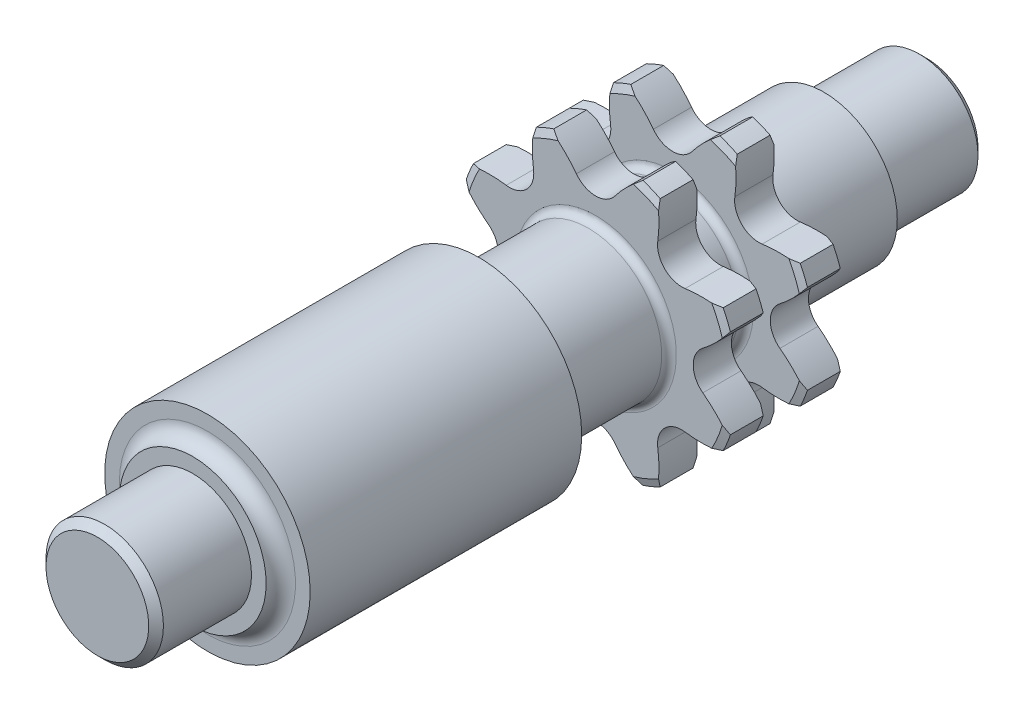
ISO-10303-21;
HEADER;
FILE_DESCRIPTION(('STEP AP214'),'2;1');
FILE_NAME('part.step','',(''),(''),'','','');
FILE_SCHEMA(('AUTOMOTIVE_DESIGN { 1 0 10303 214 1 1 1 1 }'));
ENDSEC;
DATA;
#1=APPLICATION_CONTEXT('core data for automotive mechanical design processes');
#2=APPLICATION_PROTOCOL_DEFINITION('international standard','automotive_design',2000,#1);
#3=PRODUCT_CONTEXT('',#1,'mechanical');
#4=PRODUCT('Part','Part','',(#3));
#5=PRODUCT_RELATED_PRODUCT_CATEGORY('part','',(#4));
#6=PRODUCT_DEFINITION_FORMATION('','',#4);
#7=PRODUCT_DEFINITION_CONTEXT('part definition',#1,'design');
#8=PRODUCT_DEFINITION('design','',#6,#7);
#9=PRODUCT_DEFINITION_SHAPE('','',#8);
#10=(LENGTH_UNIT() NAMED_UNIT(*) SI_UNIT(.MILLI.,.METRE.));
#11=(NAMED_UNIT(*) PLANE_ANGLE_UNIT() SI_UNIT($,.RADIAN.));
#12=(NAMED_UNIT(*) SI_UNIT($,.STERADIAN.) SOLID_ANGLE_UNIT());
#13=UNCERTAINTY_MEASURE_WITH_UNIT(LENGTH_MEASURE(1.E-05),#10,'distance_accuracy_value','');
#14=(GEOMETRIC_REPRESENTATION_CONTEXT(3) GLOBAL_UNCERTAINTY_ASSIGNED_CONTEXT((#13)) GLOBAL_UNIT_ASSIGNED_CONTEXT((#10,
#11,#12)) REPRESENTATION_CONTEXT('',''));
#15=CARTESIAN_POINT('',(0.,0.,0.));
#16=DIRECTION('',(0.,0.,1.));
#17=DIRECTION('',(1.,0.,0.));
#18=AXIS2_PLACEMENT_3D('',#15,#16,#17);
#19=CARTESIAN_POINT('',(0.,0.,17.1192341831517));
#20=DIRECTION('',(0.,0.,-1.));
#21=DIRECTION('',(-1.,0.,0.));
#22=AXIS2_PLACEMENT_3D('',#19,#20,#21);
#23=CONICAL_SURFACE('',#22,9.49665,1.22173047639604);
#24=CARTESIAN_POINT('',(0.,0.,17.3));
#25=DIRECTION('',(0.,0.,1.));
#26=DIRECTION('',(1.,0.,0.));
#27=AXIS2_PLACEMENT_3D('',#24,#25,#26);
#28=CIRCLE('',#27,9.);
#29=CARTESIAN_POINT('',(-4.28587599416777,-7.91399184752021,17.3));
#30=VERTEX_POINT('',#29);
#31=CARTESIAN_POINT('',(-2.56546532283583,-8.62660928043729,17.3));
#32=VERTEX_POINT('',#31);
#33=EDGE_CURVE('E1373',#30,#32,#28,.T.);
#34=ORIENTED_EDGE('',*,*,#33,.F.);
#35=CARTESIAN_POINT('',(-4.28592823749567,-7.91333864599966,17.3002));
#36=CARTESIAN_POINT('',(-4.27796427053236,-8.01299239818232,17.269696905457));
#37=CARTESIAN_POINT('',(-4.26820929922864,-8.11248841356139,17.2393598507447));
#38=CARTESIAN_POINT('',(-4.24511734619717,-8.31116498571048,17.1790178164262));
#39=CARTESIAN_POINT('',(-4.23178036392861,-8.41034554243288,17.1490128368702));
#40=CARTESIAN_POINT('',(-4.21665237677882,-8.50936836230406,17.119173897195));
#41=B_SPLINE_CURVE_WITH_KNOTS('',3,(#35,#36,#37,#38,#39,#40),.UNSPECIFIED.,.F.,.F.,(4,2,4),(0.,
0.313423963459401,0.626847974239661),.UNSPECIFIED.);
#42=CARTESIAN_POINT('',(-4.21668293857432,-8.50916836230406,17.1192341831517));
#43=VERTEX_POINT('',#42);
#44=EDGE_CURVE('E2665',#30,#43,#41,.T.);
#45=ORIENTED_EDGE('',*,*,#44,.T.);
#46=CARTESIAN_POINT('',(0.,0.,17.1192341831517));
#47=DIRECTION('',(0.,0.,1.));
#48=DIRECTION('',(1.,0.,0.));
#49=AXIS2_PLACEMENT_3D('',#46,#47,#48);
#50=CIRCLE('',#49,9.49665);
#51=CARTESIAN_POINT('',(-3.0352455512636,-8.99853575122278,17.1192341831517));
#52=VERTEX_POINT('',#51);
#53=EDGE_CURVE('E1369',#43,#52,#50,.T.);
#54=ORIENTED_EDGE('',*,*,#53,.T.);
#55=CARTESIAN_POINT('',(-3.03544555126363,-8.99868272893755,17.1191602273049));
#56=CARTESIAN_POINT('',(-2.95472223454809,-8.93935602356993,17.1490013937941));
#57=CARTESIAN_POINT('',(-2.87515398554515,-8.87865113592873,17.179008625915));
#58=CARTESIAN_POINT('',(-2.71832763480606,-8.75448500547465,17.2393552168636));
#59=CARTESIAN_POINT('',(-2.64106953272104,-8.69102376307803,17.269694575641));
#60=CARTESIAN_POINT('',(-2.56496649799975,-8.62618433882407,17.3002));
#61=B_SPLINE_CURVE_WITH_KNOTS('',3,(#55,#56,#57,#58,#59,#60),.UNSPECIFIED.,.F.,.F.,(4,2,4),(0.,
0.313447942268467,0.626895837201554),.UNSPECIFIED.);
#62=EDGE_CURVE('E1491',#52,#32,#61,.T.);
#63=ORIENTED_EDGE('',*,*,#62,.T.);
#64=EDGE_LOOP('',(#34,#45,#54,#63));
#65=FACE_BOUND('',#64,.T.);
#66=ADVANCED_FACE('F29',(#65),#23,.T.);
#67=CARTESIAN_POINT('',(0.,0.,22.3692341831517));
#68=DIRECTION('',(0.,0.,-1.));
#69=DIRECTION('',(-1.,0.,0.));
#70=AXIS2_PLACEMENT_3D('',#67,#68,#69);
#71=CONICAL_SURFACE('',#70,9.49665,1.22173047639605);
#72=CARTESIAN_POINT('',(0.,0.,22.55));
#73=DIRECTION('',(0.,0.,1.));
#74=DIRECTION('',(1.,0.,0.));
#75=AXIS2_PLACEMENT_3D('',#72,#73,#74);
#76=CIRCLE('',#75,9.);
#77=CARTESIAN_POINT('',(-4.28587599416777,-7.91399184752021,22.55));
#78=VERTEX_POINT('',#77);
#79=CARTESIAN_POINT('',(-2.56546532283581,-8.62660928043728,22.55));
#80=VERTEX_POINT('',#79);
#81=EDGE_CURVE('E1339',#78,#80,#76,.T.);
#82=ORIENTED_EDGE('',*,*,#81,.F.);
#83=CARTESIAN_POINT('',(-4.28592823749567,-7.91333864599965,22.5502));
#84=CARTESIAN_POINT('',(-4.27796427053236,-8.01299239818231,22.519696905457));
#85=CARTESIAN_POINT('',(-4.26820929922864,-8.11248841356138,22.4893598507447));
#86=CARTESIAN_POINT('',(-4.24511734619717,-8.31116498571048,22.4290178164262));
#87=CARTESIAN_POINT('',(-4.2317803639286,-8.41034554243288,22.3990128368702));
#88=CARTESIAN_POINT('',(-4.21665237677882,-8.50936836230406,22.369173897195));
#89=B_SPLINE_CURVE_WITH_KNOTS('',3,(#83,#84,#85,#86,#87,#88),.UNSPECIFIED.,.F.,.F.,(4,2,4),(0.,
0.313423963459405,0.626847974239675),.UNSPECIFIED.);
#90=CARTESIAN_POINT('',(-4.21668293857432,-8.50916836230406,22.3692341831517));
#91=VERTEX_POINT('',#90);
#92=EDGE_CURVE('E2678',#78,#91,#89,.T.);
#93=ORIENTED_EDGE('',*,*,#92,.T.);
#94=CARTESIAN_POINT('',(0.,0.,22.3692341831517));
#95=DIRECTION('',(0.,0.,1.));
#96=DIRECTION('',(1.,0.,0.));
#97=AXIS2_PLACEMENT_3D('',#94,#95,#96);
#98=CIRCLE('',#97,9.49665);
#99=CARTESIAN_POINT('',(-3.0352455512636,-8.99853575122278,22.3692341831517));
#100=VERTEX_POINT('',#99);
#101=EDGE_CURVE('E1335',#91,#100,#98,.T.);
#102=ORIENTED_EDGE('',*,*,#101,.T.);
#103=CARTESIAN_POINT('',(-3.03544555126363,-8.99868272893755,22.3691602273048));
#104=CARTESIAN_POINT('',(-2.95472223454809,-8.93935602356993,22.3990013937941));
#105=CARTESIAN_POINT('',(-2.87515398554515,-8.87865113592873,22.429008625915));
#106=CARTESIAN_POINT('',(-2.71832763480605,-8.75448500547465,22.4893552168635));
#107=CARTESIAN_POINT('',(-2.64106953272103,-8.69102376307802,22.519694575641));
#108=CARTESIAN_POINT('',(-2.56496649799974,-8.62618433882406,22.5502));
#109=B_SPLINE_CURVE_WITH_KNOTS('',3,(#103,#104,#105,#106,#107,#108),.UNSPECIFIED.,.F.,.F.,(4,2,
4),(0.,0.313447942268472,0.626895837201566),.UNSPECIFIED.);
#110=EDGE_CURVE('E871',#100,#80,#109,.T.);
#111=ORIENTED_EDGE('',*,*,#110,.T.);
#112=EDGE_LOOP('',(#82,#93,#102,#111));
#113=FACE_BOUND('',#112,.T.);
#114=ADVANCED_FACE('F866',(#113),#71,.T.);
#115=CARTESIAN_POINT('',(0.,0.,62.));
#116=DIRECTION('',(0.,0.,1.));
#117=DIRECTION('',(1.,0.,0.));
#118=AXIS2_PLACEMENT_3D('',#115,#116,#117);
#119=CYLINDRICAL_SURFACE('',#118,9.49665);
#120=ORIENTED_EDGE('',*,*,#101,.F.);
#121=DIRECTION('',(0.,0.,-1.));
#122=VECTOR('',#121,1.);
#123=CARTESIAN_POINT('',(-4.21668293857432,-8.50916836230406,28.620583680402));
#124=LINE('',#123,#122);
#125=CARTESIAN_POINT('',(-4.21668293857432,-8.50916836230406,20.1307658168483));
#126=VERTEX_POINT('',#125);
#127=EDGE_CURVE('E651',#91,#126,#124,.T.);
#128=ORIENTED_EDGE('',*,*,#127,.T.);
#129=CARTESIAN_POINT('',(0.,0.,20.1307658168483));
#130=DIRECTION('',(0.,0.,1.));
#131=DIRECTION('',(1.,0.,0.));
#132=AXIS2_PLACEMENT_3D('',#129,#130,#131);
#133=CIRCLE('',#132,9.49665);
#134=CARTESIAN_POINT('',(-3.0352455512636,-8.99853575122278,20.1307658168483));
#135=VERTEX_POINT('',#134);
#136=EDGE_CURVE('E1330',#126,#135,#133,.T.);
#137=ORIENTED_EDGE('',*,*,#136,.T.);
#138=DIRECTION('',(0.,0.,-1.));
#139=VECTOR('',#138,1.);
#140=CARTESIAN_POINT('',(-3.0352455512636,-8.99853575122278,29.2562181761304));
#141=LINE('',#140,#139);
#142=EDGE_CURVE('E1498',#100,#135,#141,.T.);
#143=ORIENTED_EDGE('',*,*,#142,.F.);
#144=EDGE_LOOP('',(#120,#128,#137,#143));
#145=FACE_BOUND('',#144,.T.);
#146=ADVANCED_FACE('F1663',(#145),#119,.T.);
#147=CARTESIAN_POINT('',(0.,0.,19.95));
#148=DIRECTION('',(0.,0.,1.));
#149=DIRECTION('',(1.,0.,0.));
#150=AXIS2_PLACEMENT_3D('',#147,#148,#149);
#151=CONICAL_SURFACE('',#150,9.,1.22173047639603);
#152=ORIENTED_EDGE('',*,*,#136,.F.);
#153=CARTESIAN_POINT('',(-4.21665237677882,-8.50936836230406,20.130826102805));
#154=CARTESIAN_POINT('',(-4.2317803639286,-8.41034554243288,20.1009871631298));
#155=CARTESIAN_POINT('',(-4.24511734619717,-8.31116498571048,20.0709821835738));
#156=CARTESIAN_POINT('',(-4.26820929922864,-8.11248841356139,20.0106401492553));
#157=CARTESIAN_POINT('',(-4.27796427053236,-8.01299239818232,19.980303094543));
#158=CARTESIAN_POINT('',(-4.28592823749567,-7.91333864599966,19.9498));
#159=B_SPLINE_CURVE_WITH_KNOTS('',3,(#153,#154,#155,#156,#157,#158),.UNSPECIFIED.,.F.,.F.,(4,2,
4),(0.,0.313424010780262,0.626847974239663),.UNSPECIFIED.);
#160=CARTESIAN_POINT('',(-4.28587599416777,-7.91399184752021,19.95));
#161=VERTEX_POINT('',#160);
#162=EDGE_CURVE('E2671',#126,#161,#159,.T.);
#163=ORIENTED_EDGE('',*,*,#162,.T.);
#164=CARTESIAN_POINT('',(0.,0.,19.95));
#165=DIRECTION('',(0.,0.,1.));
#166=DIRECTION('',(1.,0.,0.));
#167=AXIS2_PLACEMENT_3D('',#164,#165,#166);
#168=CIRCLE('',#167,9.);
#169=CARTESIAN_POINT('',(-2.56546532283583,-8.62660928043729,19.95));
#170=VERTEX_POINT('',#169);
#171=EDGE_CURVE('E1327',#161,#170,#168,.T.);
#172=ORIENTED_EDGE('',*,*,#171,.T.);
#173=CARTESIAN_POINT('',(-2.56496649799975,-8.62618433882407,19.9498));
#174=CARTESIAN_POINT('',(-2.64106953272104,-8.69102376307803,19.9803054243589));
#175=CARTESIAN_POINT('',(-2.71832763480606,-8.75448500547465,20.0106447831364));
#176=CARTESIAN_POINT('',(-2.87515398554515,-8.87865113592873,20.070991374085));
#177=CARTESIAN_POINT('',(-2.95472223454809,-8.93935602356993,20.1009986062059));
#178=CARTESIAN_POINT('',(-3.03544555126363,-8.99868272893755,20.1308397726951));
#179=B_SPLINE_CURVE_WITH_KNOTS('',3,(#173,#174,#175,#176,#177,#178),.UNSPECIFIED.,.F.,.F.,(4,2,
4),(0.,0.313447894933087,0.626895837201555),.UNSPECIFIED.);
#180=EDGE_CURVE('E990',#170,#135,#179,.T.);
#181=ORIENTED_EDGE('',*,*,#180,.T.);
#182=EDGE_LOOP('',(#152,#163,#172,#181));
#183=FACE_BOUND('',#182,.T.);
#184=ADVANCED_FACE('F984',(#183),#151,.T.);
#185=CARTESIAN_POINT('',(0.,0.,62.));
#186=DIRECTION('',(0.,0.,1.));
#187=DIRECTION('',(1.,0.,0.));
#188=AXIS2_PLACEMENT_3D('',#185,#186,#187);
#189=CYLINDRICAL_SURFACE('',#188,9.49665);
#190=ORIENTED_EDGE('',*,*,#53,.F.);
#191=CARTESIAN_POINT('',(-4.21668293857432,-8.50916836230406,14.8807658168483));
#192=VERTEX_POINT('',#191);
#193=EDGE_CURVE('E648',#43,#192,#124,.T.);
#194=ORIENTED_EDGE('',*,*,#193,.T.);
#195=CARTESIAN_POINT('',(0.,0.,14.8807658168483));
#196=DIRECTION('',(0.,0.,1.));
#197=DIRECTION('',(1.,0.,0.));
#198=AXIS2_PLACEMENT_3D('',#195,#196,#197);
#199=CIRCLE('',#198,9.49665);
#200=CARTESIAN_POINT('',(-3.0352455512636,-8.99853575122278,14.8807658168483));
#201=VERTEX_POINT('',#200);
#202=EDGE_CURVE('E1365',#192,#201,#199,.T.);
#203=ORIENTED_EDGE('',*,*,#202,.T.);
#204=EDGE_CURVE('E1495',#52,#201,#141,.T.);
#205=ORIENTED_EDGE('',*,*,#204,.F.);
#206=EDGE_LOOP('',(#190,#194,#203,#205));
#207=FACE_BOUND('',#206,.T.);
#208=ADVANCED_FACE('F1674',(#207),#189,.T.);
#209=CARTESIAN_POINT('',(0.,0.,14.7));
#210=DIRECTION('',(0.,0.,1.));
#211=DIRECTION('',(1.,0.,0.));
#212=AXIS2_PLACEMENT_3D('',#209,#210,#211);
#213=CONICAL_SURFACE('',#212,9.,1.22173047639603);
#214=ORIENTED_EDGE('',*,*,#202,.F.);
#215=CARTESIAN_POINT('',(-4.21665237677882,-8.50936836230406,14.880826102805));
#216=CARTESIAN_POINT('',(-4.2317803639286,-8.41034554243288,14.8509871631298));
#217=CARTESIAN_POINT('',(-4.24511734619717,-8.31116498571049,14.8209821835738));
#218=CARTESIAN_POINT('',(-4.26820929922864,-8.11248841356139,14.7606401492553));
#219=CARTESIAN_POINT('',(-4.27796427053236,-8.01299239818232,14.730303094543));
#220=CARTESIAN_POINT('',(-4.28592823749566,-7.91333864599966,14.6998));
#221=B_SPLINE_CURVE_WITH_KNOTS('',3,(#215,#216,#217,#218,#219,#220),.UNSPECIFIED.,.F.,.F.,(4,2,
4),(0.,0.313424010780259,0.626847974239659),.UNSPECIFIED.);
#222=CARTESIAN_POINT('',(-4.28587599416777,-7.91399184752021,14.7));
#223=VERTEX_POINT('',#222);
#224=EDGE_CURVE('E1767',#192,#223,#221,.T.);
#225=ORIENTED_EDGE('',*,*,#224,.T.);
#226=CARTESIAN_POINT('',(0.,0.,14.7));
#227=DIRECTION('',(0.,0.,1.));
#228=DIRECTION('',(1.,0.,0.));
#229=AXIS2_PLACEMENT_3D('',#226,#227,#228);
#230=CIRCLE('',#229,9.);
#231=CARTESIAN_POINT('',(-2.56546532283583,-8.62660928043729,14.7));
#232=VERTEX_POINT('',#231);
#233=EDGE_CURVE('E1362',#223,#232,#230,.T.);
#234=ORIENTED_EDGE('',*,*,#233,.T.);
#235=CARTESIAN_POINT('',(-2.56496649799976,-8.62618433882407,14.6998));
#236=CARTESIAN_POINT('',(-2.64106953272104,-8.69102376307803,14.730305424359));
#237=CARTESIAN_POINT('',(-2.71832763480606,-8.75448500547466,14.7606447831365));
#238=CARTESIAN_POINT('',(-2.87515398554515,-8.87865113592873,14.820991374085));
#239=CARTESIAN_POINT('',(-2.95472223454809,-8.93935602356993,14.8509986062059));
#240=CARTESIAN_POINT('',(-3.03544555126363,-8.99868272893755,14.8808397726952));
#241=B_SPLINE_CURVE_WITH_KNOTS('',3,(#235,#236,#237,#238,#239,#240),.UNSPECIFIED.,.F.,.F.,(4,2,
4),(0.,0.313447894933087,0.62689583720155),.UNSPECIFIED.);
#242=EDGE_CURVE('E720',#232,#201,#241,.T.);
#243=ORIENTED_EDGE('',*,*,#242,.T.);
#244=EDGE_LOOP('',(#214,#225,#234,#243));
#245=FACE_BOUND('',#244,.T.);
#246=ADVANCED_FACE('F714',(#245),#213,.T.);
#247=CARTESIAN_POINT('',(-8.99853575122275,-3.03524555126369,17.1192341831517));
#248=VERTEX_POINT('',#247);
#249=CARTESIAN_POINT('',(-8.50916836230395,-4.21668293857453,17.1192341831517));
#250=VERTEX_POINT('',#249);
#251=EDGE_CURVE('E1745',#248,#250,#50,.T.);
#252=ORIENTED_EDGE('',*,*,#251,.T.);
#253=CARTESIAN_POINT('',(-8.50936836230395,-4.21665237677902,17.119173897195));
#254=CARTESIAN_POINT('',(-8.41034554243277,-4.23178036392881,17.1490128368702));
#255=CARTESIAN_POINT('',(-8.31116498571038,-4.24511734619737,17.1790178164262));
#256=CARTESIAN_POINT('',(-8.11248841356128,-4.26820929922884,17.2393598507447));
#257=CARTESIAN_POINT('',(-8.01299239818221,-4.27796427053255,17.269696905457));
#258=CARTESIAN_POINT('',(-7.91333864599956,-4.28592823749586,17.3002));
#259=B_SPLINE_CURVE_WITH_KNOTS('',3,(#253,#254,#255,#256,#257,#258),.UNSPECIFIED.,.F.,.F.,(4,2,
4),(0.,0.313424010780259,0.626847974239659),.UNSPECIFIED.);
#260=CARTESIAN_POINT('',(-7.91399184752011,-4.28587599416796,17.3));
#261=VERTEX_POINT('',#260);
#262=EDGE_CURVE('E662',#250,#261,#259,.T.);
#263=ORIENTED_EDGE('',*,*,#262,.T.);
#264=CARTESIAN_POINT('',(-8.62660928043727,-2.56546532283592,17.3));
#265=VERTEX_POINT('',#264);
#266=EDGE_CURVE('E1595',#265,#261,#28,.T.);
#267=ORIENTED_EDGE('',*,*,#266,.F.);
#268=CARTESIAN_POINT('',(-8.62618433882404,-2.56496649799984,17.3002));
#269=CARTESIAN_POINT('',(-8.691023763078,-2.64106953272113,17.269694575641));
#270=CARTESIAN_POINT('',(-8.75448500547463,-2.71832763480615,17.2393552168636));
#271=CARTESIAN_POINT('',(-8.8786511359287,-2.87515398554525,17.179008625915));
#272=CARTESIAN_POINT('',(-8.9393560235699,-2.95472223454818,17.1490013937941));
#273=CARTESIAN_POINT('',(-8.99868272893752,-3.03544555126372,17.1191602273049));
#274=B_SPLINE_CURVE_WITH_KNOTS('',3,(#268,#269,#270,#271,#272,#273),.UNSPECIFIED.,.F.,.F.,(4,2,
4),(0.,0.313447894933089,0.626895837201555),.UNSPECIFIED.);
#275=EDGE_CURVE('E1750',#265,#248,#274,.T.);
#276=ORIENTED_EDGE('',*,*,#275,.T.);
#277=EDGE_LOOP('',(#252,#263,#267,#276));
#278=FACE_BOUND('',#277,.T.);
#279=ADVANCED_FACE('F1659',(#278),#23,.T.);
#280=CARTESIAN_POINT('',(-8.99853575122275,-3.03524555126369,22.3692341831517));
#281=VERTEX_POINT('',#280);
#282=CARTESIAN_POINT('',(-8.50916836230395,-4.21668293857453,22.3692341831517));
#283=VERTEX_POINT('',#282);
#284=EDGE_CURVE('E2898',#281,#283,#98,.T.);
#285=ORIENTED_EDGE('',*,*,#284,.T.);
#286=CARTESIAN_POINT('',(-8.50936836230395,-4.21665237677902,22.369173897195));
#287=CARTESIAN_POINT('',(-8.41034554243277,-4.23178036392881,22.3990128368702));
#288=CARTESIAN_POINT('',(-8.31116498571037,-4.24511734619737,22.4290178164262));
#289=CARTESIAN_POINT('',(-8.11248841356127,-4.26820929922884,22.4893598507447));
#290=CARTESIAN_POINT('',(-8.0129923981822,-4.27796427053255,22.519696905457));
#291=CARTESIAN_POINT('',(-7.91333864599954,-4.28592823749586,22.5502));
#292=B_SPLINE_CURVE_WITH_KNOTS('',3,(#286,#287,#288,#289,#290,#291),.UNSPECIFIED.,.F.,.F.,(4,2,
4),(0.,0.313424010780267,0.626847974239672),.UNSPECIFIED.);
#293=CARTESIAN_POINT('',(-7.91399184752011,-4.28587599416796,22.55));
#294=VERTEX_POINT('',#293);
#295=EDGE_CURVE('E702',#283,#294,#292,.T.);
#296=ORIENTED_EDGE('',*,*,#295,.T.);
#297=CARTESIAN_POINT('',(-8.62660928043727,-2.56546532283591,22.55));
#298=VERTEX_POINT('',#297);
#299=EDGE_CURVE('E1455',#298,#294,#76,.T.);
#300=ORIENTED_EDGE('',*,*,#299,.F.);
#301=CARTESIAN_POINT('',(-8.62618433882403,-2.56496649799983,22.5502));
#302=CARTESIAN_POINT('',(-8.69102376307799,-2.64106953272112,22.519694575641));
#303=CARTESIAN_POINT('',(-8.75448500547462,-2.71832763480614,22.4893552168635));
#304=CARTESIAN_POINT('',(-8.8786511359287,-2.87515398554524,22.429008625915));
#305=CARTESIAN_POINT('',(-8.9393560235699,-2.95472223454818,22.3990013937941));
#306=CARTESIAN_POINT('',(-8.99868272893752,-3.03544555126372,22.3691602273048));
#307=B_SPLINE_CURVE_WITH_KNOTS('',3,(#301,#302,#303,#304,#305,#306),.UNSPECIFIED.,.F.,.F.,(4,2,
4),(0.,0.313447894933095,0.626895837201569),.UNSPECIFIED.);
#308=EDGE_CURVE('E845',#298,#281,#307,.T.);
#309=ORIENTED_EDGE('',*,*,#308,.T.);
#310=EDGE_LOOP('',(#285,#296,#300,#309));
#311=FACE_BOUND('',#310,.T.);
#312=ADVANCED_FACE('F1465',(#311),#71,.T.);
#313=CARTESIAN_POINT('',(-8.99853575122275,-3.03524555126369,20.1307658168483));
#314=VERTEX_POINT('',#313);
#315=CARTESIAN_POINT('',(-8.50916836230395,-4.21668293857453,20.1307658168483));
#316=VERTEX_POINT('',#315);
#317=EDGE_CURVE('E1777',#314,#316,#133,.T.);
#318=ORIENTED_EDGE('',*,*,#317,.T.);
#319=DIRECTION('',(0.,0.,-1.));
#320=VECTOR('',#319,1.);
#321=CARTESIAN_POINT('',(-8.50916836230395,-4.21668293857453,28.620583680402));
#322=LINE('',#321,#320);
#323=EDGE_CURVE('E638',#283,#316,#322,.T.);
#324=ORIENTED_EDGE('',*,*,#323,.F.);
#325=ORIENTED_EDGE('',*,*,#284,.F.);
#326=DIRECTION('',(0.,0.,-1.));
#327=VECTOR('',#326,1.);
#328=CARTESIAN_POINT('',(-8.99853575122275,-3.03524555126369,29.2562181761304));
#329=LINE('',#328,#327);
#330=EDGE_CURVE('E2690',#281,#314,#329,.T.);
#331=ORIENTED_EDGE('',*,*,#330,.T.);
#332=EDGE_LOOP('',(#318,#324,#325,#331));
#333=FACE_BOUND('',#332,.T.);
#334=ADVANCED_FACE('F1840',(#333),#119,.T.);
#335=CARTESIAN_POINT('',(-8.62660928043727,-2.56546532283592,19.95));
#336=VERTEX_POINT('',#335);
#337=CARTESIAN_POINT('',(-7.91399184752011,-4.28587599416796,19.95));
#338=VERTEX_POINT('',#337);
#339=EDGE_CURVE('E2717',#336,#338,#168,.T.);
#340=ORIENTED_EDGE('',*,*,#339,.T.);
#341=CARTESIAN_POINT('',(-7.91333864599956,-4.28592823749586,19.9498));
#342=CARTESIAN_POINT('',(-8.01299239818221,-4.27796427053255,19.980303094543));
#343=CARTESIAN_POINT('',(-8.11248841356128,-4.26820929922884,20.0106401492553));
#344=CARTESIAN_POINT('',(-8.31116498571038,-4.24511734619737,20.0709821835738));
#345=CARTESIAN_POINT('',(-8.41034554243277,-4.23178036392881,20.1009871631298));
#346=CARTESIAN_POINT('',(-8.50936836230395,-4.21665237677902,20.130826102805));
#347=B_SPLINE_CURVE_WITH_KNOTS('',3,(#341,#342,#343,#344,#345,#346),.UNSPECIFIED.,.F.,.F.,(4,2,
4),(0.,0.3134239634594,0.626847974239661),.UNSPECIFIED.);
#348=EDGE_CURVE('E692',#338,#316,#347,.T.);
#349=ORIENTED_EDGE('',*,*,#348,.T.);
#350=ORIENTED_EDGE('',*,*,#317,.F.);
#351=CARTESIAN_POINT('',(-8.99868272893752,-3.03544555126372,20.1308397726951));
#352=CARTESIAN_POINT('',(-8.9393560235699,-2.95472223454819,20.1009986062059));
#353=CARTESIAN_POINT('',(-8.8786511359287,-2.87515398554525,20.070991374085));
#354=CARTESIAN_POINT('',(-8.75448500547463,-2.71832763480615,20.0106447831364));
#355=CARTESIAN_POINT('',(-8.691023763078,-2.64106953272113,19.9803054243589));
#356=CARTESIAN_POINT('',(-8.62618433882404,-2.56496649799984,19.9498));
#357=B_SPLINE_CURVE_WITH_KNOTS('',3,(#351,#352,#353,#354,#355,#356),.UNSPECIFIED.,.F.,.F.,(4,2,
4),(0.,0.313447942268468,0.626895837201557),.UNSPECIFIED.);
#358=EDGE_CURVE('E846',#314,#336,#357,.T.);
#359=ORIENTED_EDGE('',*,*,#358,.T.);
#360=EDGE_LOOP('',(#340,#349,#350,#359));
#361=FACE_BOUND('',#360,.T.);
#362=ADVANCED_FACE('F1836',(#361),#151,.T.);
#363=CARTESIAN_POINT('',(-8.99853575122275,-3.03524555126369,14.8807658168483));
#364=VERTEX_POINT('',#363);
#365=CARTESIAN_POINT('',(-8.50916836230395,-4.21668293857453,14.8807658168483));
#366=VERTEX_POINT('',#365);
#367=EDGE_CURVE('E1757',#364,#366,#199,.T.);
#368=ORIENTED_EDGE('',*,*,#367,.T.);
#369=EDGE_CURVE('E644',#250,#366,#322,.T.);
#370=ORIENTED_EDGE('',*,*,#369,.F.);
#371=ORIENTED_EDGE('',*,*,#251,.F.);
#372=EDGE_CURVE('E1755',#248,#364,#329,.T.);
#373=ORIENTED_EDGE('',*,*,#372,.T.);
#374=EDGE_LOOP('',(#368,#370,#371,#373));
#375=FACE_BOUND('',#374,.T.);
#376=ADVANCED_FACE('F1727',(#375),#189,.T.);
#377=CARTESIAN_POINT('',(-8.62660928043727,-2.56546532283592,14.7));
#378=VERTEX_POINT('',#377);
#379=CARTESIAN_POINT('',(-7.91399184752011,-4.28587599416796,14.7));
#380=VERTEX_POINT('',#379);
#381=EDGE_CURVE('E1758',#378,#380,#230,.T.);
#382=ORIENTED_EDGE('',*,*,#381,.T.);
#383=CARTESIAN_POINT('',(-7.91333864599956,-4.28592823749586,14.6998));
#384=CARTESIAN_POINT('',(-8.01299239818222,-4.27796427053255,14.730303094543));
#385=CARTESIAN_POINT('',(-8.11248841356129,-4.26820929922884,14.7606401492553));
#386=CARTESIAN_POINT('',(-8.31116498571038,-4.24511734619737,14.8209821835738));
#387=CARTESIAN_POINT('',(-8.41034554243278,-4.23178036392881,14.8509871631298));
#388=CARTESIAN_POINT('',(-8.50936836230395,-4.21665237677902,14.880826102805));
#389=B_SPLINE_CURVE_WITH_KNOTS('',3,(#383,#384,#385,#386,#387,#388),.UNSPECIFIED.,.F.,.F.,(4,2,
4),(0.,0.313423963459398,0.626847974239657),.UNSPECIFIED.);
#390=EDGE_CURVE('E44',#380,#366,#389,.T.);
#391=ORIENTED_EDGE('',*,*,#390,.T.);
#392=ORIENTED_EDGE('',*,*,#367,.F.);
#393=CARTESIAN_POINT('',(-8.99868272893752,-3.03544555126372,14.8808397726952));
#394=CARTESIAN_POINT('',(-8.9393560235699,-2.95472223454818,14.8509986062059));
#395=CARTESIAN_POINT('',(-8.8786511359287,-2.87515398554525,14.820991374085));
#396=CARTESIAN_POINT('',(-8.75448500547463,-2.71832763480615,14.7606447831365));
#397=CARTESIAN_POINT('',(-8.691023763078,-2.64106953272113,14.730305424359));
#398=CARTESIAN_POINT('',(-8.62618433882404,-2.56496649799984,14.6998));
#399=B_SPLINE_CURVE_WITH_KNOTS('',3,(#393,#394,#395,#396,#397,#398),.UNSPECIFIED.,.F.,.F.,(4,2,
4),(0.,0.313447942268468,0.626895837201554),.UNSPECIFIED.);
#400=EDGE_CURVE('E838',#364,#378,#399,.T.);
#401=ORIENTED_EDGE('',*,*,#400,.T.);
#402=EDGE_LOOP('',(#382,#391,#392,#401));
#403=FACE_BOUND('',#402,.T.);
#404=ADVANCED_FACE('F1730',(#403),#213,.T.);
#405=CARTESIAN_POINT('',(-8.50916836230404,4.21668293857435,17.1192341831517));
#406=VERTEX_POINT('',#405);
#407=CARTESIAN_POINT('',(-8.99853575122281,3.0352455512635,17.1192341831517));
#408=VERTEX_POINT('',#407);
#409=EDGE_CURVE('E1741',#406,#408,#50,.T.);
#410=ORIENTED_EDGE('',*,*,#409,.T.);
#411=CARTESIAN_POINT('',(-8.99868272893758,3.03544555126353,17.1191602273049));
#412=CARTESIAN_POINT('',(-8.93935602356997,2.954722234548,17.1490013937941));
#413=CARTESIAN_POINT('',(-8.87865113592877,2.87515398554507,17.179008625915));
#414=CARTESIAN_POINT('',(-8.7544850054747,2.71832763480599,17.2393552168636));
#415=CARTESIAN_POINT('',(-8.69102376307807,2.64106953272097,17.269694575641));
#416=CARTESIAN_POINT('',(-8.62618433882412,2.56496649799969,17.3002));
#417=B_SPLINE_CURVE_WITH_KNOTS('',3,(#411,#412,#413,#414,#415,#416),.UNSPECIFIED.,.F.,.F.,(4,2,
4),(0.,0.313447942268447,0.626895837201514),.UNSPECIFIED.);
#418=CARTESIAN_POINT('',(-8.62660928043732,2.56546532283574,17.3));
#419=VERTEX_POINT('',#418);
#420=EDGE_CURVE('E965',#408,#419,#417,.T.);
#421=ORIENTED_EDGE('',*,*,#420,.T.);
#422=CARTESIAN_POINT('',(-7.9139918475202,4.2858759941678,17.3));
#423=VERTEX_POINT('',#422);
#424=EDGE_CURVE('E1591',#423,#419,#28,.T.);
#425=ORIENTED_EDGE('',*,*,#424,.F.);
#426=CARTESIAN_POINT('',(-7.91333864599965,4.28592823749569,17.3002));
#427=CARTESIAN_POINT('',(-8.0129923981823,4.27796427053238,17.269696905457));
#428=CARTESIAN_POINT('',(-8.11248841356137,4.26820929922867,17.2393598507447));
#429=CARTESIAN_POINT('',(-8.31116498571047,4.2451173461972,17.1790178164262));
#430=CARTESIAN_POINT('',(-8.41034554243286,4.23178036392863,17.1490128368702));
#431=CARTESIAN_POINT('',(-8.50936836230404,4.21665237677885,17.119173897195));
#432=B_SPLINE_CURVE_WITH_KNOTS('',3,(#426,#427,#428,#429,#430,#431),.UNSPECIFIED.,.F.,.F.,(4,2,
4),(0.,0.313423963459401,0.626847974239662),.UNSPECIFIED.);
#433=EDGE_CURVE('E1069',#423,#406,#432,.T.);
#434=ORIENTED_EDGE('',*,*,#433,.T.);
#435=EDGE_LOOP('',(#410,#421,#425,#434));
#436=FACE_BOUND('',#435,.T.);
#437=ADVANCED_FACE('F1666',(#436),#23,.T.);
#438=CARTESIAN_POINT('',(-2.56546532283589,8.62660928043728,14.7));
#439=VERTEX_POINT('',#438);
#440=CARTESIAN_POINT('',(-4.28587599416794,7.91399184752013,14.7));
#441=VERTEX_POINT('',#440);
#442=EDGE_CURVE('E1762',#439,#441,#230,.T.);
#443=ORIENTED_EDGE('',*,*,#442,.T.);
#444=CARTESIAN_POINT('',(-4.28592823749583,7.91333864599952,14.6998));
#445=CARTESIAN_POINT('',(-4.27796427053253,8.01299239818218,14.730303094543));
#446=CARTESIAN_POINT('',(-4.26820929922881,8.11248841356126,14.7606401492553));
#447=CARTESIAN_POINT('',(-4.24511734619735,8.31116498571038,14.8209821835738));
#448=CARTESIAN_POINT('',(-4.23178036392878,8.41034554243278,14.8509871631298));
#449=CARTESIAN_POINT('',(-4.21665237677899,8.50936836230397,14.880826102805));
#450=B_SPLINE_CURVE_WITH_KNOTS('',3,(#444,#445,#446,#447,#448,#449),.UNSPECIFIED.,.F.,.F.,(4,2,
4),(0.,0.313423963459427,0.626847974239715),.UNSPECIFIED.);
#451=CARTESIAN_POINT('',(-4.2166829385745,8.50916836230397,14.8807658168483));
#452=VERTEX_POINT('',#451);
#453=EDGE_CURVE('E812',#441,#452,#450,.T.);
#454=ORIENTED_EDGE('',*,*,#453,.T.);
#455=CARTESIAN_POINT('',(-3.03524555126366,8.99853575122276,14.8807658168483));
#456=VERTEX_POINT('',#455);
#457=EDGE_CURVE('E2727',#456,#452,#199,.T.);
#458=ORIENTED_EDGE('',*,*,#457,.F.);
#459=CARTESIAN_POINT('',(-3.03544555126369,8.99868272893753,14.8808397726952));
#460=CARTESIAN_POINT('',(-2.95472223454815,8.93935602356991,14.8509986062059));
#461=CARTESIAN_POINT('',(-2.87515398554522,8.87865113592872,14.820991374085));
#462=CARTESIAN_POINT('',(-2.71832763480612,8.75448500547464,14.7606447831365));
#463=CARTESIAN_POINT('',(-2.6410695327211,8.69102376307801,14.730305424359));
#464=CARTESIAN_POINT('',(-2.56496649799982,8.62618433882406,14.6998));
#465=B_SPLINE_CURVE_WITH_KNOTS('',3,(#459,#460,#461,#462,#463,#464),.UNSPECIFIED.,.F.,.F.,(4,2,
4),(0.,0.313447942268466,0.626895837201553),.UNSPECIFIED.);
#466=EDGE_CURVE('E803',#456,#439,#465,.T.);
#467=ORIENTED_EDGE('',*,*,#466,.T.);
#468=EDGE_LOOP('',(#443,#454,#458,#467));
#469=FACE_BOUND('',#468,.T.);
#470=ADVANCED_FACE('F1724',(#469),#213,.T.);
#471=CARTESIAN_POINT('',(-8.50916836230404,4.21668293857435,22.3692341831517));
#472=VERTEX_POINT('',#471);
#473=CARTESIAN_POINT('',(-8.99853575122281,3.0352455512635,22.3692341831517));
#474=VERTEX_POINT('',#473);
#475=EDGE_CURVE('E2791',#472,#474,#98,.T.);
#476=ORIENTED_EDGE('',*,*,#475,.T.);
#477=CARTESIAN_POINT('',(-8.99868272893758,3.03544555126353,22.3691602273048));
#478=CARTESIAN_POINT('',(-8.93935602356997,2.954722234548,22.3990013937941));
#479=CARTESIAN_POINT('',(-8.87865113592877,2.87515398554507,22.429008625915));
#480=CARTESIAN_POINT('',(-8.7544850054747,2.71832763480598,22.4893552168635));
#481=CARTESIAN_POINT('',(-8.69102376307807,2.64106953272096,22.519694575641));
#482=CARTESIAN_POINT('',(-8.62618433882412,2.56496649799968,22.5502));
#483=B_SPLINE_CURVE_WITH_KNOTS('',3,(#477,#478,#479,#480,#481,#482),.UNSPECIFIED.,.F.,.F.,(4,2,
4),(0.,0.31344794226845,0.626895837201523),.UNSPECIFIED.);
#484=CARTESIAN_POINT('',(-8.62660928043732,2.56546532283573,22.55));
#485=VERTEX_POINT('',#484);
#486=EDGE_CURVE('E945',#474,#485,#483,.T.);
#487=ORIENTED_EDGE('',*,*,#486,.T.);
#488=CARTESIAN_POINT('',(-7.9139918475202,4.2858759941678,22.55));
#489=VERTEX_POINT('',#488);
#490=EDGE_CURVE('E1467',#489,#485,#76,.T.);
#491=ORIENTED_EDGE('',*,*,#490,.F.);
#492=CARTESIAN_POINT('',(-7.91333864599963,4.28592823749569,22.5502));
#493=CARTESIAN_POINT('',(-8.01299239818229,4.27796427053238,22.519696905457));
#494=CARTESIAN_POINT('',(-8.11248841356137,4.26820929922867,22.4893598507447));
#495=CARTESIAN_POINT('',(-8.31116498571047,4.2451173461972,22.4290178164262));
#496=CARTESIAN_POINT('',(-8.41034554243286,4.23178036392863,22.3990128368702));
#497=CARTESIAN_POINT('',(-8.50936836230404,4.21665237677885,22.369173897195));
#498=B_SPLINE_CURVE_WITH_KNOTS('',3,(#492,#493,#494,#495,#496,#497),.UNSPECIFIED.,.F.,.F.,(4,2,
4),(0.,0.313423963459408,0.626847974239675),.UNSPECIFIED.);
#499=EDGE_CURVE('E939',#489,#472,#498,.T.);
#500=ORIENTED_EDGE('',*,*,#499,.T.);
#501=EDGE_LOOP('',(#476,#487,#491,#500));
#502=FACE_BOUND('',#501,.T.);
#503=ADVANCED_FACE('F1736',(#502),#71,.T.);
#504=CARTESIAN_POINT('',(-8.50916836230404,4.21668293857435,20.1307658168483));
#505=VERTEX_POINT('',#504);
#506=CARTESIAN_POINT('',(-8.99853575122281,3.0352455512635,20.1307658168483));
#507=VERTEX_POINT('',#506);
#508=EDGE_CURVE('E1779',#505,#507,#133,.T.);
#509=ORIENTED_EDGE('',*,*,#508,.T.);
#510=DIRECTION('',(0.,0.,-1.));
#511=VECTOR('',#510,1.);
#512=CARTESIAN_POINT('',(-8.99853575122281,3.0352455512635,29.2562181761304));
#513=LINE('',#512,#511);
#514=EDGE_CURVE('E2707',#474,#507,#513,.T.);
#515=ORIENTED_EDGE('',*,*,#514,.F.);
#516=ORIENTED_EDGE('',*,*,#475,.F.);
#517=DIRECTION('',(0.,0.,-1.));
#518=VECTOR('',#517,1.);
#519=CARTESIAN_POINT('',(-8.50916836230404,4.21668293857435,28.620583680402));
#520=LINE('',#519,#518);
#521=EDGE_CURVE('E2774',#472,#505,#520,.T.);
#522=ORIENTED_EDGE('',*,*,#521,.T.);
#523=EDGE_LOOP('',(#509,#515,#516,#522));
#524=FACE_BOUND('',#523,.T.);
#525=ADVANCED_FACE('F1833',(#524),#119,.T.);
#526=CARTESIAN_POINT('',(-7.9139918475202,4.2858759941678,19.95));
#527=VERTEX_POINT('',#526);
#528=CARTESIAN_POINT('',(-8.62660928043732,2.56546532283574,19.95));
#529=VERTEX_POINT('',#528);
#530=EDGE_CURVE('E2713',#527,#529,#168,.T.);
#531=ORIENTED_EDGE('',*,*,#530,.T.);
#532=CARTESIAN_POINT('',(-8.62618433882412,2.56496649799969,19.9498));
#533=CARTESIAN_POINT('',(-8.69102376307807,2.64106953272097,19.980305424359));
#534=CARTESIAN_POINT('',(-8.7544850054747,2.71832763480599,20.0106447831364));
#535=CARTESIAN_POINT('',(-8.87865113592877,2.87515398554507,20.070991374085));
#536=CARTESIAN_POINT('',(-8.93935602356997,2.954722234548,20.1009986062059));
#537=CARTESIAN_POINT('',(-8.99868272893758,3.03544555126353,20.1308397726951));
#538=B_SPLINE_CURVE_WITH_KNOTS('',3,(#532,#533,#534,#535,#536,#537),.UNSPECIFIED.,.F.,.F.,(4,2,
4),(0.,0.313447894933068,0.626895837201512),.UNSPECIFIED.);
#539=EDGE_CURVE('E972',#529,#507,#538,.T.);
#540=ORIENTED_EDGE('',*,*,#539,.T.);
#541=ORIENTED_EDGE('',*,*,#508,.F.);
#542=CARTESIAN_POINT('',(-8.50936836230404,4.21665237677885,20.130826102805));
#543=CARTESIAN_POINT('',(-8.41034554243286,4.23178036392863,20.1009871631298));
#544=CARTESIAN_POINT('',(-8.31116498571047,4.2451173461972,20.0709821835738));
#545=CARTESIAN_POINT('',(-8.11248841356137,4.26820929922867,20.0106401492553));
#546=CARTESIAN_POINT('',(-8.0129923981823,4.27796427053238,19.980303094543));
#547=CARTESIAN_POINT('',(-7.91333864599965,4.28592823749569,19.9498));
#548=B_SPLINE_CURVE_WITH_KNOTS('',3,(#542,#543,#544,#545,#546,#547),.UNSPECIFIED.,.F.,.F.,(4,2,
4),(0.,0.313424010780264,0.626847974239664),.UNSPECIFIED.);
#549=EDGE_CURVE('E1059',#505,#527,#548,.T.);
#550=ORIENTED_EDGE('',*,*,#549,.T.);
#551=EDGE_LOOP('',(#531,#540,#541,#550));
#552=FACE_BOUND('',#551,.T.);
#553=ADVANCED_FACE('F1725',(#552),#151,.T.);
#554=CARTESIAN_POINT('',(-8.50916836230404,4.21668293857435,14.8807658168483));
#555=VERTEX_POINT('',#554);
#556=CARTESIAN_POINT('',(-8.99853575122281,3.0352455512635,14.8807658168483));
#557=VERTEX_POINT('',#556);
#558=EDGE_CURVE('E2725',#555,#557,#199,.T.);
#559=ORIENTED_EDGE('',*,*,#558,.T.);
#560=EDGE_CURVE('E2697',#408,#557,#513,.T.);
#561=ORIENTED_EDGE('',*,*,#560,.F.);
#562=ORIENTED_EDGE('',*,*,#409,.F.);
#563=EDGE_CURVE('E2772',#406,#555,#520,.T.);
#564=ORIENTED_EDGE('',*,*,#563,.T.);
#565=EDGE_LOOP('',(#559,#561,#562,#564));
#566=FACE_BOUND('',#565,.T.);
#567=ADVANCED_FACE('F1714',(#566),#189,.T.);
#568=CARTESIAN_POINT('',(-3.03524555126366,8.99853575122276,17.1192341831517));
#569=VERTEX_POINT('',#568);
#570=CARTESIAN_POINT('',(-4.2166829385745,8.50916836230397,17.1192341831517));
#571=VERTEX_POINT('',#570);
#572=EDGE_CURVE('E1744',#569,#571,#50,.T.);
#573=ORIENTED_EDGE('',*,*,#572,.T.);
#574=CARTESIAN_POINT('',(-4.216652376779,8.50936836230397,17.119173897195));
#575=CARTESIAN_POINT('',(-4.23178036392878,8.41034554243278,17.1490128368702));
#576=CARTESIAN_POINT('',(-4.24511734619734,8.31116498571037,17.1790178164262));
#577=CARTESIAN_POINT('',(-4.26820929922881,8.11248841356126,17.2393598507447));
#578=CARTESIAN_POINT('',(-4.27796427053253,8.01299239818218,17.2696969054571));
#579=CARTESIAN_POINT('',(-4.28592823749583,7.91333864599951,17.3002000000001));
#580=B_SPLINE_CURVE_WITH_KNOTS('',3,(#574,#575,#576,#577,#578,#579),.UNSPECIFIED.,.F.,.F.,(4,2,
4),(0.,0.31342401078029,0.626847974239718),.UNSPECIFIED.);
#581=CARTESIAN_POINT('',(-4.28587599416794,7.91399184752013,17.3));
#582=VERTEX_POINT('',#581);
#583=EDGE_CURVE('E1097',#571,#582,#580,.T.);
#584=ORIENTED_EDGE('',*,*,#583,.T.);
#585=CARTESIAN_POINT('',(-2.56546532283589,8.62660928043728,17.3));
#586=VERTEX_POINT('',#585);
#587=EDGE_CURVE('E1586',#586,#582,#28,.T.);
#588=ORIENTED_EDGE('',*,*,#587,.F.);
#589=CARTESIAN_POINT('',(-2.56496649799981,8.62618433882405,17.3002));
#590=CARTESIAN_POINT('',(-2.6410695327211,8.69102376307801,17.269694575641));
#591=CARTESIAN_POINT('',(-2.71832763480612,8.75448500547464,17.2393552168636));
#592=CARTESIAN_POINT('',(-2.87515398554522,8.87865113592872,17.179008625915));
#593=CARTESIAN_POINT('',(-2.95472223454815,8.93935602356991,17.1490013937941));
#594=CARTESIAN_POINT('',(-3.03544555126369,8.99868272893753,17.1191602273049));
#595=B_SPLINE_CURVE_WITH_KNOTS('',3,(#589,#590,#591,#592,#593,#594),.UNSPECIFIED.,.F.,.F.,(4,2,
4),(0.,0.313447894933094,0.626895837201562),.UNSPECIFIED.);
#596=EDGE_CURVE('E1128',#586,#569,#595,.T.);
#597=ORIENTED_EDGE('',*,*,#596,.T.);
#598=EDGE_LOOP('',(#573,#584,#588,#597));
#599=FACE_BOUND('',#598,.T.);
#600=ADVANCED_FACE('F1704',(#599),#23,.T.);
#601=CARTESIAN_POINT('',(-7.9139918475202,4.2858759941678,14.7));
#602=VERTEX_POINT('',#601);
#603=CARTESIAN_POINT('',(-8.62660928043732,2.56546532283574,14.7));
#604=VERTEX_POINT('',#603);
#605=EDGE_CURVE('E1760',#602,#604,#230,.T.);
#606=ORIENTED_EDGE('',*,*,#605,.T.);
#607=CARTESIAN_POINT('',(-8.62618433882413,2.5649664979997,14.6998));
#608=CARTESIAN_POINT('',(-8.69102376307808,2.64106953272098,14.730305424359));
#609=CARTESIAN_POINT('',(-8.7544850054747,2.71832763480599,14.7606447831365));
#610=CARTESIAN_POINT('',(-8.87865113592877,2.87515398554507,14.820991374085));
#611=CARTESIAN_POINT('',(-8.93935602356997,2.954722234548,14.8509986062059));
#612=CARTESIAN_POINT('',(-8.99868272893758,3.03544555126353,14.8808397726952));
#613=B_SPLINE_CURVE_WITH_KNOTS('',3,(#607,#608,#609,#610,#611,#612),.UNSPECIFIED.,.F.,.F.,(4,2,
4),(0.,0.313447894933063,0.626895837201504),.UNSPECIFIED.);
#614=EDGE_CURVE('E830',#604,#557,#613,.T.);
#615=ORIENTED_EDGE('',*,*,#614,.T.);
#616=ORIENTED_EDGE('',*,*,#558,.F.);
#617=CARTESIAN_POINT('',(-8.50936836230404,4.21665237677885,14.880826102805));
#618=CARTESIAN_POINT('',(-8.41034554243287,4.23178036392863,14.8509871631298));
#619=CARTESIAN_POINT('',(-8.31116498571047,4.2451173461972,14.8209821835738));
#620=CARTESIAN_POINT('',(-8.11248841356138,4.26820929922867,14.7606401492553));
#621=CARTESIAN_POINT('',(-8.01299239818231,4.27796427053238,14.730303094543));
#622=CARTESIAN_POINT('',(-7.91333864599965,4.28592823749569,14.6998));
#623=B_SPLINE_CURVE_WITH_KNOTS('',3,(#617,#618,#619,#620,#621,#622),.UNSPECIFIED.,.F.,.F.,(4,2,
4),(0.,0.313424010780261,0.626847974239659),.UNSPECIFIED.);
#624=EDGE_CURVE('E821',#555,#602,#623,.T.);
#625=ORIENTED_EDGE('',*,*,#624,.T.);
#626=EDGE_LOOP('',(#606,#615,#616,#625));
#627=FACE_BOUND('',#626,.T.);
#628=ADVANCED_FACE('F1711',(#627),#213,.T.);
#629=CARTESIAN_POINT('',(-3.03524555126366,8.99853575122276,22.3692341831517));
#630=VERTEX_POINT('',#629);
#631=CARTESIAN_POINT('',(-4.2166829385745,8.50916836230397,22.3692341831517));
#632=VERTEX_POINT('',#631);
#633=EDGE_CURVE('E2896',#630,#632,#98,.T.);
#634=ORIENTED_EDGE('',*,*,#633,.T.);
#635=CARTESIAN_POINT('',(-4.216652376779,8.50936836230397,22.369173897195));
#636=CARTESIAN_POINT('',(-4.23178036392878,8.41034554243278,22.3990128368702));
#637=CARTESIAN_POINT('',(-4.24511734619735,8.31116498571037,22.4290178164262));
#638=CARTESIAN_POINT('',(-4.26820929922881,8.11248841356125,22.4893598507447));
#639=CARTESIAN_POINT('',(-4.27796427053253,8.01299239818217,22.519696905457));
#640=CARTESIAN_POINT('',(-4.28592823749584,7.9133386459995,22.5502));
#641=B_SPLINE_CURVE_WITH_KNOTS('',3,(#635,#636,#637,#638,#639,#640),.UNSPECIFIED.,.F.,.F.,(4,2,
4),(0.,0.313424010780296,0.626847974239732),.UNSPECIFIED.);
#642=CARTESIAN_POINT('',(-4.28587599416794,7.91399184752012,22.55));
#643=VERTEX_POINT('',#642);
#644=EDGE_CURVE('E933',#632,#643,#641,.T.);
#645=ORIENTED_EDGE('',*,*,#644,.T.);
#646=CARTESIAN_POINT('',(-2.56546532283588,8.62660928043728,22.55));
#647=VERTEX_POINT('',#646);
#648=EDGE_CURVE('E1469',#647,#643,#76,.T.);
#649=ORIENTED_EDGE('',*,*,#648,.F.);
#650=CARTESIAN_POINT('',(-2.5649664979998,8.62618433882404,22.5502));
#651=CARTESIAN_POINT('',(-2.64106953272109,8.691023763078,22.519694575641));
#652=CARTESIAN_POINT('',(-2.71832763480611,8.75448500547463,22.4893552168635));
#653=CARTESIAN_POINT('',(-2.87515398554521,8.87865113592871,22.429008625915));
#654=CARTESIAN_POINT('',(-2.95472223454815,8.93935602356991,22.3990013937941));
#655=CARTESIAN_POINT('',(-3.03544555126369,8.99868272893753,22.3691602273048));
#656=B_SPLINE_CURVE_WITH_KNOTS('',3,(#650,#651,#652,#653,#654,#655),.UNSPECIFIED.,.F.,.F.,(4,2,
4),(0.,0.313447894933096,0.626895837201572),.UNSPECIFIED.);
#657=EDGE_CURVE('E927',#647,#630,#656,.T.);
#658=ORIENTED_EDGE('',*,*,#657,.T.);
#659=EDGE_LOOP('',(#634,#645,#649,#658));
#660=FACE_BOUND('',#659,.T.);
#661=ADVANCED_FACE('F1722',(#660),#71,.T.);
#662=CARTESIAN_POINT('',(-3.03524555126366,8.99853575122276,20.1307658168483));
#663=VERTEX_POINT('',#662);
#664=CARTESIAN_POINT('',(-4.2166829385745,8.50916836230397,20.1307658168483));
#665=VERTEX_POINT('',#664);
#666=EDGE_CURVE('E1785',#663,#665,#133,.T.);
#667=ORIENTED_EDGE('',*,*,#666,.T.);
#668=DIRECTION('',(0.,0.,-1.));
#669=VECTOR('',#668,1.);
#670=CARTESIAN_POINT('',(-4.2166829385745,8.50916836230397,28.620583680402));
#671=LINE('',#670,#669);
#672=EDGE_CURVE('E2783',#632,#665,#671,.T.);
#673=ORIENTED_EDGE('',*,*,#672,.F.);
#674=ORIENTED_EDGE('',*,*,#633,.F.);
#675=DIRECTION('',(0.,0.,-1.));
#676=VECTOR('',#675,1.);
#677=CARTESIAN_POINT('',(-3.03524555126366,8.99853575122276,29.2562181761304));
#678=LINE('',#677,#676);
#679=EDGE_CURVE('E2805',#630,#663,#678,.T.);
#680=ORIENTED_EDGE('',*,*,#679,.T.);
#681=EDGE_LOOP('',(#667,#673,#674,#680));
#682=FACE_BOUND('',#681,.T.);
#683=ADVANCED_FACE('F1827',(#682),#119,.T.);
#684=CARTESIAN_POINT('',(-2.56546532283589,8.62660928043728,19.95));
#685=VERTEX_POINT('',#684);
#686=CARTESIAN_POINT('',(-4.28587599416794,7.91399184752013,19.95));
#687=VERTEX_POINT('',#686);
#688=EDGE_CURVE('E2716',#685,#687,#168,.T.);
#689=ORIENTED_EDGE('',*,*,#688,.T.);
#690=CARTESIAN_POINT('',(-4.28592823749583,7.91333864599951,19.9497999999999));
#691=CARTESIAN_POINT('',(-4.27796427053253,8.01299239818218,19.9803030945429));
#692=CARTESIAN_POINT('',(-4.26820929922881,8.11248841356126,20.0106401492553));
#693=CARTESIAN_POINT('',(-4.24511734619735,8.31116498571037,20.0709821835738));
#694=CARTESIAN_POINT('',(-4.23178036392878,8.41034554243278,20.1009871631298));
#695=CARTESIAN_POINT('',(-4.21665237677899,8.50936836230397,20.130826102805));
#696=B_SPLINE_CURVE_WITH_KNOTS('',3,(#690,#691,#692,#693,#694,#695),.UNSPECIFIED.,.F.,.F.,(4,2,
4),(0.,0.313423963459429,0.62684797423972),.UNSPECIFIED.);
#697=EDGE_CURVE('E1053',#687,#665,#696,.T.);
#698=ORIENTED_EDGE('',*,*,#697,.T.);
#699=ORIENTED_EDGE('',*,*,#666,.F.);
#700=CARTESIAN_POINT('',(-3.03544555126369,8.99868272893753,20.1308397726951));
#701=CARTESIAN_POINT('',(-2.95472223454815,8.93935602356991,20.1009986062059));
#702=CARTESIAN_POINT('',(-2.87515398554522,8.87865113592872,20.070991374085));
#703=CARTESIAN_POINT('',(-2.71832763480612,8.75448500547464,20.0106447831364));
#704=CARTESIAN_POINT('',(-2.6410695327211,8.69102376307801,19.980305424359));
#705=CARTESIAN_POINT('',(-2.56496649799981,8.62618433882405,19.9498));
#706=B_SPLINE_CURVE_WITH_KNOTS('',3,(#700,#701,#702,#703,#704,#705),.UNSPECIFIED.,.F.,.F.,(4,2,
4),(0.,0.313447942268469,0.626895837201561),.UNSPECIFIED.);
#707=EDGE_CURVE('E1047',#663,#685,#706,.T.);
#708=ORIENTED_EDGE('',*,*,#707,.T.);
#709=EDGE_LOOP('',(#689,#698,#699,#708));
#710=FACE_BOUND('',#709,.T.);
#711=ADVANCED_FACE('F1712',(#710),#151,.T.);
#712=ORIENTED_EDGE('',*,*,#457,.T.);
#713=EDGE_CURVE('E2771',#571,#452,#671,.T.);
#714=ORIENTED_EDGE('',*,*,#713,.F.);
#715=ORIENTED_EDGE('',*,*,#572,.F.);
#716=EDGE_CURVE('E2812',#569,#456,#678,.T.);
#717=ORIENTED_EDGE('',*,*,#716,.T.);
#718=EDGE_LOOP('',(#712,#714,#715,#717));
#719=FACE_BOUND('',#718,.T.);
#720=ADVANCED_FACE('F1701',(#719),#189,.T.);
#721=CARTESIAN_POINT('',(4.21668293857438,8.50916836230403,17.1192341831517));
#722=VERTEX_POINT('',#721);
#723=CARTESIAN_POINT('',(3.03524555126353,8.9985357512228,17.1192341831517));
#724=VERTEX_POINT('',#723);
#725=EDGE_CURVE('E1746',#722,#724,#50,.T.);
#726=ORIENTED_EDGE('',*,*,#725,.T.);
#727=CARTESIAN_POINT('',(3.03544555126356,8.99868272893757,17.1191602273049));
#728=CARTESIAN_POINT('',(2.95472223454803,8.93935602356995,17.1490013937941));
#729=CARTESIAN_POINT('',(2.8751539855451,8.87865113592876,17.179008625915));
#730=CARTESIAN_POINT('',(2.71832763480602,8.75448500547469,17.2393552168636));
#731=CARTESIAN_POINT('',(2.641069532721,8.69102376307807,17.269694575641));
#732=CARTESIAN_POINT('',(2.56496649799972,8.62618433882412,17.3002));
#733=B_SPLINE_CURVE_WITH_KNOTS('',3,(#727,#728,#729,#730,#731,#732),.UNSPECIFIED.,.F.,.F.,(4,2,
4),(0.,0.313447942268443,0.626895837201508),.UNSPECIFIED.);
#734=CARTESIAN_POINT('',(2.56546532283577,8.62660928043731,17.3));
#735=VERTEX_POINT('',#734);
#736=EDGE_CURVE('E2827',#724,#735,#733,.T.);
#737=ORIENTED_EDGE('',*,*,#736,.T.);
#738=CARTESIAN_POINT('',(4.28587599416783,7.91399184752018,17.3));
#739=VERTEX_POINT('',#738);
#740=EDGE_CURVE('E1583',#739,#735,#28,.T.);
#741=ORIENTED_EDGE('',*,*,#740,.F.);
#742=CARTESIAN_POINT('',(4.28592823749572,7.91333864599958,17.3002000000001));
#743=CARTESIAN_POINT('',(4.27796427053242,8.01299239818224,17.2696969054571));
#744=CARTESIAN_POINT('',(4.2682092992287,8.11248841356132,17.2393598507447));
#745=CARTESIAN_POINT('',(4.24511734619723,8.31116498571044,17.1790178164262));
#746=CARTESIAN_POINT('',(4.23178036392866,8.41034554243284,17.1490128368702));
#747=CARTESIAN_POINT('',(4.21665237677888,8.50936836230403,17.119173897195));
#748=B_SPLINE_CURVE_WITH_KNOTS('',3,(#742,#743,#744,#745,#746,#747),.UNSPECIFIED.,.F.,.F.,(4,2,
4),(0.,0.313423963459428,0.62684797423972),.UNSPECIFIED.);
#749=EDGE_CURVE('E2841',#739,#722,#748,.T.);
#750=ORIENTED_EDGE('',*,*,#749,.T.);
#751=EDGE_LOOP('',(#726,#737,#741,#750));
#752=FACE_BOUND('',#751,.T.);
#753=ADVANCED_FACE('F1692',(#752),#23,.T.);
#754=CARTESIAN_POINT('',(4.28587599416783,7.91399184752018,14.7));
#755=VERTEX_POINT('',#754);
#756=CARTESIAN_POINT('',(2.56546532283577,8.62660928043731,14.7));
#757=VERTEX_POINT('',#756);
#758=EDGE_CURVE('E2747',#755,#757,#230,.T.);
#759=ORIENTED_EDGE('',*,*,#758,.T.);
#760=CARTESIAN_POINT('',(2.56496649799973,8.62618433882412,14.6998));
#761=CARTESIAN_POINT('',(2.64106953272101,8.69102376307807,14.730305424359));
#762=CARTESIAN_POINT('',(2.71832763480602,8.75448500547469,14.7606447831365));
#763=CARTESIAN_POINT('',(2.8751539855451,8.87865113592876,14.820991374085));
#764=CARTESIAN_POINT('',(2.95472223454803,8.93935602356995,14.8509986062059));
#765=CARTESIAN_POINT('',(3.03544555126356,8.99868272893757,14.8808397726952));
#766=B_SPLINE_CURVE_WITH_KNOTS('',3,(#760,#761,#762,#763,#764,#765),.UNSPECIFIED.,.F.,.F.,(4,2,
4),(0.,0.313447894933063,0.626895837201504),.UNSPECIFIED.);
#767=CARTESIAN_POINT('',(3.03524555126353,8.9985357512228,14.8807658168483));
#768=VERTEX_POINT('',#767);
#769=EDGE_CURVE('E794',#757,#768,#766,.T.);
#770=ORIENTED_EDGE('',*,*,#769,.T.);
#771=CARTESIAN_POINT('',(4.21668293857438,8.50916836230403,14.8807658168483));
#772=VERTEX_POINT('',#771);
#773=EDGE_CURVE('E2729',#772,#768,#199,.T.);
#774=ORIENTED_EDGE('',*,*,#773,.F.);
#775=CARTESIAN_POINT('',(4.21665237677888,8.50936836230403,14.880826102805));
#776=CARTESIAN_POINT('',(4.23178036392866,8.41034554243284,14.8509871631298));
#777=CARTESIAN_POINT('',(4.24511734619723,8.31116498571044,14.8209821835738));
#778=CARTESIAN_POINT('',(4.2682092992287,8.11248841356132,14.7606401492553));
#779=CARTESIAN_POINT('',(4.27796427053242,8.01299239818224,14.730303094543));
#780=CARTESIAN_POINT('',(4.28592823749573,7.91333864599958,14.6998));
#781=B_SPLINE_CURVE_WITH_KNOTS('',3,(#775,#776,#777,#778,#779,#780),.UNSPECIFIED.,.F.,.F.,(4,2,
4),(0.,0.313424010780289,0.626847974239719),.UNSPECIFIED.);
#782=EDGE_CURVE('E785',#772,#755,#781,.T.);
#783=ORIENTED_EDGE('',*,*,#782,.T.);
#784=EDGE_LOOP('',(#759,#770,#774,#783));
#785=FACE_BOUND('',#784,.T.);
#786=ADVANCED_FACE('F1698',(#785),#213,.T.);
#787=CARTESIAN_POINT('',(4.21668293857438,8.50916836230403,22.3692341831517));
#788=VERTEX_POINT('',#787);
#789=CARTESIAN_POINT('',(3.03524555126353,8.9985357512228,22.3692341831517));
#790=VERTEX_POINT('',#789);
#791=EDGE_CURVE('E2895',#788,#790,#98,.T.);
#792=ORIENTED_EDGE('',*,*,#791,.T.);
#793=CARTESIAN_POINT('',(3.03544555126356,8.99868272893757,22.3691602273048));
#794=CARTESIAN_POINT('',(2.95472223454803,8.93935602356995,22.3990013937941));
#795=CARTESIAN_POINT('',(2.8751539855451,8.87865113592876,22.429008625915));
#796=CARTESIAN_POINT('',(2.71832763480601,8.75448500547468,22.4893552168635));
#797=CARTESIAN_POINT('',(2.64106953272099,8.69102376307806,22.519694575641));
#798=CARTESIAN_POINT('',(2.56496649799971,8.62618433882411,22.5502));
#799=B_SPLINE_CURVE_WITH_KNOTS('',3,(#793,#794,#795,#796,#797,#798),.UNSPECIFIED.,.F.,.F.,(4,2,
4),(0.,0.313447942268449,0.626895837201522),.UNSPECIFIED.);
#800=CARTESIAN_POINT('',(2.56546532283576,8.62660928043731,22.55));
#801=VERTEX_POINT('',#800);
#802=EDGE_CURVE('E921',#790,#801,#799,.T.);
#803=ORIENTED_EDGE('',*,*,#802,.T.);
#804=CARTESIAN_POINT('',(4.28587599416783,7.91399184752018,22.55));
#805=VERTEX_POINT('',#804);
#806=EDGE_CURVE('E2926',#805,#801,#76,.T.);
#807=ORIENTED_EDGE('',*,*,#806,.F.);
#808=CARTESIAN_POINT('',(4.28592823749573,7.91333864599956,22.5502));
#809=CARTESIAN_POINT('',(4.27796427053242,8.01299239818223,22.519696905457));
#810=CARTESIAN_POINT('',(4.2682092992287,8.11248841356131,22.4893598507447));
#811=CARTESIAN_POINT('',(4.24511734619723,8.31116498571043,22.4290178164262));
#812=CARTESIAN_POINT('',(4.23178036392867,8.41034554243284,22.3990128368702));
#813=CARTESIAN_POINT('',(4.21665237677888,8.50936836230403,22.369173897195));
#814=B_SPLINE_CURVE_WITH_KNOTS('',3,(#808,#809,#810,#811,#812,#813),.UNSPECIFIED.,.F.,.F.,(4,2,
4),(0.,0.313423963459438,0.626847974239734),.UNSPECIFIED.);
#815=EDGE_CURVE('E915',#805,#788,#814,.T.);
#816=ORIENTED_EDGE('',*,*,#815,.T.);
#817=EDGE_LOOP('',(#792,#803,#807,#816));
#818=FACE_BOUND('',#817,.T.);
#819=ADVANCED_FACE('F1709',(#818),#71,.T.);
#820=CARTESIAN_POINT('',(4.21668293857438,8.50916836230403,20.1307658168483));
#821=VERTEX_POINT('',#820);
#822=CARTESIAN_POINT('',(3.03524555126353,8.9985357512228,20.1307658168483));
#823=VERTEX_POINT('',#822);
#824=EDGE_CURVE('E1790',#821,#823,#133,.T.);
#825=ORIENTED_EDGE('',*,*,#824,.T.);
#826=DIRECTION('',(0.,0.,-1.));
#827=VECTOR('',#826,1.);
#828=CARTESIAN_POINT('',(3.03524555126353,8.9985357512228,29.2562181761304));
#829=LINE('',#828,#827);
#830=EDGE_CURVE('E2823',#790,#823,#829,.T.);
#831=ORIENTED_EDGE('',*,*,#830,.F.);
#832=ORIENTED_EDGE('',*,*,#791,.F.);
#833=DIRECTION('',(0.,0.,-1.));
#834=VECTOR('',#833,1.);
#835=CARTESIAN_POINT('',(4.21668293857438,8.50916836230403,28.620583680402));
#836=LINE('',#835,#834);
#837=EDGE_CURVE('E1162',#788,#821,#836,.T.);
#838=ORIENTED_EDGE('',*,*,#837,.T.);
#839=EDGE_LOOP('',(#825,#831,#832,#838));
#840=FACE_BOUND('',#839,.T.);
#841=ADVANCED_FACE('F1821',(#840),#119,.T.);
#842=CARTESIAN_POINT('',(4.28587599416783,7.91399184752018,19.95));
#843=VERTEX_POINT('',#842);
#844=CARTESIAN_POINT('',(2.56546532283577,8.62660928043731,19.95));
#845=VERTEX_POINT('',#844);
#846=EDGE_CURVE('E2718',#843,#845,#168,.T.);
#847=ORIENTED_EDGE('',*,*,#846,.T.);
#848=CARTESIAN_POINT('',(2.56496649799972,8.62618433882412,19.9498));
#849=CARTESIAN_POINT('',(2.641069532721,8.69102376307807,19.980305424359));
#850=CARTESIAN_POINT('',(2.71832763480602,8.75448500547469,20.0106447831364));
#851=CARTESIAN_POINT('',(2.8751539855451,8.87865113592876,20.070991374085));
#852=CARTESIAN_POINT('',(2.95472223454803,8.93935602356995,20.1009986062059));
#853=CARTESIAN_POINT('',(3.03544555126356,8.99868272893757,20.1308397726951));
#854=B_SPLINE_CURVE_WITH_KNOTS('',3,(#848,#849,#850,#851,#852,#853),.UNSPECIFIED.,.F.,.F.,(4,2,
4),(0.,0.313447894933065,0.62689583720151),.UNSPECIFIED.);
#855=EDGE_CURVE('E1041',#845,#823,#854,.T.);
#856=ORIENTED_EDGE('',*,*,#855,.T.);
#857=ORIENTED_EDGE('',*,*,#824,.F.);
#858=CARTESIAN_POINT('',(4.21665237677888,8.50936836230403,20.130826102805));
#859=CARTESIAN_POINT('',(4.23178036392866,8.41034554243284,20.1009871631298));
#860=CARTESIAN_POINT('',(4.24511734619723,8.31116498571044,20.0709821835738));
#861=CARTESIAN_POINT('',(4.2682092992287,8.11248841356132,20.0106401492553));
#862=CARTESIAN_POINT('',(4.27796427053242,8.01299239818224,19.9803030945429));
#863=CARTESIAN_POINT('',(4.28592823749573,7.91333864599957,19.9497999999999));
#864=B_SPLINE_CURVE_WITH_KNOTS('',3,(#858,#859,#860,#861,#862,#863),.UNSPECIFIED.,.F.,.F.,(4,2,
4),(0.,0.313424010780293,0.626847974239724),.UNSPECIFIED.);
#865=EDGE_CURVE('E1035',#821,#843,#864,.T.);
#866=ORIENTED_EDGE('',*,*,#865,.T.);
#867=EDGE_LOOP('',(#847,#856,#857,#866));
#868=FACE_BOUND('',#867,.T.);
#869=ADVANCED_FACE('F1699',(#868),#151,.T.);
#870=ORIENTED_EDGE('',*,*,#773,.T.);
#871=EDGE_CURVE('E2811',#724,#768,#829,.T.);
#872=ORIENTED_EDGE('',*,*,#871,.F.);
#873=ORIENTED_EDGE('',*,*,#725,.F.);
#874=EDGE_CURVE('E1159',#722,#772,#836,.T.);
#875=ORIENTED_EDGE('',*,*,#874,.T.);
#876=EDGE_LOOP('',(#870,#872,#873,#875));
#877=FACE_BOUND('',#876,.T.);
#878=ADVANCED_FACE('F1688',(#877),#189,.T.);
#879=CARTESIAN_POINT('',(8.99853575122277,3.03524555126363,17.1192341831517));
#880=VERTEX_POINT('',#879);
#881=CARTESIAN_POINT('',(8.50916836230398,4.21668293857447,17.1192341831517));
#882=VERTEX_POINT('',#881);
#883=EDGE_CURVE('E2931',#880,#882,#50,.T.);
#884=ORIENTED_EDGE('',*,*,#883,.T.);
#885=CARTESIAN_POINT('',(8.50936836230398,4.21665237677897,17.119173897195));
#886=CARTESIAN_POINT('',(8.41034554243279,4.23178036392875,17.1490128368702));
#887=CARTESIAN_POINT('',(8.31116498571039,4.24511734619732,17.1790178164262));
#888=CARTESIAN_POINT('',(8.11248841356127,4.26820929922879,17.2393598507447));
#889=CARTESIAN_POINT('',(8.0129923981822,4.2779642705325,17.2696969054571));
#890=CARTESIAN_POINT('',(7.91333864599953,4.28592823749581,17.3002000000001));
#891=B_SPLINE_CURVE_WITH_KNOTS('',3,(#885,#886,#887,#888,#889,#890),.UNSPECIFIED.,.F.,.F.,(4,2,
4),(0.,0.313424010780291,0.626847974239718),.UNSPECIFIED.);
#892=CARTESIAN_POINT('',(7.91399184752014,4.28587599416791,17.3));
#893=VERTEX_POINT('',#892);
#894=EDGE_CURVE('E1178',#882,#893,#891,.T.);
#895=ORIENTED_EDGE('',*,*,#894,.T.);
#896=CARTESIAN_POINT('',(8.62660928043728,2.56546532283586,17.3));
#897=VERTEX_POINT('',#896);
#898=EDGE_CURVE('E1577',#897,#893,#28,.T.);
#899=ORIENTED_EDGE('',*,*,#898,.F.);
#900=CARTESIAN_POINT('',(8.62618433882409,2.56496649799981,17.3002));
#901=CARTESIAN_POINT('',(8.69102376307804,2.6410695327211,17.269694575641));
#902=CARTESIAN_POINT('',(8.75448500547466,2.71832763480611,17.2393552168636));
#903=CARTESIAN_POINT('',(8.87865113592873,2.8751539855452,17.179008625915));
#904=CARTESIAN_POINT('',(8.93935602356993,2.95472223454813,17.1490013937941));
#905=CARTESIAN_POINT('',(8.99868272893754,3.03544555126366,17.1191602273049));
#906=B_SPLINE_CURVE_WITH_KNOTS('',3,(#900,#901,#902,#903,#904,#905),.UNSPECIFIED.,.F.,.F.,(4,2,
4),(0.,0.313447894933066,0.626895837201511),.UNSPECIFIED.);
#907=EDGE_CURVE('E1206',#897,#880,#906,.T.);
#908=ORIENTED_EDGE('',*,*,#907,.T.);
#909=EDGE_LOOP('',(#884,#895,#899,#908));
#910=FACE_BOUND('',#909,.T.);
#911=ADVANCED_FACE('F1581',(#910),#23,.T.);
#912=CARTESIAN_POINT('',(8.62660928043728,2.56546532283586,14.7));
#913=VERTEX_POINT('',#912);
#914=CARTESIAN_POINT('',(7.91399184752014,4.28587599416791,14.7));
#915=VERTEX_POINT('',#914);
#916=EDGE_CURVE('E2746',#913,#915,#230,.T.);
#917=ORIENTED_EDGE('',*,*,#916,.T.);
#918=CARTESIAN_POINT('',(7.91333864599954,4.28592823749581,14.6998));
#919=CARTESIAN_POINT('',(8.0129923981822,4.2779642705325,14.730303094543));
#920=CARTESIAN_POINT('',(8.11248841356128,4.26820929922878,14.7606401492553));
#921=CARTESIAN_POINT('',(8.31116498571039,4.24511734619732,14.8209821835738));
#922=CARTESIAN_POINT('',(8.4103455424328,4.23178036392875,14.8509871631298));
#923=CARTESIAN_POINT('',(8.50936836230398,4.21665237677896,14.880826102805));
#924=B_SPLINE_CURVE_WITH_KNOTS('',3,(#918,#919,#920,#921,#922,#923),.UNSPECIFIED.,.F.,.F.,(4,2,
4),(0.,0.313423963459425,0.626847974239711),.UNSPECIFIED.);
#925=CARTESIAN_POINT('',(8.50916836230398,4.21668293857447,14.8807658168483));
#926=VERTEX_POINT('',#925);
#927=EDGE_CURVE('E776',#915,#926,#924,.T.);
#928=ORIENTED_EDGE('',*,*,#927,.T.);
#929=CARTESIAN_POINT('',(8.99853575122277,3.03524555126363,14.8807658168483));
#930=VERTEX_POINT('',#929);
#931=EDGE_CURVE('E2733',#930,#926,#199,.T.);
#932=ORIENTED_EDGE('',*,*,#931,.F.);
#933=CARTESIAN_POINT('',(8.99868272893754,3.03544555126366,14.8808397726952));
#934=CARTESIAN_POINT('',(8.93935602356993,2.95472223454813,14.8509986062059));
#935=CARTESIAN_POINT('',(8.87865113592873,2.8751539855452,14.820991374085));
#936=CARTESIAN_POINT('',(8.75448500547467,2.71832763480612,14.7606447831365));
#937=CARTESIAN_POINT('',(8.69102376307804,2.6410695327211,14.730305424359));
#938=CARTESIAN_POINT('',(8.62618433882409,2.56496649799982,14.6998));
#939=B_SPLINE_CURVE_WITH_KNOTS('',3,(#933,#934,#935,#936,#937,#938),.UNSPECIFIED.,.F.,.F.,(4,2,
4),(0.,0.313447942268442,0.626895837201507),.UNSPECIFIED.);
#940=EDGE_CURVE('E767',#930,#913,#939,.T.);
#941=ORIENTED_EDGE('',*,*,#940,.T.);
#942=EDGE_LOOP('',(#917,#928,#932,#941));
#943=FACE_BOUND('',#942,.T.);
#944=ADVANCED_FACE('F1691',(#943),#213,.T.);
#945=CARTESIAN_POINT('',(8.99853575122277,3.03524555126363,22.3692341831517));
#946=VERTEX_POINT('',#945);
#947=CARTESIAN_POINT('',(8.50916836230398,4.21668293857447,22.3692341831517));
#948=VERTEX_POINT('',#947);
#949=EDGE_CURVE('E2884',#946,#948,#98,.T.);
#950=ORIENTED_EDGE('',*,*,#949,.T.);
#951=CARTESIAN_POINT('',(8.50936836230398,4.21665237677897,22.369173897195));
#952=CARTESIAN_POINT('',(8.41034554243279,4.23178036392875,22.3990128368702));
#953=CARTESIAN_POINT('',(8.31116498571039,4.24511734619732,22.4290178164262));
#954=CARTESIAN_POINT('',(8.11248841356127,4.26820929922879,22.4893598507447));
#955=CARTESIAN_POINT('',(8.01299239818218,4.2779642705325,22.519696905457));
#956=CARTESIAN_POINT('',(7.91333864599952,4.28592823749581,22.5502));
#957=B_SPLINE_CURVE_WITH_KNOTS('',3,(#951,#952,#953,#954,#955,#956),.UNSPECIFIED.,.F.,.F.,(4,2,
4),(0.,0.313424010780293,0.626847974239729),.UNSPECIFIED.);
#958=CARTESIAN_POINT('',(7.91399184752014,4.28587599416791,22.55));
#959=VERTEX_POINT('',#958);
#960=EDGE_CURVE('E909',#948,#959,#957,.T.);
#961=ORIENTED_EDGE('',*,*,#960,.T.);
#962=CARTESIAN_POINT('',(8.62660928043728,2.56546532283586,22.55));
#963=VERTEX_POINT('',#962);
#964=EDGE_CURVE('E2894',#963,#959,#76,.T.);
#965=ORIENTED_EDGE('',*,*,#964,.F.);
#966=CARTESIAN_POINT('',(8.62618433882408,2.5649664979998,22.5502));
#967=CARTESIAN_POINT('',(8.69102376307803,2.64106953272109,22.519694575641));
#968=CARTESIAN_POINT('',(8.75448500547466,2.71832763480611,22.4893552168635));
#969=CARTESIAN_POINT('',(8.87865113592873,2.87515398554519,22.429008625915));
#970=CARTESIAN_POINT('',(8.93935602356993,2.95472223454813,22.3990013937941));
#971=CARTESIAN_POINT('',(8.99868272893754,3.03544555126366,22.3691602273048));
#972=B_SPLINE_CURVE_WITH_KNOTS('',3,(#966,#967,#968,#969,#970,#971),.UNSPECIFIED.,.F.,.F.,(4,2,
4),(0.,0.313447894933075,0.626895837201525),.UNSPECIFIED.);
#973=EDGE_CURVE('E903',#963,#946,#972,.T.);
#974=ORIENTED_EDGE('',*,*,#973,.T.);
#975=EDGE_LOOP('',(#950,#961,#965,#974));
#976=FACE_BOUND('',#975,.T.);
#977=ADVANCED_FACE('F1697',(#976),#71,.T.);
#978=CARTESIAN_POINT('',(8.99853575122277,3.03524555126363,20.1307658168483));
#979=VERTEX_POINT('',#978);
#980=CARTESIAN_POINT('',(8.50916836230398,4.21668293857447,20.1307658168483));
#981=VERTEX_POINT('',#980);
#982=EDGE_CURVE('E1795',#979,#981,#133,.T.);
#983=ORIENTED_EDGE('',*,*,#982,.T.);
#984=DIRECTION('',(0.,0.,-1.));
#985=VECTOR('',#984,1.);
#986=CARTESIAN_POINT('',(8.50916836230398,4.21668293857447,28.620583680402));
#987=LINE('',#986,#985);
#988=EDGE_CURVE('E1172',#948,#981,#987,.T.);
#989=ORIENTED_EDGE('',*,*,#988,.F.);
#990=ORIENTED_EDGE('',*,*,#949,.F.);
#991=DIRECTION('',(0.,0.,-1.));
#992=VECTOR('',#991,1.);
#993=CARTESIAN_POINT('',(8.99853575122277,3.03524555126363,29.2562181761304));
#994=LINE('',#993,#992);
#995=EDGE_CURVE('E2871',#946,#979,#994,.T.);
#996=ORIENTED_EDGE('',*,*,#995,.T.);
#997=EDGE_LOOP('',(#983,#989,#990,#996));
#998=FACE_BOUND('',#997,.T.);
#999=ADVANCED_FACE('F1816',(#998),#119,.T.);
#1000=CARTESIAN_POINT('',(8.62660928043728,2.56546532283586,19.95));
#1001=VERTEX_POINT('',#1000);
#1002=CARTESIAN_POINT('',(7.91399184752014,4.28587599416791,19.95));
#1003=VERTEX_POINT('',#1002);
#1004=EDGE_CURVE('E2886',#1001,#1003,#168,.T.);
#1005=ORIENTED_EDGE('',*,*,#1004,.T.);
#1006=CARTESIAN_POINT('',(7.91333864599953,4.28592823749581,19.9497999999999));
#1007=CARTESIAN_POINT('',(8.0129923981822,4.2779642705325,19.9803030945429));
#1008=CARTESIAN_POINT('',(8.11248841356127,4.26820929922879,20.0106401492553));
#1009=CARTESIAN_POINT('',(8.31116498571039,4.24511734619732,20.0709821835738));
#1010=CARTESIAN_POINT('',(8.41034554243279,4.23178036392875,20.1009871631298));
#1011=CARTESIAN_POINT('',(8.50936836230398,4.21665237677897,20.130826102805));
#1012=B_SPLINE_CURVE_WITH_KNOTS('',3,(#1006,#1007,#1008,#1009,#1010,#1011),.UNSPECIFIED.,.F.,
.F.,(4,2,4),(0.,0.313423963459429,0.62684797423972),.UNSPECIFIED.);
#1013=EDGE_CURVE('E1029',#1003,#981,#1012,.T.);
#1014=ORIENTED_EDGE('',*,*,#1013,.T.);
#1015=ORIENTED_EDGE('',*,*,#982,.F.);
#1016=CARTESIAN_POINT('',(8.99868272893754,3.03544555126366,20.1308397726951));
#1017=CARTESIAN_POINT('',(8.93935602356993,2.95472223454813,20.1009986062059));
#1018=CARTESIAN_POINT('',(8.87865113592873,2.8751539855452,20.070991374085));
#1019=CARTESIAN_POINT('',(8.75448500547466,2.71832763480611,20.0106447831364));
#1020=CARTESIAN_POINT('',(8.69102376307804,2.6410695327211,19.980305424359));
#1021=CARTESIAN_POINT('',(8.62618433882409,2.56496649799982,19.9498));
#1022=B_SPLINE_CURVE_WITH_KNOTS('',3,(#1016,#1017,#1018,#1019,#1020,#1021),.UNSPECIFIED.,.F.,
.F.,(4,2,4),(0.,0.313447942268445,0.626895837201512),.UNSPECIFIED.);
#1023=EDGE_CURVE('E1023',#979,#1001,#1022,.T.);
#1024=ORIENTED_EDGE('',*,*,#1023,.T.);
#1025=EDGE_LOOP('',(#1005,#1014,#1015,#1024));
#1026=FACE_BOUND('',#1025,.T.);
#1027=ADVANCED_FACE('F1686',(#1026),#151,.T.);
#1028=ORIENTED_EDGE('',*,*,#931,.T.);
#1029=EDGE_CURVE('E1158',#882,#926,#987,.T.);
#1030=ORIENTED_EDGE('',*,*,#1029,.F.);
#1031=ORIENTED_EDGE('',*,*,#883,.F.);
#1032=EDGE_CURVE('E2869',#880,#930,#994,.T.);
#1033=ORIENTED_EDGE('',*,*,#1032,.T.);
#1034=EDGE_LOOP('',(#1028,#1030,#1031,#1033));
#1035=FACE_BOUND('',#1034,.T.);
#1036=ADVANCED_FACE('F1679',(#1035),#189,.T.);
#1037=CARTESIAN_POINT('',(8.50916836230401,-4.21668293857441,17.1192341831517));
#1038=VERTEX_POINT('',#1037);
#1039=CARTESIAN_POINT('',(8.99853575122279,-3.03524555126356,17.1192341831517));
#1040=VERTEX_POINT('',#1039);
#1041=EDGE_CURVE('E1374',#1038,#1040,#50,.T.);
#1042=ORIENTED_EDGE('',*,*,#1041,.T.);
#1043=CARTESIAN_POINT('',(8.99868272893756,-3.03544555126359,17.1191602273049));
#1044=CARTESIAN_POINT('',(8.93935602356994,-2.95472223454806,17.1490013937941));
#1045=CARTESIAN_POINT('',(8.87865113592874,-2.87515398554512,17.179008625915));
#1046=CARTESIAN_POINT('',(8.75448500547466,-2.71832763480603,17.2393552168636));
#1047=CARTESIAN_POINT('',(8.69102376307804,-2.64106953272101,17.269694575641));
#1048=CARTESIAN_POINT('',(8.62618433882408,-2.56496649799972,17.3002));
#1049=B_SPLINE_CURVE_WITH_KNOTS('',3,(#1043,#1044,#1045,#1046,#1047,#1048),.UNSPECIFIED.,.F.,
.F.,(4,2,4),(0.,0.313447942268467,0.626895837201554),.UNSPECIFIED.);
#1050=CARTESIAN_POINT('',(8.6266092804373,-2.5654653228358,17.3));
#1051=VERTEX_POINT('',#1050);
#1052=EDGE_CURVE('E1546',#1040,#1051,#1049,.T.);
#1053=ORIENTED_EDGE('',*,*,#1052,.T.);
#1054=CARTESIAN_POINT('',(7.91399184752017,-4.28587599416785,17.3));
#1055=VERTEX_POINT('',#1054);
#1056=EDGE_CURVE('E1378',#1055,#1051,#28,.T.);
#1057=ORIENTED_EDGE('',*,*,#1056,.F.);
#1058=CARTESIAN_POINT('',(7.91333864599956,-4.28592823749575,17.3002000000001));
#1059=CARTESIAN_POINT('',(8.01299239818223,-4.27796427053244,17.2696969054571));
#1060=CARTESIAN_POINT('',(8.11248841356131,-4.26820929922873,17.2393598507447));
#1061=CARTESIAN_POINT('',(8.31116498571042,-4.24511734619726,17.1790178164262));
#1062=CARTESIAN_POINT('',(8.41034554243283,-4.23178036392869,17.1490128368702));
#1063=CARTESIAN_POINT('',(8.50936836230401,-4.2166523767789,17.119173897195));
#1064=B_SPLINE_CURVE_WITH_KNOTS('',3,(#1058,#1059,#1060,#1061,#1062,#1063),.UNSPECIFIED.,.F.,
.F.,(4,2,4),(0.,0.31342396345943,0.62684797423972),.UNSPECIFIED.);
#1065=EDGE_CURVE('E1526',#1055,#1038,#1064,.T.);
#1066=ORIENTED_EDGE('',*,*,#1065,.T.);
#1067=EDGE_LOOP('',(#1042,#1053,#1057,#1066));
#1068=FACE_BOUND('',#1067,.T.);
#1069=ADVANCED_FACE('F1668',(#1068),#23,.T.);
#1070=CARTESIAN_POINT('',(3.0352455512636,-8.99853575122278,14.8807658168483));
#1071=VERTEX_POINT('',#1070);
#1072=CARTESIAN_POINT('',(4.21668293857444,-8.50916836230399,14.8807658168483));
#1073=VERTEX_POINT('',#1072);
#1074=EDGE_CURVE('E1367',#1071,#1073,#199,.T.);
#1075=ORIENTED_EDGE('',*,*,#1074,.T.);
#1076=DIRECTION('',(0.,0.,-1.));
#1077=VECTOR('',#1076,1.);
#1078=CARTESIAN_POINT('',(4.21668293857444,-8.50916836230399,28.620583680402));
#1079=LINE('',#1078,#1077);
#1080=CARTESIAN_POINT('',(4.21668293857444,-8.50916836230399,17.1192341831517));
#1081=VERTEX_POINT('',#1080);
#1082=EDGE_CURVE('E1247',#1081,#1073,#1079,.T.);
#1083=ORIENTED_EDGE('',*,*,#1082,.F.);
#1084=CARTESIAN_POINT('',(3.0352455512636,-8.99853575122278,17.1192341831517));
#1085=VERTEX_POINT('',#1084);
#1086=EDGE_CURVE('E1371',#1085,#1081,#50,.T.);
#1087=ORIENTED_EDGE('',*,*,#1086,.F.);
#1088=DIRECTION('',(0.,0.,-1.));
#1089=VECTOR('',#1088,1.);
#1090=CARTESIAN_POINT('',(3.0352455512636,-8.99853575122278,29.2562181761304));
#1091=LINE('',#1090,#1089);
#1092=EDGE_CURVE('E1506',#1085,#1071,#1091,.T.);
#1093=ORIENTED_EDGE('',*,*,#1092,.T.);
#1094=EDGE_LOOP('',(#1075,#1083,#1087,#1093));
#1095=FACE_BOUND('',#1094,.T.);
#1096=ADVANCED_FACE('F1675',(#1095),#189,.T.);
#1097=CARTESIAN_POINT('',(7.91399184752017,-4.28587599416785,14.7));
#1098=VERTEX_POINT('',#1097);
#1099=CARTESIAN_POINT('',(8.6266092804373,-2.5654653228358,14.7));
#1100=VERTEX_POINT('',#1099);
#1101=EDGE_CURVE('E1366',#1098,#1100,#230,.T.);
#1102=ORIENTED_EDGE('',*,*,#1101,.T.);
#1103=CARTESIAN_POINT('',(8.62618433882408,-2.56496649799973,14.6998));
#1104=CARTESIAN_POINT('',(8.69102376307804,-2.64106953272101,14.730305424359));
#1105=CARTESIAN_POINT('',(8.75448500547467,-2.71832763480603,14.7606447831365));
#1106=CARTESIAN_POINT('',(8.87865113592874,-2.87515398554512,14.820991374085));
#1107=CARTESIAN_POINT('',(8.93935602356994,-2.95472223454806,14.8509986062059));
#1108=CARTESIAN_POINT('',(8.99868272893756,-3.0354455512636,14.8808397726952));
#1109=B_SPLINE_CURVE_WITH_KNOTS('',3,(#1103,#1104,#1105,#1106,#1107,#1108),.UNSPECIFIED.,.F.,
.F.,(4,2,4),(0.,0.313447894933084,0.626895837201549),.UNSPECIFIED.);
#1110=CARTESIAN_POINT('',(8.99853575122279,-3.03524555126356,14.8807658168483));
#1111=VERTEX_POINT('',#1110);
#1112=EDGE_CURVE('E758',#1100,#1111,#1109,.T.);
#1113=ORIENTED_EDGE('',*,*,#1112,.T.);
#1114=CARTESIAN_POINT('',(8.50916836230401,-4.21668293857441,14.8807658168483));
#1115=VERTEX_POINT('',#1114);
#1116=EDGE_CURVE('E1370',#1115,#1111,#199,.T.);
#1117=ORIENTED_EDGE('',*,*,#1116,.F.);
#1118=CARTESIAN_POINT('',(8.50936836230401,-4.21665237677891,14.880826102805));
#1119=CARTESIAN_POINT('',(8.41034554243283,-4.23178036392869,14.8509871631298));
#1120=CARTESIAN_POINT('',(8.31116498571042,-4.24511734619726,14.8209821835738));
#1121=CARTESIAN_POINT('',(8.11248841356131,-4.26820929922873,14.7606401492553));
#1122=CARTESIAN_POINT('',(8.01299239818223,-4.27796427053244,14.730303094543));
#1123=CARTESIAN_POINT('',(7.91333864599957,-4.28592823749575,14.6998));
#1124=B_SPLINE_CURVE_WITH_KNOTS('',3,(#1118,#1119,#1120,#1121,#1122,#1123),.UNSPECIFIED.,.F.,
.F.,(4,2,4),(0.,0.313424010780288,0.626847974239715),.UNSPECIFIED.);
#1125=EDGE_CURVE('E749',#1115,#1098,#1124,.T.);
#1126=ORIENTED_EDGE('',*,*,#1125,.T.);
#1127=EDGE_LOOP('',(#1102,#1113,#1117,#1126));
#1128=FACE_BOUND('',#1127,.T.);
#1129=ADVANCED_FACE('F715',(#1128),#213,.T.);
#1130=CARTESIAN_POINT('',(8.50916836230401,-4.21668293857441,22.3692341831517));
#1131=VERTEX_POINT('',#1130);
#1132=CARTESIAN_POINT('',(8.99853575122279,-3.03524555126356,22.3692341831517));
#1133=VERTEX_POINT('',#1132);
#1134=EDGE_CURVE('E1340',#1131,#1133,#98,.T.);
#1135=ORIENTED_EDGE('',*,*,#1134,.T.);
#1136=CARTESIAN_POINT('',(8.99868272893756,-3.03544555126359,22.3691602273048));
#1137=CARTESIAN_POINT('',(8.93935602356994,-2.95472223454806,22.3990013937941));
#1138=CARTESIAN_POINT('',(8.87865113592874,-2.87515398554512,22.429008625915));
#1139=CARTESIAN_POINT('',(8.75448500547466,-2.71832763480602,22.4893552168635));
#1140=CARTESIAN_POINT('',(8.69102376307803,-2.641069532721,22.519694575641));
#1141=CARTESIAN_POINT('',(8.62618433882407,-2.56496649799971,22.5502));
#1142=B_SPLINE_CURVE_WITH_KNOTS('',3,(#1136,#1137,#1138,#1139,#1140,#1141),.UNSPECIFIED.,.F.,
.F.,(4,2,4),(0.,0.313447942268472,0.626895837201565),.UNSPECIFIED.);
#1143=CARTESIAN_POINT('',(8.6266092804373,-2.56546532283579,22.55));
#1144=VERTEX_POINT('',#1143);
#1145=EDGE_CURVE('E897',#1133,#1144,#1142,.T.);
#1146=ORIENTED_EDGE('',*,*,#1145,.T.);
#1147=CARTESIAN_POINT('',(7.91399184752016,-4.28587599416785,22.55));
#1148=VERTEX_POINT('',#1147);
#1149=EDGE_CURVE('E1344',#1148,#1144,#76,.T.);
#1150=ORIENTED_EDGE('',*,*,#1149,.F.);
#1151=CARTESIAN_POINT('',(7.91333864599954,-4.28592823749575,22.5502));
#1152=CARTESIAN_POINT('',(8.01299239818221,-4.27796427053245,22.519696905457));
#1153=CARTESIAN_POINT('',(8.1124884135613,-4.26820929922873,22.4893598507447));
#1154=CARTESIAN_POINT('',(8.31116498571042,-4.24511734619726,22.4290178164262));
#1155=CARTESIAN_POINT('',(8.41034554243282,-4.23178036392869,22.3990128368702));
#1156=CARTESIAN_POINT('',(8.50936836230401,-4.21665237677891,22.369173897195));
#1157=B_SPLINE_CURVE_WITH_KNOTS('',3,(#1151,#1152,#1153,#1154,#1155,#1156),.UNSPECIFIED.,.F.,
.F.,(4,2,4),(0.,0.313423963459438,0.626847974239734),.UNSPECIFIED.);
#1158=EDGE_CURVE('E891',#1148,#1131,#1157,.T.);
#1159=ORIENTED_EDGE('',*,*,#1158,.T.);
#1160=EDGE_LOOP('',(#1135,#1146,#1150,#1159));
#1161=FACE_BOUND('',#1160,.T.);
#1162=ADVANCED_FACE('F867',(#1161),#71,.T.);
#1163=CARTESIAN_POINT('',(8.50916836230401,-4.21668293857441,20.1307658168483));
#1164=VERTEX_POINT('',#1163);
#1165=CARTESIAN_POINT('',(8.99853575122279,-3.03524555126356,20.1307658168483));
#1166=VERTEX_POINT('',#1165);
#1167=EDGE_CURVE('E1336',#1164,#1166,#133,.T.);
#1168=ORIENTED_EDGE('',*,*,#1167,.T.);
#1169=DIRECTION('',(0.,0.,-1.));
#1170=VECTOR('',#1169,1.);
#1171=CARTESIAN_POINT('',(8.99853575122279,-3.03524555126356,29.2562181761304));
#1172=LINE('',#1171,#1170);
#1173=EDGE_CURVE('E1809',#1133,#1166,#1172,.T.);
#1174=ORIENTED_EDGE('',*,*,#1173,.F.);
#1175=ORIENTED_EDGE('',*,*,#1134,.F.);
#1176=DIRECTION('',(0.,0.,-1.));
#1177=VECTOR('',#1176,1.);
#1178=CARTESIAN_POINT('',(8.50916836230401,-4.21668293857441,28.620583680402));
#1179=LINE('',#1178,#1177);
#1180=EDGE_CURVE('E1251',#1131,#1164,#1179,.T.);
#1181=ORIENTED_EDGE('',*,*,#1180,.T.);
#1182=EDGE_LOOP('',(#1168,#1174,#1175,#1181));
#1183=FACE_BOUND('',#1182,.T.);
#1184=ADVANCED_FACE('F1807',(#1183),#119,.T.);
#1185=CARTESIAN_POINT('',(7.91399184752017,-4.28587599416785,19.95));
#1186=VERTEX_POINT('',#1185);
#1187=CARTESIAN_POINT('',(8.6266092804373,-2.5654653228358,19.95));
#1188=VERTEX_POINT('',#1187);
#1189=EDGE_CURVE('E1331',#1186,#1188,#168,.T.);
#1190=ORIENTED_EDGE('',*,*,#1189,.T.);
#1191=CARTESIAN_POINT('',(8.62618433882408,-2.56496649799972,19.9498));
#1192=CARTESIAN_POINT('',(8.69102376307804,-2.64106953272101,19.9803054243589));
#1193=CARTESIAN_POINT('',(8.75448500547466,-2.71832763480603,20.0106447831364));
#1194=CARTESIAN_POINT('',(8.87865113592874,-2.87515398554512,20.070991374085));
#1195=CARTESIAN_POINT('',(8.93935602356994,-2.95472223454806,20.1009986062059));
#1196=CARTESIAN_POINT('',(8.99868272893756,-3.03544555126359,20.1308397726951));
#1197=B_SPLINE_CURVE_WITH_KNOTS('',3,(#1191,#1192,#1193,#1194,#1195,#1196),.UNSPECIFIED.,.F.,
.F.,(4,2,4),(0.,0.313447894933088,0.626895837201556),.UNSPECIFIED.);
#1198=EDGE_CURVE('E1017',#1188,#1166,#1197,.T.);
#1199=ORIENTED_EDGE('',*,*,#1198,.T.);
#1200=ORIENTED_EDGE('',*,*,#1167,.F.);
#1201=CARTESIAN_POINT('',(8.50936836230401,-4.21665237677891,20.130826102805));
#1202=CARTESIAN_POINT('',(8.41034554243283,-4.23178036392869,20.1009871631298));
#1203=CARTESIAN_POINT('',(8.31116498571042,-4.24511734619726,20.0709821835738));
#1204=CARTESIAN_POINT('',(8.11248841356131,-4.26820929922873,20.0106401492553));
#1205=CARTESIAN_POINT('',(8.01299239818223,-4.27796427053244,19.9803030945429));
#1206=CARTESIAN_POINT('',(7.91333864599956,-4.28592823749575,19.9497999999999));
#1207=B_SPLINE_CURVE_WITH_KNOTS('',3,(#1201,#1202,#1203,#1204,#1205,#1206),.UNSPECIFIED.,.F.,
.F.,(4,2,4),(0.,0.313424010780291,0.626847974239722),.UNSPECIFIED.);
#1208=EDGE_CURVE('E1011',#1164,#1186,#1207,.T.);
#1209=ORIENTED_EDGE('',*,*,#1208,.T.);
#1210=EDGE_LOOP('',(#1190,#1199,#1200,#1209));
#1211=FACE_BOUND('',#1210,.T.);
#1212=ADVANCED_FACE('F985',(#1211),#151,.T.);
#1213=CARTESIAN_POINT('',(0.,9.,19.95));
#1214=DIRECTION('',(0.,0.,1.));
#1215=DIRECTION('',(1.,0.,0.));
#1216=AXIS2_PLACEMENT_3D('',#1213,#1214,#1215);
#1217=PLANE('',#1216);
#1218=CARTESIAN_POINT('',(0.,0.,19.95));
#1219=DIRECTION('',(0.,0.,1.));
#1220=DIRECTION('',(1.,0.,0.));
#1221=AXIS2_PLACEMENT_3D('',#1218,#1219,#1220);
#1222=CIRCLE('',#1221,5.5);
#1223=CARTESIAN_POINT('',(5.5,0.,19.95));
#1224=VERTEX_POINT('',#1223);
#1225=EDGE_CURVE('E1414',#1224,#1224,#1222,.T.);
#1226=ORIENTED_EDGE('',*,*,#1225,.T.);
#1227=EDGE_LOOP('',(#1226));
#1228=FACE_BOUND('',#1227,.T.);
#1229=ORIENTED_EDGE('',*,*,#171,.F.);
#1230=CARTESIAN_POINT('',(4.0375184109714,-7.24795462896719,19.95));
#1231=DIRECTION('',(0.,0.,1.));
#1232=DIRECTION('',(1.,0.,0.));
#1233=AXIS2_PLACEMENT_3D('',#1230,#1231,#1232);
#1234=CIRCLE('',#1233,8.35);
#1235=CARTESIAN_POINT('',(-4.23243505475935,-6.09453810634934,19.95));
#1236=VERTEX_POINT('',#1235);
#1237=EDGE_CURVE('E2723',#161,#1236,#1234,.F.);
#1238=ORIENTED_EDGE('',*,*,#1237,.T.);
#1239=CARTESIAN_POINT('',(-5.8666174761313,-5.86661747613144,19.95));
#1240=DIRECTION('',(0.,0.,1.));
#1241=DIRECTION('',(1.,0.,0.));
#1242=AXIS2_PLACEMENT_3D('',#1239,#1240,#1241);
#1243=CIRCLE('',#1242,1.65);
#1244=CARTESIAN_POINT('',(-6.09453810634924,-4.2324350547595,19.95));
#1245=VERTEX_POINT('',#1244);
#1246=EDGE_CURVE('E2684',#1236,#1245,#1243,.T.);
#1247=ORIENTED_EDGE('',*,*,#1246,.T.);
#1248=CARTESIAN_POINT('',(-7.24795462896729,4.03751841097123,19.95));
#1249=DIRECTION('',(0.,0.,1.));
#1250=DIRECTION('',(1.,0.,0.));
#1251=AXIS2_PLACEMENT_3D('',#1248,#1249,#1250);
#1252=CIRCLE('',#1251,8.35);
#1253=EDGE_CURVE('E670',#1245,#338,#1252,.F.);
#1254=ORIENTED_EDGE('',*,*,#1253,.T.);
#1255=ORIENTED_EDGE('',*,*,#339,.F.);
#1256=CARTESIAN_POINT('',(-2.27012122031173,-7.98003451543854,19.95));
#1257=DIRECTION('',(0.,0.,1.));
#1258=DIRECTION('',(1.,0.,0.));
#1259=AXIS2_PLACEMENT_3D('',#1256,#1257,#1258);
#1260=CIRCLE('',#1259,8.35);
#1261=CARTESIAN_POINT('',(-7.30227275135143,-1.31670569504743,19.95));
#1262=VERTEX_POINT('',#1261);
#1263=EDGE_CURVE('E2900',#336,#1262,#1260,.F.);
#1264=ORIENTED_EDGE('',*,*,#1263,.T.);
#1265=CARTESIAN_POINT('',(-8.29665,0.,19.95));
#1266=DIRECTION('',(0.,0.,1.));
#1267=DIRECTION('',(1.,0.,0.));
#1268=AXIS2_PLACEMENT_3D('',#1265,#1266,#1267);
#1269=CIRCLE('',#1268,1.65);
#1270=CARTESIAN_POINT('',(-7.30227275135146,1.31670569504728,19.95));
#1271=VERTEX_POINT('',#1270);
#1272=EDGE_CURVE('E2715',#1262,#1271,#1269,.T.);
#1273=ORIENTED_EDGE('',*,*,#1272,.T.);
#1274=CARTESIAN_POINT('',(-2.2701212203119,7.98003451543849,19.95));
#1275=DIRECTION('',(0.,0.,1.));
#1276=DIRECTION('',(1.,0.,0.));
#1277=AXIS2_PLACEMENT_3D('',#1274,#1275,#1276);
#1278=CIRCLE('',#1277,8.35);
#1279=EDGE_CURVE('E977',#1271,#529,#1278,.F.);
#1280=ORIENTED_EDGE('',*,*,#1279,.T.);
#1281=ORIENTED_EDGE('',*,*,#530,.F.);
#1282=CARTESIAN_POINT('',(-7.24795462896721,-4.03751841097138,19.95));
#1283=DIRECTION('',(0.,0.,1.));
#1284=DIRECTION('',(1.,0.,0.));
#1285=AXIS2_PLACEMENT_3D('',#1282,#1283,#1284);
#1286=CIRCLE('',#1285,8.35);
#1287=CARTESIAN_POINT('',(-6.09453810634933,4.23243505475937,19.95));
#1288=VERTEX_POINT('',#1287);
#1289=EDGE_CURVE('E1066',#527,#1288,#1286,.F.);
#1290=ORIENTED_EDGE('',*,*,#1289,.T.);
#1291=CARTESIAN_POINT('',(-5.86661747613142,5.86661747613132,19.95));
#1292=DIRECTION('',(0.,0.,1.));
#1293=DIRECTION('',(1.,0.,0.));
#1294=AXIS2_PLACEMENT_3D('',#1291,#1292,#1293);
#1295=CIRCLE('',#1294,1.65);
#1296=CARTESIAN_POINT('',(-4.23243505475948,6.09453810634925,19.95));
#1297=VERTEX_POINT('',#1296);
#1298=EDGE_CURVE('E2797',#1288,#1297,#1295,.T.);
#1299=ORIENTED_EDGE('',*,*,#1298,.T.);
#1300=CARTESIAN_POINT('',(4.03751841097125,7.24795462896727,19.95));
#1301=DIRECTION('',(0.,0.,1.));
#1302=DIRECTION('',(1.,0.,0.));
#1303=AXIS2_PLACEMENT_3D('',#1300,#1301,#1302);
#1304=CIRCLE('',#1303,8.35);
#1305=EDGE_CURVE('E1091',#1297,#687,#1304,.F.);
#1306=ORIENTED_EDGE('',*,*,#1305,.T.);
#1307=ORIENTED_EDGE('',*,*,#688,.F.);
#1308=CARTESIAN_POINT('',(-7.98003451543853,2.27012122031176,19.95));
#1309=DIRECTION('',(0.,0.,1.));
#1310=DIRECTION('',(1.,0.,0.));
#1311=AXIS2_PLACEMENT_3D('',#1308,#1309,#1310);
#1312=CIRCLE('',#1311,8.35);
#1313=CARTESIAN_POINT('',(-1.31670569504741,7.30227275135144,19.95));
#1314=VERTEX_POINT('',#1313);
#1315=EDGE_CURVE('E1135',#685,#1314,#1312,.F.);
#1316=ORIENTED_EDGE('',*,*,#1315,.T.);
#1317=CARTESIAN_POINT('',(0.,8.29665,19.95));
#1318=DIRECTION('',(0.,0.,1.));
#1319=DIRECTION('',(1.,0.,0.));
#1320=AXIS2_PLACEMENT_3D('',#1317,#1318,#1319);
#1321=CIRCLE('',#1320,1.65);
#1322=CARTESIAN_POINT('',(1.3167056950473,7.30227275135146,19.95));
#1323=VERTEX_POINT('',#1322);
#1324=EDGE_CURVE('E2919',#1314,#1323,#1321,.T.);
#1325=ORIENTED_EDGE('',*,*,#1324,.T.);
#1326=CARTESIAN_POINT('',(7.9800345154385,2.27012122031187,19.95));
#1327=DIRECTION('',(0.,0.,1.));
#1328=DIRECTION('',(1.,0.,0.));
#1329=AXIS2_PLACEMENT_3D('',#1326,#1327,#1328);
#1330=CIRCLE('',#1329,8.35);
#1331=EDGE_CURVE('E2832',#1323,#845,#1330,.F.);
#1332=ORIENTED_EDGE('',*,*,#1331,.T.);
#1333=ORIENTED_EDGE('',*,*,#846,.F.);
#1334=CARTESIAN_POINT('',(-4.03751841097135,7.24795462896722,19.95));
#1335=DIRECTION('',(0.,0.,1.));
#1336=DIRECTION('',(1.,0.,0.));
#1337=AXIS2_PLACEMENT_3D('',#1334,#1335,#1336);
#1338=CIRCLE('',#1337,8.35);
#1339=CARTESIAN_POINT('',(4.23243505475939,6.09453810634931,19.95));
#1340=VERTEX_POINT('',#1339);
#1341=EDGE_CURVE('E2848',#843,#1340,#1338,.F.);
#1342=ORIENTED_EDGE('',*,*,#1341,.T.);
#1343=CARTESIAN_POINT('',(5.86661747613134,5.8666174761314,19.95));
#1344=DIRECTION('',(0.,0.,1.));
#1345=DIRECTION('',(1.,0.,0.));
#1346=AXIS2_PLACEMENT_3D('',#1343,#1344,#1345);
#1347=CIRCLE('',#1346,1.65);
#1348=CARTESIAN_POINT('',(6.09453810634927,4.23243505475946,19.95));
#1349=VERTEX_POINT('',#1348);
#1350=EDGE_CURVE('E2889',#1340,#1349,#1347,.T.);
#1351=ORIENTED_EDGE('',*,*,#1350,.T.);
#1352=CARTESIAN_POINT('',(7.24795462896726,-4.03751841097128,19.95));
#1353=DIRECTION('',(0.,0.,1.));
#1354=DIRECTION('',(1.,0.,0.));
#1355=AXIS2_PLACEMENT_3D('',#1352,#1353,#1354);
#1356=CIRCLE('',#1355,8.35);
#1357=EDGE_CURVE('E1183',#1349,#1003,#1356,.F.);
#1358=ORIENTED_EDGE('',*,*,#1357,.T.);
#1359=ORIENTED_EDGE('',*,*,#1004,.F.);
#1360=CARTESIAN_POINT('',(2.27012122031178,7.98003451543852,19.95));
#1361=DIRECTION('',(0.,0.,1.));
#1362=DIRECTION('',(1.,0.,0.));
#1363=AXIS2_PLACEMENT_3D('',#1360,#1361,#1362);
#1364=CIRCLE('',#1363,8.35);
#1365=CARTESIAN_POINT('',(7.30227275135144,1.31670569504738,19.95));
#1366=VERTEX_POINT('',#1365);
#1367=EDGE_CURVE('E1213',#1001,#1366,#1364,.F.);
#1368=ORIENTED_EDGE('',*,*,#1367,.T.);
#1369=CARTESIAN_POINT('',(8.29665,0.,19.95));
#1370=DIRECTION('',(0.,0.,1.));
#1371=DIRECTION('',(1.,0.,0.));
#1372=AXIS2_PLACEMENT_3D('',#1369,#1370,#1371);
#1373=CIRCLE('',#1372,1.65);
#1374=CARTESIAN_POINT('',(7.30227275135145,-1.31670569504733,19.95));
#1375=VERTEX_POINT('',#1374);
#1376=EDGE_CURVE('E1571',#1366,#1375,#1373,.T.);
#1377=ORIENTED_EDGE('',*,*,#1376,.T.);
#1378=CARTESIAN_POINT('',(2.27012122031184,-7.98003451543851,19.95));
#1379=DIRECTION('',(0.,0.,1.));
#1380=DIRECTION('',(1.,0.,0.));
#1381=AXIS2_PLACEMENT_3D('',#1378,#1379,#1380);
#1382=CIRCLE('',#1381,8.35);
#1383=EDGE_CURVE('E1553',#1375,#1188,#1382,.F.);
#1384=ORIENTED_EDGE('',*,*,#1383,.T.);
#1385=ORIENTED_EDGE('',*,*,#1189,.F.);
#1386=CARTESIAN_POINT('',(7.24795462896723,4.03751841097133,19.95));
#1387=DIRECTION('',(0.,0.,1.));
#1388=DIRECTION('',(1.,0.,0.));
#1389=AXIS2_PLACEMENT_3D('',#1386,#1387,#1388);
#1390=CIRCLE('',#1389,8.35);
#1391=CARTESIAN_POINT('',(6.0945381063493,-4.23243505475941,19.95));
#1392=VERTEX_POINT('',#1391);
#1393=EDGE_CURVE('E1284',#1186,#1392,#1390,.F.);
#1394=ORIENTED_EDGE('',*,*,#1393,.T.);
#1395=CARTESIAN_POINT('',(5.86661747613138,-5.86661747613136,19.95));
#1396=DIRECTION('',(0.,0.,1.));
#1397=DIRECTION('',(1.,0.,0.));
#1398=AXIS2_PLACEMENT_3D('',#1395,#1396,#1397);
#1399=CIRCLE('',#1398,1.65);
#1400=CARTESIAN_POINT('',(4.23243505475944,-6.09453810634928,19.95));
#1401=VERTEX_POINT('',#1400);
#1402=EDGE_CURVE('E1516',#1392,#1401,#1399,.T.);
#1403=ORIENTED_EDGE('',*,*,#1402,.T.);
#1404=CARTESIAN_POINT('',(-4.0375184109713,-7.24795462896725,19.95));
#1405=DIRECTION('',(0.,0.,1.));
#1406=DIRECTION('',(1.,0.,0.));
#1407=AXIS2_PLACEMENT_3D('',#1404,#1405,#1406);
#1408=CIRCLE('',#1407,8.35);
#1409=CARTESIAN_POINT('',(4.28587599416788,-7.91399184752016,19.95));
#1410=VERTEX_POINT('',#1409);
#1411=EDGE_CURVE('E1263',#1401,#1410,#1408,.F.);
#1412=ORIENTED_EDGE('',*,*,#1411,.T.);
#1413=CARTESIAN_POINT('',(2.56546532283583,-8.62660928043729,19.95));
#1414=VERTEX_POINT('',#1413);
#1415=EDGE_CURVE('E1328',#1414,#1410,#168,.T.);
#1416=ORIENTED_EDGE('',*,*,#1415,.F.);
#1417=CARTESIAN_POINT('',(7.98003451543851,-2.27012122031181,19.95));
#1418=DIRECTION('',(0.,0.,1.));
#1419=DIRECTION('',(1.,0.,0.));
#1420=AXIS2_PLACEMENT_3D('',#1417,#1418,#1419);
#1421=CIRCLE('',#1420,8.35);
#1422=CARTESIAN_POINT('',(1.31670569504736,-7.30227275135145,19.95));
#1423=VERTEX_POINT('',#1422);
#1424=EDGE_CURVE('E1614',#1414,#1423,#1421,.F.);
#1425=ORIENTED_EDGE('',*,*,#1424,.T.);
#1426=CARTESIAN_POINT('',(0.,-8.29665,19.95));
#1427=DIRECTION('',(0.,0.,1.));
#1428=DIRECTION('',(1.,0.,0.));
#1429=AXIS2_PLACEMENT_3D('',#1426,#1427,#1428);
#1430=CIRCLE('',#1429,1.65);
#1431=CARTESIAN_POINT('',(-1.31670569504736,-7.30227275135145,19.95));
#1432=VERTEX_POINT('',#1431);
#1433=EDGE_CURVE('E1324',#1423,#1432,#1430,.T.);
#1434=ORIENTED_EDGE('',*,*,#1433,.T.);
#1435=CARTESIAN_POINT('',(-7.98003451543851,-2.27012122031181,19.95));
#1436=DIRECTION('',(0.,0.,1.));
#1437=DIRECTION('',(1.,0.,0.));
#1438=AXIS2_PLACEMENT_3D('',#1435,#1436,#1437);
#1439=CIRCLE('',#1438,8.35);
#1440=EDGE_CURVE('E1486',#1432,#170,#1439,.F.);
#1441=ORIENTED_EDGE('',*,*,#1440,.T.);
#1442=EDGE_LOOP('',(#1229,#1238,#1247,#1254,#1255,#1264,#1273,#1280,#1281,#1290,#1299,#1306,
#1307,#1316,#1325,#1332,#1333,#1342,#1351,#1358,#1359,#1368,#1377,#1384,#1385,#1394,#1403,#1412,
#1416,#1425,#1434,#1441));
#1443=FACE_BOUND('',#1442,.T.);
#1444=ADVANCED_FACE('F31',(#1228,#1443),#1217,.F.);
#1445=CARTESIAN_POINT('',(0.,0.,62.));
#1446=DIRECTION('',(0.,0.,1.));
#1447=DIRECTION('',(1.,0.,0.));
#1448=AXIS2_PLACEMENT_3D('',#1445,#1446,#1447);
#1449=CYLINDRICAL_SURFACE('',#1448,5.);
#1450=CARTESIAN_POINT('',(0.,0.,17.8));
#1451=DIRECTION('',(0.,0.,-1.));
#1452=DIRECTION('',(-1.,0.,0.));
#1453=AXIS2_PLACEMENT_3D('',#1450,#1451,#1452);
#1454=CIRCLE('',#1453,5.);
#1455=CARTESIAN_POINT('',(-5.,0.,17.8));
#1456=VERTEX_POINT('',#1455);
#1457=EDGE_CURVE('E1408',#1456,#1456,#1454,.F.);
#1458=ORIENTED_EDGE('',*,*,#1457,.T.);
#1459=EDGE_LOOP('',(#1458));
#1460=FACE_BOUND('',#1459,.T.);
#1461=CARTESIAN_POINT('',(0.,0.,19.45));
#1462=DIRECTION('',(0.,0.,1.));
#1463=DIRECTION('',(1.,0.,0.));
#1464=AXIS2_PLACEMENT_3D('',#1461,#1462,#1463);
#1465=CIRCLE('',#1464,5.);
#1466=CARTESIAN_POINT('',(5.,0.,19.45));
#1467=VERTEX_POINT('',#1466);
#1468=EDGE_CURVE('E1405',#1467,#1467,#1465,.F.);
#1469=ORIENTED_EDGE('',*,*,#1468,.T.);
#1470=EDGE_LOOP('',(#1469));
#1471=FACE_BOUND('',#1470,.T.);
#1472=ADVANCED_FACE('F1676',(#1460,#1471),#1449,.T.);
#1473=CARTESIAN_POINT('',(0.,9.,17.3));
#1474=DIRECTION('',(0.,0.,-1.));
#1475=DIRECTION('',(-1.,0.,0.));
#1476=AXIS2_PLACEMENT_3D('',#1473,#1474,#1475);
#1477=PLANE('',#1476);
#1478=CARTESIAN_POINT('',(0.,0.,17.3));
#1479=DIRECTION('',(0.,0.,-1.));
#1480=DIRECTION('',(-1.,0.,0.));
#1481=AXIS2_PLACEMENT_3D('',#1478,#1479,#1480);
#1482=CIRCLE('',#1481,5.5);
#1483=CARTESIAN_POINT('',(-5.5,0.,17.3));
#1484=VERTEX_POINT('',#1483);
#1485=EDGE_CURVE('E1411',#1484,#1484,#1482,.T.);
#1486=ORIENTED_EDGE('',*,*,#1485,.T.);
#1487=EDGE_LOOP('',(#1486));
#1488=FACE_BOUND('',#1487,.T.);
#1489=CARTESIAN_POINT('',(-5.8666174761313,-5.86661747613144,17.3));
#1490=DIRECTION('',(0.,0.,-1.));
#1491=DIRECTION('',(-1.,0.,0.));
#1492=AXIS2_PLACEMENT_3D('',#1489,#1490,#1491);
#1493=CIRCLE('',#1492,1.65);
#1494=CARTESIAN_POINT('',(-6.09453810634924,-4.2324350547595,17.3));
#1495=VERTEX_POINT('',#1494);
#1496=CARTESIAN_POINT('',(-4.23243505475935,-6.09453810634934,17.3));
#1497=VERTEX_POINT('',#1496);
#1498=EDGE_CURVE('E637',#1495,#1497,#1493,.T.);
#1499=ORIENTED_EDGE('',*,*,#1498,.T.);
#1500=CARTESIAN_POINT('',(4.0375184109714,-7.24795462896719,17.3));
#1501=DIRECTION('',(0.,0.,-1.));
#1502=DIRECTION('',(-1.,0.,0.));
#1503=AXIS2_PLACEMENT_3D('',#1500,#1501,#1502);
#1504=CIRCLE('',#1503,8.35);
#1505=EDGE_CURVE('E1605',#1497,#30,#1504,.F.);
#1506=ORIENTED_EDGE('',*,*,#1505,.T.);
#1507=ORIENTED_EDGE('',*,*,#33,.T.);
#1508=CARTESIAN_POINT('',(-7.98003451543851,-2.27012122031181,17.3));
#1509=DIRECTION('',(0.,0.,-1.));
#1510=DIRECTION('',(-1.,0.,0.));
#1511=AXIS2_PLACEMENT_3D('',#1508,#1509,#1510);
#1512=CIRCLE('',#1511,8.35);
#1513=CARTESIAN_POINT('',(-1.31670569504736,-7.30227275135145,17.3));
#1514=VERTEX_POINT('',#1513);
#1515=EDGE_CURVE('E1604',#32,#1514,#1512,.F.);
#1516=ORIENTED_EDGE('',*,*,#1515,.T.);
#1517=CARTESIAN_POINT('',(0.,-8.29665,17.3));
#1518=DIRECTION('',(0.,0.,-1.));
#1519=DIRECTION('',(-1.,0.,0.));
#1520=AXIS2_PLACEMENT_3D('',#1517,#1518,#1519);
#1521=CIRCLE('',#1520,1.65);
#1522=CARTESIAN_POINT('',(1.31670569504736,-7.30227275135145,17.3));
#1523=VERTEX_POINT('',#1522);
#1524=EDGE_CURVE('E1321',#1514,#1523,#1521,.T.);
#1525=ORIENTED_EDGE('',*,*,#1524,.T.);
#1526=CARTESIAN_POINT('',(7.98003451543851,-2.27012122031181,17.3));
#1527=DIRECTION('',(0.,0.,-1.));
#1528=DIRECTION('',(-1.,0.,0.));
#1529=AXIS2_PLACEMENT_3D('',#1526,#1527,#1528);
#1530=CIRCLE('',#1529,8.35);
#1531=CARTESIAN_POINT('',(2.56546532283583,-8.62660928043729,17.3));
#1532=VERTEX_POINT('',#1531);
#1533=EDGE_CURVE('E1318',#1523,#1532,#1530,.F.);
#1534=ORIENTED_EDGE('',*,*,#1533,.T.);
#1535=CARTESIAN_POINT('',(4.28587599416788,-7.91399184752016,17.3));
#1536=VERTEX_POINT('',#1535);
#1537=EDGE_CURVE('E1375',#1532,#1536,#28,.T.);
#1538=ORIENTED_EDGE('',*,*,#1537,.T.);
#1539=CARTESIAN_POINT('',(-4.0375184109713,-7.24795462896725,17.3));
#1540=DIRECTION('',(0.,0.,-1.));
#1541=DIRECTION('',(-1.,0.,0.));
#1542=AXIS2_PLACEMENT_3D('',#1539,#1540,#1541);
#1543=CIRCLE('',#1542,8.35);
#1544=CARTESIAN_POINT('',(4.23243505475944,-6.09453810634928,17.3));
#1545=VERTEX_POINT('',#1544);
#1546=EDGE_CURVE('E1278',#1536,#1545,#1543,.F.);
#1547=ORIENTED_EDGE('',*,*,#1546,.T.);
#1548=CARTESIAN_POINT('',(5.86661747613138,-5.86661747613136,17.3));
#1549=DIRECTION('',(0.,0.,-1.));
#1550=DIRECTION('',(-1.,0.,0.));
#1551=AXIS2_PLACEMENT_3D('',#1548,#1549,#1550);
#1552=CIRCLE('',#1551,1.65);
#1553=CARTESIAN_POINT('',(6.0945381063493,-4.23243505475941,17.3));
#1554=VERTEX_POINT('',#1553);
#1555=EDGE_CURVE('E1521',#1545,#1554,#1552,.T.);
#1556=ORIENTED_EDGE('',*,*,#1555,.T.);
#1557=CARTESIAN_POINT('',(7.24795462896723,4.03751841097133,17.3));
#1558=DIRECTION('',(0.,0.,-1.));
#1559=DIRECTION('',(-1.,0.,0.));
#1560=AXIS2_PLACEMENT_3D('',#1557,#1558,#1559);
#1561=CIRCLE('',#1560,8.35);
#1562=EDGE_CURVE('E1524',#1554,#1055,#1561,.F.);
#1563=ORIENTED_EDGE('',*,*,#1562,.T.);
#1564=ORIENTED_EDGE('',*,*,#1056,.T.);
#1565=CARTESIAN_POINT('',(2.27012122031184,-7.98003451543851,17.3));
#1566=DIRECTION('',(0.,0.,-1.));
#1567=DIRECTION('',(-1.,0.,0.));
#1568=AXIS2_PLACEMENT_3D('',#1565,#1566,#1567);
#1569=CIRCLE('',#1568,8.35);
#1570=CARTESIAN_POINT('',(7.30227275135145,-1.31670569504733,17.3));
#1571=VERTEX_POINT('',#1570);
#1572=EDGE_CURVE('E1554',#1051,#1571,#1569,.F.);
#1573=ORIENTED_EDGE('',*,*,#1572,.T.);
#1574=CARTESIAN_POINT('',(8.29665,0.,17.3));
#1575=DIRECTION('',(0.,0.,-1.));
#1576=DIRECTION('',(-1.,0.,0.));
#1577=AXIS2_PLACEMENT_3D('',#1574,#1575,#1576);
#1578=CIRCLE('',#1577,1.65);
#1579=CARTESIAN_POINT('',(7.30227275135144,1.31670569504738,17.3));
#1580=VERTEX_POINT('',#1579);
#1581=EDGE_CURVE('E1565',#1571,#1580,#1578,.T.);
#1582=ORIENTED_EDGE('',*,*,#1581,.T.);
#1583=CARTESIAN_POINT('',(2.27012122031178,7.98003451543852,17.3));
#1584=DIRECTION('',(0.,0.,-1.));
#1585=DIRECTION('',(-1.,0.,0.));
#1586=AXIS2_PLACEMENT_3D('',#1583,#1584,#1585);
#1587=CIRCLE('',#1586,8.35);
#1588=EDGE_CURVE('E1214',#1580,#897,#1587,.F.);
#1589=ORIENTED_EDGE('',*,*,#1588,.T.);
#1590=ORIENTED_EDGE('',*,*,#898,.T.);
#1591=CARTESIAN_POINT('',(7.24795462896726,-4.03751841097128,17.3));
#1592=DIRECTION('',(0.,0.,-1.));
#1593=DIRECTION('',(-1.,0.,0.));
#1594=AXIS2_PLACEMENT_3D('',#1591,#1592,#1593);
#1595=CIRCLE('',#1594,8.35);
#1596=CARTESIAN_POINT('',(6.09453810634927,4.23243505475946,17.3));
#1597=VERTEX_POINT('',#1596);
#1598=EDGE_CURVE('E1175',#893,#1597,#1595,.F.);
#1599=ORIENTED_EDGE('',*,*,#1598,.T.);
#1600=CARTESIAN_POINT('',(5.86661747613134,5.8666174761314,17.3));
#1601=DIRECTION('',(0.,0.,-1.));
#1602=DIRECTION('',(-1.,0.,0.));
#1603=AXIS2_PLACEMENT_3D('',#1600,#1601,#1602);
#1604=CIRCLE('',#1603,1.65);
#1605=CARTESIAN_POINT('',(4.23243505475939,6.09453810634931,17.3));
#1606=VERTEX_POINT('',#1605);
#1607=EDGE_CURVE('E2936',#1597,#1606,#1604,.T.);
#1608=ORIENTED_EDGE('',*,*,#1607,.T.);
#1609=CARTESIAN_POINT('',(-4.03751841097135,7.24795462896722,17.3));
#1610=DIRECTION('',(0.,0.,-1.));
#1611=DIRECTION('',(-1.,0.,0.));
#1612=AXIS2_PLACEMENT_3D('',#1609,#1610,#1611);
#1613=CIRCLE('',#1612,8.35);
#1614=EDGE_CURVE('E2849',#1606,#739,#1613,.F.);
#1615=ORIENTED_EDGE('',*,*,#1614,.T.);
#1616=ORIENTED_EDGE('',*,*,#740,.T.);
#1617=CARTESIAN_POINT('',(7.9800345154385,2.27012122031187,17.3));
#1618=DIRECTION('',(0.,0.,-1.));
#1619=DIRECTION('',(-1.,0.,0.));
#1620=AXIS2_PLACEMENT_3D('',#1617,#1618,#1619);
#1621=CIRCLE('',#1620,8.35);
#1622=CARTESIAN_POINT('',(1.3167056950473,7.30227275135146,17.3));
#1623=VERTEX_POINT('',#1622);
#1624=EDGE_CURVE('E2825',#735,#1623,#1621,.F.);
#1625=ORIENTED_EDGE('',*,*,#1624,.T.);
#1626=CARTESIAN_POINT('',(0.,8.29665,17.3));
#1627=DIRECTION('',(0.,0.,-1.));
#1628=DIRECTION('',(-1.,0.,0.));
#1629=AXIS2_PLACEMENT_3D('',#1626,#1627,#1628);
#1630=CIRCLE('',#1629,1.65);
#1631=CARTESIAN_POINT('',(-1.31670569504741,7.30227275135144,17.3));
#1632=VERTEX_POINT('',#1631);
#1633=EDGE_CURVE('E2918',#1623,#1632,#1630,.T.);
#1634=ORIENTED_EDGE('',*,*,#1633,.T.);
#1635=CARTESIAN_POINT('',(-7.98003451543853,2.27012122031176,17.3));
#1636=DIRECTION('',(0.,0.,-1.));
#1637=DIRECTION('',(-1.,0.,0.));
#1638=AXIS2_PLACEMENT_3D('',#1635,#1636,#1637);
#1639=CIRCLE('',#1638,8.35);
#1640=EDGE_CURVE('E1136',#1632,#586,#1639,.F.);
#1641=ORIENTED_EDGE('',*,*,#1640,.T.);
#1642=ORIENTED_EDGE('',*,*,#587,.T.);
#1643=CARTESIAN_POINT('',(4.03751841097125,7.24795462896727,17.3));
#1644=DIRECTION('',(0.,0.,-1.));
#1645=DIRECTION('',(-1.,0.,0.));
#1646=AXIS2_PLACEMENT_3D('',#1643,#1644,#1645);
#1647=CIRCLE('',#1646,8.35);
#1648=CARTESIAN_POINT('',(-4.23243505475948,6.09453810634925,17.3));
#1649=VERTEX_POINT('',#1648);
#1650=EDGE_CURVE('E1102',#582,#1649,#1647,.F.);
#1651=ORIENTED_EDGE('',*,*,#1650,.T.);
#1652=CARTESIAN_POINT('',(-5.86661747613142,5.86661747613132,17.3));
#1653=DIRECTION('',(0.,0.,-1.));
#1654=DIRECTION('',(-1.,0.,0.));
#1655=AXIS2_PLACEMENT_3D('',#1652,#1653,#1654);
#1656=CIRCLE('',#1655,1.65);
#1657=CARTESIAN_POINT('',(-6.09453810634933,4.23243505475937,17.3));
#1658=VERTEX_POINT('',#1657);
#1659=EDGE_CURVE('E2795',#1649,#1658,#1656,.T.);
#1660=ORIENTED_EDGE('',*,*,#1659,.T.);
#1661=CARTESIAN_POINT('',(-7.24795462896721,-4.03751841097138,17.3));
#1662=DIRECTION('',(0.,0.,-1.));
#1663=DIRECTION('',(-1.,0.,0.));
#1664=AXIS2_PLACEMENT_3D('',#1661,#1662,#1663);
#1665=CIRCLE('',#1664,8.35);
#1666=EDGE_CURVE('E1074',#1658,#423,#1665,.F.);
#1667=ORIENTED_EDGE('',*,*,#1666,.T.);
#1668=ORIENTED_EDGE('',*,*,#424,.T.);
#1669=CARTESIAN_POINT('',(-2.2701212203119,7.98003451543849,17.3));
#1670=DIRECTION('',(0.,0.,-1.));
#1671=DIRECTION('',(-1.,0.,0.));
#1672=AXIS2_PLACEMENT_3D('',#1669,#1670,#1671);
#1673=CIRCLE('',#1672,8.35);
#1674=CARTESIAN_POINT('',(-7.30227275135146,1.31670569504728,17.3));
#1675=VERTEX_POINT('',#1674);
#1676=EDGE_CURVE('E2708',#419,#1675,#1673,.F.);
#1677=ORIENTED_EDGE('',*,*,#1676,.T.);
#1678=CARTESIAN_POINT('',(-8.29665,0.,17.3));
#1679=DIRECTION('',(0.,0.,-1.));
#1680=DIRECTION('',(-1.,0.,0.));
#1681=AXIS2_PLACEMENT_3D('',#1678,#1679,#1680);
#1682=CIRCLE('',#1681,1.65);
#1683=CARTESIAN_POINT('',(-7.30227275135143,-1.31670569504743,17.3));
#1684=VERTEX_POINT('',#1683);
#1685=EDGE_CURVE('E856',#1675,#1684,#1682,.T.);
#1686=ORIENTED_EDGE('',*,*,#1685,.T.);
#1687=CARTESIAN_POINT('',(-2.27012122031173,-7.98003451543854,17.3));
#1688=DIRECTION('',(0.,0.,-1.));
#1689=DIRECTION('',(-1.,0.,0.));
#1690=AXIS2_PLACEMENT_3D('',#1687,#1688,#1689);
#1691=CIRCLE('',#1690,8.35);
#1692=EDGE_CURVE('E951',#1684,#265,#1691,.F.);
#1693=ORIENTED_EDGE('',*,*,#1692,.T.);
#1694=ORIENTED_EDGE('',*,*,#266,.T.);
#1695=CARTESIAN_POINT('',(-7.24795462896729,4.03751841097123,17.3));
#1696=DIRECTION('',(0.,0.,-1.));
#1697=DIRECTION('',(-1.,0.,0.));
#1698=AXIS2_PLACEMENT_3D('',#1695,#1696,#1697);
#1699=CIRCLE('',#1698,8.35);
#1700=EDGE_CURVE('E659',#261,#1495,#1699,.F.);
#1701=ORIENTED_EDGE('',*,*,#1700,.T.);
#1702=EDGE_LOOP('',(#1499,#1506,#1507,#1516,#1525,#1534,#1538,#1547,#1556,#1563,#1564,#1573,
#1582,#1589,#1590,#1599,#1608,#1615,#1616,#1625,#1634,#1641,#1642,#1651,#1660,#1667,#1668,#1677,
#1686,#1693,#1694,#1701));
#1703=FACE_BOUND('',#1702,.T.);
#1704=ADVANCED_FACE('F1576',(#1488,#1703),#1477,.F.);
#1705=ORIENTED_EDGE('',*,*,#1086,.T.);
#1706=CARTESIAN_POINT('',(4.21665237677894,-8.50936836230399,17.119173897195));
#1707=CARTESIAN_POINT('',(4.23178036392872,-8.41034554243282,17.1490128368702));
#1708=CARTESIAN_POINT('',(4.24511734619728,-8.31116498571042,17.1790178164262));
#1709=CARTESIAN_POINT('',(4.26820929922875,-8.11248841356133,17.2393598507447));
#1710=CARTESIAN_POINT('',(4.27796427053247,-8.01299239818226,17.269696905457));
#1711=CARTESIAN_POINT('',(4.28592823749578,-7.9133386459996,17.3002));
#1712=B_SPLINE_CURVE_WITH_KNOTS('',3,(#1706,#1707,#1708,#1709,#1710,#1711),.UNSPECIFIED.,.F.,
.F.,(4,2,4),(0.,0.313424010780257,0.626847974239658),.UNSPECIFIED.);
#1713=EDGE_CURVE('E1273',#1081,#1536,#1712,.T.);
#1714=ORIENTED_EDGE('',*,*,#1713,.T.);
#1715=ORIENTED_EDGE('',*,*,#1537,.F.);
#1716=CARTESIAN_POINT('',(2.56496649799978,-8.6261843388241,17.3002));
#1717=CARTESIAN_POINT('',(2.64106953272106,-8.69102376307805,17.269694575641));
#1718=CARTESIAN_POINT('',(2.71832763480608,-8.75448500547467,17.2393552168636));
#1719=CARTESIAN_POINT('',(2.87515398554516,-8.87865113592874,17.179008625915));
#1720=CARTESIAN_POINT('',(2.9547222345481,-8.93935602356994,17.1490013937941));
#1721=CARTESIAN_POINT('',(3.03544555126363,-8.99868272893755,17.1191602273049));
#1722=B_SPLINE_CURVE_WITH_KNOTS('',3,(#1716,#1717,#1718,#1719,#1720,#1721),.UNSPECIFIED.,.F.,
.F.,(4,2,4),(0.,0.313447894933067,0.626895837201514),.UNSPECIFIED.);
#1723=EDGE_CURVE('E1312',#1532,#1085,#1722,.T.);
#1724=ORIENTED_EDGE('',*,*,#1723,.T.);
#1725=EDGE_LOOP('',(#1705,#1714,#1715,#1724));
#1726=FACE_BOUND('',#1725,.T.);
#1727=ADVANCED_FACE('F672',(#1726),#23,.T.);
#1728=ORIENTED_EDGE('',*,*,#1116,.T.);
#1729=EDGE_CURVE('E2741',#1040,#1111,#1172,.T.);
#1730=ORIENTED_EDGE('',*,*,#1729,.F.);
#1731=ORIENTED_EDGE('',*,*,#1041,.F.);
#1732=EDGE_CURVE('E1248',#1038,#1115,#1179,.T.);
#1733=ORIENTED_EDGE('',*,*,#1732,.T.);
#1734=EDGE_LOOP('',(#1728,#1730,#1731,#1733));
#1735=FACE_BOUND('',#1734,.T.);
#1736=ADVANCED_FACE('F712',(#1735),#189,.T.);
#1737=CARTESIAN_POINT('',(2.56546532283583,-8.62660928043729,14.7));
#1738=VERTEX_POINT('',#1737);
#1739=CARTESIAN_POINT('',(4.28587599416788,-7.91399184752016,14.7));
#1740=VERTEX_POINT('',#1739);
#1741=EDGE_CURVE('E1363',#1738,#1740,#230,.T.);
#1742=ORIENTED_EDGE('',*,*,#1741,.T.);
#1743=CARTESIAN_POINT('',(4.28592823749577,-7.91333864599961,14.6998));
#1744=CARTESIAN_POINT('',(4.27796427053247,-8.01299239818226,14.730303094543));
#1745=CARTESIAN_POINT('',(4.26820929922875,-8.11248841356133,14.7606401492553));
#1746=CARTESIAN_POINT('',(4.24511734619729,-8.31116498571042,14.8209821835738));
#1747=CARTESIAN_POINT('',(4.23178036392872,-8.41034554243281,14.8509871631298));
#1748=CARTESIAN_POINT('',(4.21665237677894,-8.50936836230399,14.880826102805));
#1749=B_SPLINE_CURVE_WITH_KNOTS('',3,(#1743,#1744,#1745,#1746,#1747,#1748),.UNSPECIFIED.,.F.,
.F.,(4,2,4),(0.,0.313423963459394,0.626847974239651),.UNSPECIFIED.);
#1750=EDGE_CURVE('E740',#1740,#1073,#1749,.T.);
#1751=ORIENTED_EDGE('',*,*,#1750,.T.);
#1752=ORIENTED_EDGE('',*,*,#1074,.F.);
#1753=CARTESIAN_POINT('',(3.03544555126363,-8.99868272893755,14.8808397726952));
#1754=CARTESIAN_POINT('',(2.9547222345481,-8.93935602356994,14.8509986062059));
#1755=CARTESIAN_POINT('',(2.87515398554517,-8.87865113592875,14.820991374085));
#1756=CARTESIAN_POINT('',(2.71832763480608,-8.75448500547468,14.7606447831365));
#1757=CARTESIAN_POINT('',(2.64106953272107,-8.69102376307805,14.730305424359));
#1758=CARTESIAN_POINT('',(2.56496649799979,-8.6261843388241,14.6998));
#1759=B_SPLINE_CURVE_WITH_KNOTS('',3,(#1753,#1754,#1755,#1756,#1757,#1758),.UNSPECIFIED.,.F.,
.F.,(4,2,4),(0.,0.313447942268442,0.626895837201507),.UNSPECIFIED.);
#1760=EDGE_CURVE('E731',#1071,#1738,#1759,.T.);
#1761=ORIENTED_EDGE('',*,*,#1760,.T.);
#1762=EDGE_LOOP('',(#1742,#1751,#1752,#1761));
#1763=FACE_BOUND('',#1762,.T.);
#1764=ADVANCED_FACE('F708',(#1763),#213,.T.);
#1765=CARTESIAN_POINT('',(0.,9.,14.7));
#1766=DIRECTION('',(0.,0.,1.));
#1767=DIRECTION('',(1.,0.,0.));
#1768=AXIS2_PLACEMENT_3D('',#1765,#1766,#1767);
#1769=PLANE('',#1768);
#1770=CARTESIAN_POINT('',(0.,0.,14.7));
#1771=DIRECTION('',(0.,0.,1.));
#1772=DIRECTION('',(1.,0.,0.));
#1773=AXIS2_PLACEMENT_3D('',#1770,#1771,#1772);
#1774=CIRCLE('',#1773,5.5);
#1775=CARTESIAN_POINT('',(5.5,0.,14.7));
#1776=VERTEX_POINT('',#1775);
#1777=EDGE_CURVE('E1417',#1776,#1776,#1774,.T.);
#1778=ORIENTED_EDGE('',*,*,#1777,.T.);
#1779=EDGE_LOOP('',(#1778));
#1780=FACE_BOUND('',#1779,.T.);
#1781=ORIENTED_EDGE('',*,*,#233,.F.);
#1782=CARTESIAN_POINT('',(4.0375184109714,-7.24795462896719,14.7));
#1783=DIRECTION('',(0.,0.,1.));
#1784=DIRECTION('',(-0.707106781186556,0.707106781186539,0.));
#1785=AXIS2_PLACEMENT_3D('',#1782,#1783,#1784);
#1786=CIRCLE('',#1785,8.35);
#1787=CARTESIAN_POINT('',(-4.23243505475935,-6.09453810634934,14.7));
#1788=VERTEX_POINT('',#1787);
#1789=EDGE_CURVE('E642',#1788,#223,#1786,.T.);
#1790=ORIENTED_EDGE('',*,*,#1789,.F.);
#1791=CARTESIAN_POINT('',(-5.8666174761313,-5.86661747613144,14.7));
#1792=DIRECTION('',(0.,0.,-1.));
#1793=DIRECTION('',(-0.707106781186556,0.707106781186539,0.));
#1794=AXIS2_PLACEMENT_3D('',#1791,#1792,#1793);
#1795=CIRCLE('',#1794,1.65);
#1796=CARTESIAN_POINT('',(-6.09453810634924,-4.2324350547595,14.7));
#1797=VERTEX_POINT('',#1796);
#1798=EDGE_CURVE('E629',#1797,#1788,#1795,.T.);
#1799=ORIENTED_EDGE('',*,*,#1798,.F.);
#1800=CARTESIAN_POINT('',(-7.24795462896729,4.03751841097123,14.7));
#1801=DIRECTION('',(0.,0.,1.));
#1802=DIRECTION('',(-0.707106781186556,0.707106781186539,0.));
#1803=AXIS2_PLACEMENT_3D('',#1800,#1801,#1802);
#1804=CIRCLE('',#1803,8.35);
#1805=EDGE_CURVE('E620',#380,#1797,#1804,.T.);
#1806=ORIENTED_EDGE('',*,*,#1805,.F.);
#1807=ORIENTED_EDGE('',*,*,#381,.F.);
#1808=CARTESIAN_POINT('',(-2.27012122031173,-7.98003451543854,14.7));
#1809=DIRECTION('',(0.,0.,1.));
#1810=DIRECTION('',(0.,1.,0.));
#1811=AXIS2_PLACEMENT_3D('',#1808,#1809,#1810);
#1812=CIRCLE('',#1811,8.35);
#1813=CARTESIAN_POINT('',(-7.30227275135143,-1.31670569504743,14.7));
#1814=VERTEX_POINT('',#1813);
#1815=EDGE_CURVE('E2695',#1814,#378,#1812,.T.);
#1816=ORIENTED_EDGE('',*,*,#1815,.F.);
#1817=CARTESIAN_POINT('',(-8.29665,0.,14.7));
#1818=DIRECTION('',(0.,0.,-1.));
#1819=DIRECTION('',(0.,1.,0.));
#1820=AXIS2_PLACEMENT_3D('',#1817,#1818,#1819);
#1821=CIRCLE('',#1820,1.65);
#1822=CARTESIAN_POINT('',(-7.30227275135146,1.31670569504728,14.7));
#1823=VERTEX_POINT('',#1822);
#1824=EDGE_CURVE('E2692',#1823,#1814,#1821,.T.);
#1825=ORIENTED_EDGE('',*,*,#1824,.F.);
#1826=CARTESIAN_POINT('',(-2.2701212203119,7.98003451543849,14.7));
#1827=DIRECTION('',(0.,0.,1.));
#1828=DIRECTION('',(0.,1.,0.));
#1829=AXIS2_PLACEMENT_3D('',#1826,#1827,#1828);
#1830=CIRCLE('',#1829,8.35);
#1831=EDGE_CURVE('E2687',#604,#1823,#1830,.T.);
#1832=ORIENTED_EDGE('',*,*,#1831,.F.);
#1833=ORIENTED_EDGE('',*,*,#605,.F.);
#1834=CARTESIAN_POINT('',(-7.24795462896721,-4.03751841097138,14.7));
#1835=DIRECTION('',(0.,0.,1.));
#1836=DIRECTION('',(0.707106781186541,0.707106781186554,0.));
#1837=AXIS2_PLACEMENT_3D('',#1834,#1835,#1836);
#1838=CIRCLE('',#1837,8.35);
#1839=CARTESIAN_POINT('',(-6.09453810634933,4.23243505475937,14.7));
#1840=VERTEX_POINT('',#1839);
#1841=EDGE_CURVE('E2765',#1840,#602,#1838,.T.);
#1842=ORIENTED_EDGE('',*,*,#1841,.F.);
#1843=CARTESIAN_POINT('',(-5.86661747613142,5.86661747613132,14.7));
#1844=DIRECTION('',(0.,0.,-1.));
#1845=DIRECTION('',(0.707106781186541,0.707106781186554,0.));
#1846=AXIS2_PLACEMENT_3D('',#1843,#1844,#1845);
#1847=CIRCLE('',#1846,1.65);
#1848=CARTESIAN_POINT('',(-4.23243505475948,6.09453810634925,14.7));
#1849=VERTEX_POINT('',#1848);
#1850=EDGE_CURVE('E2761',#1849,#1840,#1847,.T.);
#1851=ORIENTED_EDGE('',*,*,#1850,.F.);
#1852=CARTESIAN_POINT('',(4.03751841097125,7.24795462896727,14.7));
#1853=DIRECTION('',(0.,0.,1.));
#1854=DIRECTION('',(0.707106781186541,0.707106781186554,0.));
#1855=AXIS2_PLACEMENT_3D('',#1852,#1853,#1854);
#1856=CIRCLE('',#1855,8.35);
#1857=EDGE_CURVE('E2758',#441,#1849,#1856,.T.);
#1858=ORIENTED_EDGE('',*,*,#1857,.F.);
#1859=ORIENTED_EDGE('',*,*,#442,.F.);
#1860=CARTESIAN_POINT('',(-7.98003451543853,2.27012122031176,14.7));
#1861=DIRECTION('',(0.,0.,1.));
#1862=DIRECTION('',(1.,0.,0.));
#1863=AXIS2_PLACEMENT_3D('',#1860,#1861,#1862);
#1864=CIRCLE('',#1863,8.35);
#1865=CARTESIAN_POINT('',(-1.31670569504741,7.30227275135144,14.7));
#1866=VERTEX_POINT('',#1865);
#1867=EDGE_CURVE('E2756',#1866,#439,#1864,.T.);
#1868=ORIENTED_EDGE('',*,*,#1867,.F.);
#1869=CARTESIAN_POINT('',(0.,8.29665,14.7));
#1870=DIRECTION('',(0.,0.,-1.));
#1871=DIRECTION('',(1.,0.,0.));
#1872=AXIS2_PLACEMENT_3D('',#1869,#1870,#1871);
#1873=CIRCLE('',#1872,1.65);
#1874=CARTESIAN_POINT('',(1.3167056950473,7.30227275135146,14.7));
#1875=VERTEX_POINT('',#1874);
#1876=EDGE_CURVE('E2807',#1875,#1866,#1873,.T.);
#1877=ORIENTED_EDGE('',*,*,#1876,.F.);
#1878=CARTESIAN_POINT('',(7.9800345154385,2.27012122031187,14.7));
#1879=DIRECTION('',(0.,0.,1.));
#1880=DIRECTION('',(1.,0.,0.));
#1881=AXIS2_PLACEMENT_3D('',#1878,#1879,#1880);
#1882=CIRCLE('',#1881,8.35);
#1883=EDGE_CURVE('E2798',#757,#1875,#1882,.T.);
#1884=ORIENTED_EDGE('',*,*,#1883,.F.);
#1885=ORIENTED_EDGE('',*,*,#758,.F.);
#1886=CARTESIAN_POINT('',(-4.03751841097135,7.24795462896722,14.7));
#1887=DIRECTION('',(0.,0.,1.));
#1888=DIRECTION('',(0.707106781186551,-0.707106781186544,0.));
#1889=AXIS2_PLACEMENT_3D('',#1886,#1887,#1888);
#1890=CIRCLE('',#1889,8.35);
#1891=CARTESIAN_POINT('',(4.23243505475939,6.09453810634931,14.7));
#1892=VERTEX_POINT('',#1891);
#1893=EDGE_CURVE('E1153',#1892,#755,#1890,.T.);
#1894=ORIENTED_EDGE('',*,*,#1893,.F.);
#1895=CARTESIAN_POINT('',(5.86661747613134,5.8666174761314,14.7));
#1896=DIRECTION('',(0.,0.,-1.));
#1897=DIRECTION('',(0.707106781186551,-0.707106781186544,0.));
#1898=AXIS2_PLACEMENT_3D('',#1895,#1896,#1897);
#1899=CIRCLE('',#1898,1.65);
#1900=CARTESIAN_POINT('',(6.09453810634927,4.23243505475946,14.7));
#1901=VERTEX_POINT('',#1900);
#1902=EDGE_CURVE('E1146',#1901,#1892,#1899,.T.);
#1903=ORIENTED_EDGE('',*,*,#1902,.F.);
#1904=CARTESIAN_POINT('',(7.24795462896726,-4.03751841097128,14.7));
#1905=DIRECTION('',(0.,0.,1.));
#1906=DIRECTION('',(0.707106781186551,-0.707106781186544,0.));
#1907=AXIS2_PLACEMENT_3D('',#1904,#1905,#1906);
#1908=CIRCLE('',#1907,8.35);
#1909=EDGE_CURVE('E1144',#915,#1901,#1908,.T.);
#1910=ORIENTED_EDGE('',*,*,#1909,.F.);
#1911=ORIENTED_EDGE('',*,*,#916,.F.);
#1912=CARTESIAN_POINT('',(2.27012122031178,7.98003451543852,14.7));
#1913=DIRECTION('',(0.,0.,1.));
#1914=DIRECTION('',(0.,-1.,0.));
#1915=AXIS2_PLACEMENT_3D('',#1912,#1913,#1914);
#1916=CIRCLE('',#1915,8.35);
#1917=CARTESIAN_POINT('',(7.30227275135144,1.31670569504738,14.7));
#1918=VERTEX_POINT('',#1917);
#1919=EDGE_CURVE('E2864',#1918,#913,#1916,.T.);
#1920=ORIENTED_EDGE('',*,*,#1919,.F.);
#1921=CARTESIAN_POINT('',(8.29665,0.,14.7));
#1922=DIRECTION('',(0.,0.,-1.));
#1923=DIRECTION('',(0.,-1.,0.));
#1924=AXIS2_PLACEMENT_3D('',#1921,#1922,#1923);
#1925=CIRCLE('',#1924,1.65);
#1926=CARTESIAN_POINT('',(7.30227275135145,-1.31670569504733,14.7));
#1927=VERTEX_POINT('',#1926);
#1928=EDGE_CURVE('E2859',#1927,#1918,#1925,.T.);
#1929=ORIENTED_EDGE('',*,*,#1928,.F.);
#1930=CARTESIAN_POINT('',(2.27012122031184,-7.98003451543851,14.7));
#1931=DIRECTION('',(0.,0.,1.));
#1932=DIRECTION('',(0.,-1.,0.));
#1933=AXIS2_PLACEMENT_3D('',#1930,#1931,#1932);
#1934=CIRCLE('',#1933,8.35);
#1935=EDGE_CURVE('E2745',#1100,#1927,#1934,.T.);
#1936=ORIENTED_EDGE('',*,*,#1935,.F.);
#1937=ORIENTED_EDGE('',*,*,#1101,.F.);
#1938=CARTESIAN_POINT('',(7.24795462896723,4.03751841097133,14.7));
#1939=DIRECTION('',(0.,0.,1.));
#1940=DIRECTION('',(-0.707106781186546,-0.707106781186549,0.));
#1941=AXIS2_PLACEMENT_3D('',#1938,#1939,#1940);
#1942=CIRCLE('',#1941,8.35);
#1943=CARTESIAN_POINT('',(6.0945381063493,-4.23243505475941,14.7));
#1944=VERTEX_POINT('',#1943);
#1945=EDGE_CURVE('E1241',#1944,#1098,#1942,.T.);
#1946=ORIENTED_EDGE('',*,*,#1945,.F.);
#1947=CARTESIAN_POINT('',(5.86661747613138,-5.86661747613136,14.7));
#1948=DIRECTION('',(0.,0.,-1.));
#1949=DIRECTION('',(-0.707106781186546,-0.707106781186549,0.));
#1950=AXIS2_PLACEMENT_3D('',#1947,#1948,#1949);
#1951=CIRCLE('',#1950,1.65);
#1952=CARTESIAN_POINT('',(4.23243505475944,-6.09453810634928,14.7));
#1953=VERTEX_POINT('',#1952);
#1954=EDGE_CURVE('E1234',#1953,#1944,#1951,.T.);
#1955=ORIENTED_EDGE('',*,*,#1954,.F.);
#1956=CARTESIAN_POINT('',(-4.0375184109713,-7.24795462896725,14.7));
#1957=DIRECTION('',(0.,0.,1.));
#1958=DIRECTION('',(-0.707106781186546,-0.707106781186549,0.));
#1959=AXIS2_PLACEMENT_3D('',#1956,#1957,#1958);
#1960=CIRCLE('',#1959,8.35);
#1961=EDGE_CURVE('E1229',#1740,#1953,#1960,.T.);
#1962=ORIENTED_EDGE('',*,*,#1961,.F.);
#1963=ORIENTED_EDGE('',*,*,#1741,.F.);
#1964=CARTESIAN_POINT('',(7.98003451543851,-2.27012122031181,14.7));
#1965=DIRECTION('',(0.,0.,1.));
#1966=DIRECTION('',(-1.,0.,0.));
#1967=AXIS2_PLACEMENT_3D('',#1964,#1965,#1966);
#1968=CIRCLE('',#1967,8.35);
#1969=CARTESIAN_POINT('',(1.31670569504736,-7.30227275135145,14.7));
#1970=VERTEX_POINT('',#1969);
#1971=EDGE_CURVE('E1499',#1970,#1738,#1968,.T.);
#1972=ORIENTED_EDGE('',*,*,#1971,.F.);
#1973=CARTESIAN_POINT('',(0.,-8.29665,14.7));
#1974=DIRECTION('',(0.,0.,-1.));
#1975=DIRECTION('',(-1.,0.,0.));
#1976=AXIS2_PLACEMENT_3D('',#1973,#1974,#1975);
#1977=CIRCLE('',#1976,1.65);
#1978=CARTESIAN_POINT('',(-1.31670569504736,-7.30227275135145,14.7));
#1979=VERTEX_POINT('',#1978);
#1980=EDGE_CURVE('E1511',#1979,#1970,#1977,.T.);
#1981=ORIENTED_EDGE('',*,*,#1980,.F.);
#1982=CARTESIAN_POINT('',(-7.98003451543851,-2.27012122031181,14.7));
#1983=DIRECTION('',(0.,0.,1.));
#1984=DIRECTION('',(-1.,0.,0.));
#1985=AXIS2_PLACEMENT_3D('',#1982,#1983,#1984);
#1986=CIRCLE('',#1985,8.35);
#1987=EDGE_CURVE('E1514',#232,#1979,#1986,.T.);
#1988=ORIENTED_EDGE('',*,*,#1987,.F.);
#1989=EDGE_LOOP('',(#1781,#1790,#1799,#1806,#1807,#1816,#1825,#1832,#1833,#1842,#1851,#1858,
#1859,#1868,#1877,#1884,#1885,#1894,#1903,#1910,#1911,#1920,#1929,#1936,#1937,#1946,#1955,#1962,
#1963,#1972,#1981,#1988));
#1990=FACE_BOUND('',#1989,.T.);
#1991=ADVANCED_FACE('F641',(#1780,#1990),#1769,.F.);
#1992=CARTESIAN_POINT('',(0.,0.,62.));
#1993=DIRECTION('',(0.,0.,1.));
#1994=DIRECTION('',(1.,0.,0.));
#1995=AXIS2_PLACEMENT_3D('',#1992,#1993,#1994);
#1996=CYLINDRICAL_SURFACE('',#1995,5.);
#1997=CARTESIAN_POINT('',(0.,0.,14.2));
#1998=DIRECTION('',(0.,0.,1.));
#1999=DIRECTION('',(1.,0.,0.));
#2000=AXIS2_PLACEMENT_3D('',#1997,#1998,#1999);
#2001=CIRCLE('',#2000,5.);
#2002=CARTESIAN_POINT('',(5.,0.,14.2));
#2003=VERTEX_POINT('',#2002);
#2004=EDGE_CURVE('E1419',#2003,#2003,#2001,.F.);
#2005=ORIENTED_EDGE('',*,*,#2004,.T.);
#2006=EDGE_LOOP('',(#2005));
#2007=FACE_BOUND('',#2006,.T.);
#2008=CARTESIAN_POINT('',(0.,0.,7.));
#2009=DIRECTION('',(0.,0.,1.));
#2010=DIRECTION('',(1.,0.,0.));
#2011=AXIS2_PLACEMENT_3D('',#2008,#2009,#2010);
#2012=CIRCLE('',#2011,5.);
#2013=CARTESIAN_POINT('',(5.,0.,7.));
#2014=VERTEX_POINT('',#2013);
#2015=EDGE_CURVE('E1359',#2014,#2014,#2012,.T.);
#2016=ORIENTED_EDGE('',*,*,#2015,.T.);
#2017=EDGE_LOOP('',(#2016));
#2018=FACE_BOUND('',#2017,.T.);
#2019=ADVANCED_FACE('F2021',(#2007,#2018),#1996,.T.);
#2020=CARTESIAN_POINT('',(0.,5.,7.));
#2021=DIRECTION('',(0.,0.,1.));
#2022=DIRECTION('',(1.,0.,0.));
#2023=AXIS2_PLACEMENT_3D('',#2020,#2021,#2022);
#2024=PLANE('',#2023);
#2025=ORIENTED_EDGE('',*,*,#2015,.F.);
#2026=EDGE_LOOP('',(#2025));
#2027=FACE_BOUND('',#2026,.T.);
#2028=CARTESIAN_POINT('',(0.,0.,7.));
#2029=DIRECTION('',(0.,0.,1.));
#2030=DIRECTION('',(1.,0.,0.));
#2031=AXIS2_PLACEMENT_3D('',#2028,#2029,#2030);
#2032=CIRCLE('',#2031,4.00000000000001);
#2033=CARTESIAN_POINT('',(4.00000000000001,0.,7.));
#2034=VERTEX_POINT('',#2033);
#2035=EDGE_CURVE('E1356',#2034,#2034,#2032,.T.);
#2036=ORIENTED_EDGE('',*,*,#2035,.T.);
#2037=EDGE_LOOP('',(#2036));
#2038=FACE_BOUND('',#2037,.T.);
#2039=ADVANCED_FACE('F1998',(#2027,#2038),#2024,.F.);
#2040=CARTESIAN_POINT('',(0.,0.,62.));
#2041=DIRECTION('',(0.,0.,1.));
#2042=DIRECTION('',(1.,0.,0.));
#2043=AXIS2_PLACEMENT_3D('',#2040,#2041,#2042);
#2044=CYLINDRICAL_SURFACE('',#2043,4.00000000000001);
#2045=CARTESIAN_POINT('',(0.,0.,0.500000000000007));
#2046=DIRECTION('',(0.,0.,1.));
#2047=DIRECTION('',(1.,0.,0.));
#2048=AXIS2_PLACEMENT_3D('',#2045,#2046,#2047);
#2049=CIRCLE('',#2048,4.00000000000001);
#2050=CARTESIAN_POINT('',(4.00000000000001,0.,0.500000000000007));
#2051=VERTEX_POINT('',#2050);
#2052=EDGE_CURVE('E1384',#2051,#2051,#2049,.T.);
#2053=ORIENTED_EDGE('',*,*,#2052,.T.);
#2054=EDGE_LOOP('',(#2053));
#2055=FACE_BOUND('',#2054,.T.);
#2056=ORIENTED_EDGE('',*,*,#2035,.F.);
#2057=EDGE_LOOP('',(#2056));
#2058=FACE_BOUND('',#2057,.T.);
#2059=ADVANCED_FACE('F1988',(#2055,#2058),#2044,.T.);
#2060=CARTESIAN_POINT('',(0.,0.,0.));
#2061=DIRECTION('',(0.,0.,1.));
#2062=DIRECTION('',(1.,0.,0.));
#2063=AXIS2_PLACEMENT_3D('',#2060,#2061,#2062);
#2064=PLANE('',#2063);
#2065=CARTESIAN_POINT('',(0.,0.,0.));
#2066=DIRECTION('',(0.,0.,1.));
#2067=DIRECTION('',(1.,0.,0.));
#2068=AXIS2_PLACEMENT_3D('',#2065,#2066,#2067);
#2069=CIRCLE('',#2068,3.5);
#2070=CARTESIAN_POINT('',(3.5,0.,0.));
#2071=VERTEX_POINT('',#2070);
#2072=EDGE_CURVE('E1387',#2071,#2071,#2069,.F.);
#2073=ORIENTED_EDGE('',*,*,#2072,.T.);
#2074=EDGE_LOOP('',(#2073));
#2075=FACE_BOUND('',#2074,.T.);
#2076=ADVANCED_FACE('F1978',(#2075),#2064,.F.);
#2077=CARTESIAN_POINT('',(0.,4.,56.5));
#2078=DIRECTION('',(0.,0.,-1.));
#2079=DIRECTION('',(-1.,0.,0.));
#2080=AXIS2_PLACEMENT_3D('',#2077,#2078,#2079);
#2081=PLANE('',#2080);
#2082=CARTESIAN_POINT('',(0.,0.,56.5));
#2083=DIRECTION('',(0.,0.,-1.));
#2084=DIRECTION('',(-1.,0.,0.));
#2085=AXIS2_PLACEMENT_3D('',#2082,#2083,#2084);
#2086=CIRCLE('',#2085,3.49999999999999);
#2087=CARTESIAN_POINT('',(-3.49999999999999,0.,56.5));
#2088=VERTEX_POINT('',#2087);
#2089=EDGE_CURVE('E1377',#2088,#2088,#2086,.F.);
#2090=ORIENTED_EDGE('',*,*,#2089,.T.);
#2091=EDGE_LOOP('',(#2090));
#2092=FACE_BOUND('',#2091,.T.);
#2093=ADVANCED_FACE('F1968',(#2092),#2081,.F.);
#2094=CARTESIAN_POINT('',(0.,0.,62.));
#2095=DIRECTION('',(0.,0.,1.));
#2096=DIRECTION('',(1.,0.,0.));
#2097=AXIS2_PLACEMENT_3D('',#2094,#2095,#2096);
#2098=CYLINDRICAL_SURFACE('',#2097,4.);
#2099=CARTESIAN_POINT('',(0.,0.,56.));
#2100=DIRECTION('',(0.,0.,-1.));
#2101=DIRECTION('',(-1.,0.,0.));
#2102=AXIS2_PLACEMENT_3D('',#2099,#2100,#2101);
#2103=CIRCLE('',#2102,4.);
#2104=CARTESIAN_POINT('',(-4.,0.,56.));
#2105=VERTEX_POINT('',#2104);
#2106=EDGE_CURVE('E1381',#2105,#2105,#2103,.T.);
#2107=ORIENTED_EDGE('',*,*,#2106,.T.);
#2108=EDGE_LOOP('',(#2107));
#2109=FACE_BOUND('',#2108,.T.);
#2110=CARTESIAN_POINT('',(0.,0.,50.));
#2111=DIRECTION('',(0.,0.,1.));
#2112=DIRECTION('',(1.,0.,0.));
#2113=AXIS2_PLACEMENT_3D('',#2110,#2111,#2112);
#2114=CIRCLE('',#2113,4.);
#2115=CARTESIAN_POINT('',(4.,0.,50.));
#2116=VERTEX_POINT('',#2115);
#2117=EDGE_CURVE('E1353',#2116,#2116,#2114,.T.);
#2118=ORIENTED_EDGE('',*,*,#2117,.T.);
#2119=EDGE_LOOP('',(#2118));
#2120=FACE_BOUND('',#2119,.T.);
#2121=ADVANCED_FACE('F1963',(#2109,#2120),#2098,.T.);
#2122=CARTESIAN_POINT('',(0.,4.99999999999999,50.));
#2123=DIRECTION('',(0.,0.,-1.));
#2124=DIRECTION('',(-1.,0.,0.));
#2125=AXIS2_PLACEMENT_3D('',#2122,#2123,#2124);
#2126=PLANE('',#2125);
#2127=ORIENTED_EDGE('',*,*,#2117,.F.);
#2128=EDGE_LOOP('',(#2127));
#2129=FACE_BOUND('',#2128,.T.);
#2130=CARTESIAN_POINT('',(0.,0.,50.));
#2131=DIRECTION('',(0.,0.,1.));
#2132=DIRECTION('',(1.,0.,0.));
#2133=AXIS2_PLACEMENT_3D('',#2130,#2131,#2132);
#2134=CIRCLE('',#2133,4.99999999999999);
#2135=CARTESIAN_POINT('',(4.99999999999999,0.,50.));
#2136=VERTEX_POINT('',#2135);
#2137=EDGE_CURVE('E1350',#2136,#2136,#2134,.T.);
#2138=ORIENTED_EDGE('',*,*,#2137,.T.);
#2139=EDGE_LOOP('',(#2138));
#2140=FACE_BOUND('',#2139,.T.);
#2141=ADVANCED_FACE('F1944',(#2129,#2140),#2126,.F.);
#2142=CARTESIAN_POINT('',(0.,5.,49.));
#2143=DIRECTION('',(0.,0.,-1.));
#2144=DIRECTION('',(-1.,0.,0.));
#2145=AXIS2_PLACEMENT_3D('',#2142,#2143,#2144);
#2146=PLANE('',#2145);
#2147=CARTESIAN_POINT('',(0.,0.,49.));
#2148=DIRECTION('',(0.,0.,-1.));
#2149=DIRECTION('',(-1.,0.,0.));
#2150=AXIS2_PLACEMENT_3D('',#2147,#2148,#2149);
#2151=CIRCLE('',#2150,6.);
#2152=CARTESIAN_POINT('',(-6.,0.,49.));
#2153=VERTEX_POINT('',#2152);
#2154=EDGE_CURVE('E1390',#2153,#2153,#2151,.T.);
#2155=ORIENTED_EDGE('',*,*,#2154,.T.);
#2156=EDGE_LOOP('',(#2155));
#2157=FACE_BOUND('',#2156,.T.);
#2158=CARTESIAN_POINT('',(0.,0.,49.));
#2159=DIRECTION('',(0.,0.,1.));
#2160=DIRECTION('',(1.,0.,0.));
#2161=AXIS2_PLACEMENT_3D('',#2158,#2159,#2160);
#2162=CIRCLE('',#2161,6.99999999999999);
#2163=CARTESIAN_POINT('',(6.99999999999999,0.,49.));
#2164=VERTEX_POINT('',#2163);
#2165=EDGE_CURVE('E1347',#2164,#2164,#2162,.T.);
#2166=ORIENTED_EDGE('',*,*,#2165,.T.);
#2167=EDGE_LOOP('',(#2166));
#2168=FACE_BOUND('',#2167,.T.);
#2169=ADVANCED_FACE('F1940',(#2157,#2168),#2146,.F.);
#2170=CARTESIAN_POINT('',(0.,0.,62.));
#2171=DIRECTION('',(0.,0.,1.));
#2172=DIRECTION('',(1.,0.,0.));
#2173=AXIS2_PLACEMENT_3D('',#2170,#2171,#2172);
#2174=CYLINDRICAL_SURFACE('',#2173,7.);
#2175=ORIENTED_EDGE('',*,*,#2165,.F.);
#2176=EDGE_LOOP('',(#2175));
#2177=FACE_BOUND('',#2176,.T.);
#2178=CARTESIAN_POINT('',(0.,0.,30.5));
#2179=DIRECTION('',(0.,0.,1.));
#2180=DIRECTION('',(1.,0.,0.));
#2181=AXIS2_PLACEMENT_3D('',#2178,#2179,#2180);
#2182=CIRCLE('',#2181,7.);
#2183=CARTESIAN_POINT('',(7.,0.,30.5));
#2184=VERTEX_POINT('',#2183);
#2185=EDGE_CURVE('E1343',#2184,#2184,#2182,.T.);
#2186=ORIENTED_EDGE('',*,*,#2185,.T.);
#2187=EDGE_LOOP('',(#2186));
#2188=FACE_BOUND('',#2187,.T.);
#2189=ADVANCED_FACE('F1930',(#2177,#2188),#2174,.T.);
#2190=CARTESIAN_POINT('',(0.,5.,30.5));
#2191=DIRECTION('',(0.,0.,1.));
#2192=DIRECTION('',(1.,0.,0.));
#2193=AXIS2_PLACEMENT_3D('',#2190,#2191,#2192);
#2194=PLANE('',#2193);
#2195=CARTESIAN_POINT('',(0.,0.,30.5));
#2196=DIRECTION('',(0.,0.,1.));
#2197=DIRECTION('',(1.,0.,0.));
#2198=AXIS2_PLACEMENT_3D('',#2195,#2196,#2197);
#2199=CIRCLE('',#2198,6.);
#2200=CARTESIAN_POINT('',(6.,0.,30.5));
#2201=VERTEX_POINT('',#2200);
#2202=EDGE_CURVE('E1393',#2201,#2201,#2199,.T.);
#2203=ORIENTED_EDGE('',*,*,#2202,.T.);
#2204=EDGE_LOOP('',(#2203));
#2205=FACE_BOUND('',#2204,.T.);
#2206=ORIENTED_EDGE('',*,*,#2185,.F.);
#2207=EDGE_LOOP('',(#2206));
#2208=FACE_BOUND('',#2207,.T.);
#2209=ADVANCED_FACE('F1924',(#2205,#2208),#2194,.F.);
#2210=CARTESIAN_POINT('',(0.,0.,62.));
#2211=DIRECTION('',(0.,0.,1.));
#2212=DIRECTION('',(1.,0.,0.));
#2213=AXIS2_PLACEMENT_3D('',#2210,#2211,#2212);
#2214=CYLINDRICAL_SURFACE('',#2213,5.);
#2215=CARTESIAN_POINT('',(0.,0.,23.05));
#2216=DIRECTION('',(0.,0.,-1.));
#2217=DIRECTION('',(-1.,0.,0.));
#2218=AXIS2_PLACEMENT_3D('',#2215,#2216,#2217);
#2219=CIRCLE('',#2218,5.);
#2220=CARTESIAN_POINT('',(-5.,0.,23.05));
#2221=VERTEX_POINT('',#2220);
#2222=EDGE_CURVE('E1399',#2221,#2221,#2219,.F.);
#2223=ORIENTED_EDGE('',*,*,#2222,.T.);
#2224=EDGE_LOOP('',(#2223));
#2225=FACE_BOUND('',#2224,.T.);
#2226=CARTESIAN_POINT('',(0.,0.,29.5));
#2227=DIRECTION('',(0.,0.,1.));
#2228=DIRECTION('',(1.,0.,0.));
#2229=AXIS2_PLACEMENT_3D('',#2226,#2227,#2228);
#2230=CIRCLE('',#2229,5.);
#2231=CARTESIAN_POINT('',(5.,0.,29.5));
#2232=VERTEX_POINT('',#2231);
#2233=EDGE_CURVE('E1396',#2232,#2232,#2230,.F.);
#2234=ORIENTED_EDGE('',*,*,#2233,.T.);
#2235=EDGE_LOOP('',(#2234));
#2236=FACE_BOUND('',#2235,.T.);
#2237=ADVANCED_FACE('F1929',(#2225,#2236),#2214,.T.);
#2238=CARTESIAN_POINT('',(0.,9.,22.55));
#2239=DIRECTION('',(0.,0.,-1.));
#2240=DIRECTION('',(-1.,0.,0.));
#2241=AXIS2_PLACEMENT_3D('',#2238,#2239,#2240);
#2242=PLANE('',#2241);
#2243=CARTESIAN_POINT('',(0.,0.,22.55));
#2244=DIRECTION('',(0.,0.,-1.));
#2245=DIRECTION('',(-1.,0.,0.));
#2246=AXIS2_PLACEMENT_3D('',#2243,#2244,#2245);
#2247=CIRCLE('',#2246,5.5);
#2248=CARTESIAN_POINT('',(-5.5,0.,22.55));
#2249=VERTEX_POINT('',#2248);
#2250=EDGE_CURVE('E1402',#2249,#2249,#2247,.T.);
#2251=ORIENTED_EDGE('',*,*,#2250,.T.);
#2252=EDGE_LOOP('',(#2251));
#2253=FACE_BOUND('',#2252,.T.);
#2254=CARTESIAN_POINT('',(-5.8666174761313,-5.86661747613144,22.55));
#2255=DIRECTION('',(0.,0.,-1.));
#2256=DIRECTION('',(-1.,0.,0.));
#2257=AXIS2_PLACEMENT_3D('',#2254,#2255,#2256);
#2258=CIRCLE('',#2257,1.65);
#2259=CARTESIAN_POINT('',(-4.23243505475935,-6.09453810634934,22.55));
#2260=VERTEX_POINT('',#2259);
#2261=CARTESIAN_POINT('',(-6.09453810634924,-4.2324350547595,22.55));
#2262=VERTEX_POINT('',#2261);
#2263=EDGE_CURVE('E660',#2260,#2262,#2258,.F.);
#2264=ORIENTED_EDGE('',*,*,#2263,.F.);
#2265=CARTESIAN_POINT('',(4.0375184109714,-7.24795462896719,22.55));
#2266=DIRECTION('',(0.,0.,-1.));
#2267=DIRECTION('',(-1.,0.,0.));
#2268=AXIS2_PLACEMENT_3D('',#2265,#2266,#2267);
#2269=CIRCLE('',#2268,8.35);
#2270=EDGE_CURVE('E11',#2260,#78,#2269,.F.);
#2271=ORIENTED_EDGE('',*,*,#2270,.T.);
#2272=ORIENTED_EDGE('',*,*,#81,.T.);
#2273=CARTESIAN_POINT('',(-7.98003451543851,-2.27012122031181,22.55));
#2274=DIRECTION('',(0.,0.,-1.));
#2275=DIRECTION('',(-1.,0.,0.));
#2276=AXIS2_PLACEMENT_3D('',#2273,#2274,#2275);
#2277=CIRCLE('',#2276,8.35);
#2278=CARTESIAN_POINT('',(-1.31670569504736,-7.30227275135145,22.55));
#2279=VERTEX_POINT('',#2278);
#2280=EDGE_CURVE('E1474',#2279,#80,#2277,.T.);
#2281=ORIENTED_EDGE('',*,*,#2280,.F.);
#2282=CARTESIAN_POINT('',(0.,-8.29665,22.55));
#2283=DIRECTION('',(0.,0.,-1.));
#2284=DIRECTION('',(-1.,0.,0.));
#2285=AXIS2_PLACEMENT_3D('',#2282,#2283,#2284);
#2286=CIRCLE('',#2285,1.65);
#2287=CARTESIAN_POINT('',(1.31670569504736,-7.30227275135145,22.55));
#2288=VERTEX_POINT('',#2287);
#2289=EDGE_CURVE('E1518',#2288,#2279,#2286,.F.);
#2290=ORIENTED_EDGE('',*,*,#2289,.F.);
#2291=CARTESIAN_POINT('',(7.98003451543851,-2.27012122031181,22.55));
#2292=DIRECTION('',(0.,0.,-1.));
#2293=DIRECTION('',(-1.,0.,0.));
#2294=AXIS2_PLACEMENT_3D('',#2291,#2292,#2293);
#2295=CIRCLE('',#2294,8.35);
#2296=CARTESIAN_POINT('',(2.56546532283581,-8.62660928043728,22.55));
#2297=VERTEX_POINT('',#2296);
#2298=EDGE_CURVE('E1487',#2297,#2288,#2295,.T.);
#2299=ORIENTED_EDGE('',*,*,#2298,.F.);
#2300=CARTESIAN_POINT('',(4.28587599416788,-7.91399184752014,22.55));
#2301=VERTEX_POINT('',#2300);
#2302=EDGE_CURVE('E1341',#2297,#2301,#76,.T.);
#2303=ORIENTED_EDGE('',*,*,#2302,.T.);
#2304=CARTESIAN_POINT('',(-4.0375184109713,-7.24795462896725,22.55));
#2305=DIRECTION('',(0.,0.,-1.));
#2306=DIRECTION('',(-1.,0.,0.));
#2307=AXIS2_PLACEMENT_3D('',#2304,#2305,#2306);
#2308=CIRCLE('',#2307,8.35);
#2309=CARTESIAN_POINT('',(4.23243505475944,-6.09453810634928,22.55));
#2310=VERTEX_POINT('',#2309);
#2311=EDGE_CURVE('E1262',#2310,#2301,#2308,.T.);
#2312=ORIENTED_EDGE('',*,*,#2311,.F.);
#2313=CARTESIAN_POINT('',(5.86661747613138,-5.86661747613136,22.55));
#2314=DIRECTION('',(0.,0.,-1.));
#2315=DIRECTION('',(-1.,0.,0.));
#2316=AXIS2_PLACEMENT_3D('',#2313,#2314,#2315);
#2317=CIRCLE('',#2316,1.65);
#2318=CARTESIAN_POINT('',(6.0945381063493,-4.23243505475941,22.55));
#2319=VERTEX_POINT('',#2318);
#2320=EDGE_CURVE('E1878',#2319,#2310,#2317,.F.);
#2321=ORIENTED_EDGE('',*,*,#2320,.F.);
#2322=CARTESIAN_POINT('',(7.24795462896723,4.03751841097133,22.55));
#2323=DIRECTION('',(0.,0.,-1.));
#2324=DIRECTION('',(-1.,0.,0.));
#2325=AXIS2_PLACEMENT_3D('',#2322,#2323,#2324);
#2326=CIRCLE('',#2325,8.35);
#2327=EDGE_CURVE('E1244',#1148,#2319,#2326,.T.);
#2328=ORIENTED_EDGE('',*,*,#2327,.F.);
#2329=ORIENTED_EDGE('',*,*,#1149,.T.);
#2330=CARTESIAN_POINT('',(2.27012122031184,-7.98003451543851,22.55));
#2331=DIRECTION('',(0.,0.,-1.));
#2332=DIRECTION('',(-1.,0.,0.));
#2333=AXIS2_PLACEMENT_3D('',#2330,#2331,#2332);
#2334=CIRCLE('',#2333,8.35);
#2335=CARTESIAN_POINT('',(7.30227275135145,-1.31670569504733,22.55));
#2336=VERTEX_POINT('',#2335);
#2337=EDGE_CURVE('E2880',#2336,#1144,#2334,.T.);
#2338=ORIENTED_EDGE('',*,*,#2337,.F.);
#2339=CARTESIAN_POINT('',(8.29665,0.,22.55));
#2340=DIRECTION('',(0.,0.,-1.));
#2341=DIRECTION('',(-1.,0.,0.));
#2342=AXIS2_PLACEMENT_3D('',#2339,#2340,#2341);
#2343=CIRCLE('',#2342,1.65);
#2344=CARTESIAN_POINT('',(7.30227275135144,1.31670569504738,22.55));
#2345=VERTEX_POINT('',#2344);
#2346=EDGE_CURVE('E2866',#2345,#2336,#2343,.F.);
#2347=ORIENTED_EDGE('',*,*,#2346,.F.);
#2348=CARTESIAN_POINT('',(2.27012122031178,7.98003451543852,22.55));
#2349=DIRECTION('',(0.,0.,-1.));
#2350=DIRECTION('',(-1.,0.,0.));
#2351=AXIS2_PLACEMENT_3D('',#2348,#2349,#2350);
#2352=CIRCLE('',#2351,8.35);
#2353=EDGE_CURVE('E1431',#2345,#963,#2352,.F.);
#2354=ORIENTED_EDGE('',*,*,#2353,.T.);
#2355=ORIENTED_EDGE('',*,*,#964,.T.);
#2356=CARTESIAN_POINT('',(7.24795462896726,-4.03751841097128,22.55));
#2357=DIRECTION('',(0.,0.,-1.));
#2358=DIRECTION('',(-1.,0.,0.));
#2359=AXIS2_PLACEMENT_3D('',#2356,#2357,#2358);
#2360=CIRCLE('',#2359,8.35);
#2361=CARTESIAN_POINT('',(6.09453810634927,4.23243505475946,22.55));
#2362=VERTEX_POINT('',#2361);
#2363=EDGE_CURVE('E1173',#2362,#959,#2360,.T.);
#2364=ORIENTED_EDGE('',*,*,#2363,.F.);
#2365=CARTESIAN_POINT('',(5.86661747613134,5.8666174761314,22.55));
#2366=DIRECTION('',(0.,0.,-1.));
#2367=DIRECTION('',(-1.,0.,0.));
#2368=AXIS2_PLACEMENT_3D('',#2365,#2366,#2367);
#2369=CIRCLE('',#2368,1.65);
#2370=CARTESIAN_POINT('',(4.23243505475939,6.09453810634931,22.55));
#2371=VERTEX_POINT('',#2370);
#2372=EDGE_CURVE('E1155',#2371,#2362,#2369,.F.);
#2373=ORIENTED_EDGE('',*,*,#2372,.F.);
#2374=CARTESIAN_POINT('',(-4.03751841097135,7.24795462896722,22.55));
#2375=DIRECTION('',(0.,0.,-1.));
#2376=DIRECTION('',(-1.,0.,0.));
#2377=AXIS2_PLACEMENT_3D('',#2374,#2375,#2376);
#2378=CIRCLE('',#2377,8.35);
#2379=EDGE_CURVE('E1437',#2371,#805,#2378,.F.);
#2380=ORIENTED_EDGE('',*,*,#2379,.T.);
#2381=ORIENTED_EDGE('',*,*,#806,.T.);
#2382=CARTESIAN_POINT('',(7.9800345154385,2.27012122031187,22.55));
#2383=DIRECTION('',(0.,0.,-1.));
#2384=DIRECTION('',(-1.,0.,0.));
#2385=AXIS2_PLACEMENT_3D('',#2382,#2383,#2384);
#2386=CIRCLE('',#2385,8.35);
#2387=CARTESIAN_POINT('',(1.3167056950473,7.30227275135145,22.55));
#2388=VERTEX_POINT('',#2387);
#2389=EDGE_CURVE('E2804',#2388,#801,#2386,.T.);
#2390=ORIENTED_EDGE('',*,*,#2389,.F.);
#2391=CARTESIAN_POINT('',(0.,8.29665,22.55));
#2392=DIRECTION('',(0.,0.,-1.));
#2393=DIRECTION('',(-1.,0.,0.));
#2394=AXIS2_PLACEMENT_3D('',#2391,#2392,#2393);
#2395=CIRCLE('',#2394,1.65);
#2396=CARTESIAN_POINT('',(-1.31670569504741,7.30227275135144,22.55));
#2397=VERTEX_POINT('',#2396);
#2398=EDGE_CURVE('E2801',#2397,#2388,#2395,.F.);
#2399=ORIENTED_EDGE('',*,*,#2398,.F.);
#2400=CARTESIAN_POINT('',(-7.98003451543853,2.27012122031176,22.55));
#2401=DIRECTION('',(0.,0.,-1.));
#2402=DIRECTION('',(-1.,0.,0.));
#2403=AXIS2_PLACEMENT_3D('',#2400,#2401,#2402);
#2404=CIRCLE('',#2403,8.35);
#2405=EDGE_CURVE('E1442',#2397,#647,#2404,.F.);
#2406=ORIENTED_EDGE('',*,*,#2405,.T.);
#2407=ORIENTED_EDGE('',*,*,#648,.T.);
#2408=CARTESIAN_POINT('',(4.03751841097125,7.24795462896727,22.55));
#2409=DIRECTION('',(0.,0.,-1.));
#2410=DIRECTION('',(-1.,0.,0.));
#2411=AXIS2_PLACEMENT_3D('',#2408,#2409,#2410);
#2412=CIRCLE('',#2411,8.35);
#2413=CARTESIAN_POINT('',(-4.23243505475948,6.09453810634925,22.55));
#2414=VERTEX_POINT('',#2413);
#2415=EDGE_CURVE('E2784',#2414,#643,#2412,.T.);
#2416=ORIENTED_EDGE('',*,*,#2415,.F.);
#2417=CARTESIAN_POINT('',(-5.86661747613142,5.86661747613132,22.55));
#2418=DIRECTION('',(0.,0.,-1.));
#2419=DIRECTION('',(-1.,0.,0.));
#2420=AXIS2_PLACEMENT_3D('',#2417,#2418,#2419);
#2421=CIRCLE('',#2420,1.65);
#2422=CARTESIAN_POINT('',(-6.09453810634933,4.23243505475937,22.55));
#2423=VERTEX_POINT('',#2422);
#2424=EDGE_CURVE('E2768',#2423,#2414,#2421,.F.);
#2425=ORIENTED_EDGE('',*,*,#2424,.F.);
#2426=CARTESIAN_POINT('',(-7.24795462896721,-4.03751841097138,22.55));
#2427=DIRECTION('',(0.,0.,-1.));
#2428=DIRECTION('',(-1.,0.,0.));
#2429=AXIS2_PLACEMENT_3D('',#2426,#2427,#2428);
#2430=CIRCLE('',#2429,8.35);
#2431=EDGE_CURVE('E1447',#2423,#489,#2430,.F.);
#2432=ORIENTED_EDGE('',*,*,#2431,.T.);
#2433=ORIENTED_EDGE('',*,*,#490,.T.);
#2434=CARTESIAN_POINT('',(-2.2701212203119,7.98003451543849,22.55));
#2435=DIRECTION('',(0.,0.,-1.));
#2436=DIRECTION('',(-1.,0.,0.));
#2437=AXIS2_PLACEMENT_3D('',#2434,#2435,#2436);
#2438=CIRCLE('',#2437,8.35);
#2439=CARTESIAN_POINT('',(-7.30227275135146,1.31670569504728,22.55));
#2440=VERTEX_POINT('',#2439);
#2441=EDGE_CURVE('E2689',#2440,#485,#2438,.T.);
#2442=ORIENTED_EDGE('',*,*,#2441,.F.);
#2443=CARTESIAN_POINT('',(-8.29665,0.,22.55));
#2444=DIRECTION('',(0.,0.,-1.));
#2445=DIRECTION('',(-1.,0.,0.));
#2446=AXIS2_PLACEMENT_3D('',#2443,#2444,#2445);
#2447=CIRCLE('',#2446,1.65);
#2448=CARTESIAN_POINT('',(-7.30227275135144,-1.31670569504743,22.55));
#2449=VERTEX_POINT('',#2448);
#2450=EDGE_CURVE('E1458',#2449,#2440,#2447,.F.);
#2451=ORIENTED_EDGE('',*,*,#2450,.F.);
#2452=CARTESIAN_POINT('',(-2.27012122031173,-7.98003451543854,22.55));
#2453=DIRECTION('',(0.,0.,-1.));
#2454=DIRECTION('',(-1.,0.,0.));
#2455=AXIS2_PLACEMENT_3D('',#2452,#2453,#2454);
#2456=CIRCLE('',#2455,8.35);
#2457=EDGE_CURVE('E37',#2449,#298,#2456,.F.);
#2458=ORIENTED_EDGE('',*,*,#2457,.T.);
#2459=ORIENTED_EDGE('',*,*,#299,.T.);
#2460=CARTESIAN_POINT('',(-7.24795462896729,4.03751841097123,22.55));
#2461=DIRECTION('',(0.,0.,-1.));
#2462=DIRECTION('',(-1.,0.,0.));
#2463=AXIS2_PLACEMENT_3D('',#2460,#2461,#2462);
#2464=CIRCLE('',#2463,8.35);
#2465=EDGE_CURVE('E657',#2262,#294,#2464,.T.);
#2466=ORIENTED_EDGE('',*,*,#2465,.F.);
#2467=EDGE_LOOP('',(#2264,#2271,#2272,#2281,#2290,#2299,#2303,#2312,#2321,#2328,#2329,#2338,
#2347,#2354,#2355,#2364,#2373,#2380,#2381,#2390,#2399,#2406,#2407,#2416,#2425,#2432,#2433,#2442,
#2451,#2458,#2459,#2466));
#2468=FACE_BOUND('',#2467,.T.);
#2469=ADVANCED_FACE('F864',(#2253,#2468),#2242,.F.);
#2470=CARTESIAN_POINT('',(3.0352455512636,-8.99853575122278,22.3692341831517));
#2471=VERTEX_POINT('',#2470);
#2472=CARTESIAN_POINT('',(4.21668293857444,-8.50916836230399,22.3692341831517));
#2473=VERTEX_POINT('',#2472);
#2474=EDGE_CURVE('E1337',#2471,#2473,#98,.T.);
#2475=ORIENTED_EDGE('',*,*,#2474,.T.);
#2476=CARTESIAN_POINT('',(4.21665237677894,-8.50936836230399,22.369173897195));
#2477=CARTESIAN_POINT('',(4.23178036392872,-8.41034554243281,22.3990128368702));
#2478=CARTESIAN_POINT('',(4.24511734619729,-8.31116498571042,22.4290178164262));
#2479=CARTESIAN_POINT('',(4.26820929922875,-8.11248841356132,22.4893598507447));
#2480=CARTESIAN_POINT('',(4.27796427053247,-8.01299239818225,22.519696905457));
#2481=CARTESIAN_POINT('',(4.28592823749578,-7.91333864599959,22.5502));
#2482=B_SPLINE_CURVE_WITH_KNOTS('',3,(#2476,#2477,#2478,#2479,#2480,#2481),.UNSPECIFIED.,.F.,
.F.,(4,2,4),(0.,0.313424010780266,0.626847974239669),.UNSPECIFIED.);
#2483=EDGE_CURVE('E885',#2473,#2301,#2482,.T.);
#2484=ORIENTED_EDGE('',*,*,#2483,.T.);
#2485=ORIENTED_EDGE('',*,*,#2302,.F.);
#2486=CARTESIAN_POINT('',(2.56496649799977,-8.62618433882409,22.5502));
#2487=CARTESIAN_POINT('',(2.64106953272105,-8.69102376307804,22.519694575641));
#2488=CARTESIAN_POINT('',(2.71832763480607,-8.75448500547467,22.4893552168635));
#2489=CARTESIAN_POINT('',(2.87515398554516,-8.87865113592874,22.429008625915));
#2490=CARTESIAN_POINT('',(2.95472223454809,-8.93935602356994,22.3990013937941));
#2491=CARTESIAN_POINT('',(3.03544555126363,-8.99868272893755,22.3691602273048));
#2492=B_SPLINE_CURVE_WITH_KNOTS('',3,(#2486,#2487,#2488,#2489,#2490,#2491),.UNSPECIFIED.,.F.,
.F.,(4,2,4),(0.,0.313447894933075,0.626895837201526),.UNSPECIFIED.);
#2493=EDGE_CURVE('E879',#2297,#2471,#2492,.T.);
#2494=ORIENTED_EDGE('',*,*,#2493,.T.);
#2495=EDGE_LOOP('',(#2475,#2484,#2485,#2494));
#2496=FACE_BOUND('',#2495,.T.);
#2497=ADVANCED_FACE('F858',(#2496),#71,.T.);
#2498=CARTESIAN_POINT('',(3.0352455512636,-8.99853575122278,20.1307658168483));
#2499=VERTEX_POINT('',#2498);
#2500=CARTESIAN_POINT('',(4.21668293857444,-8.509168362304,20.1307658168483));
#2501=VERTEX_POINT('',#2500);
#2502=EDGE_CURVE('E1332',#2499,#2501,#133,.T.);
#2503=ORIENTED_EDGE('',*,*,#2502,.T.);
#2504=EDGE_CURVE('E1261',#2473,#2501,#1079,.T.);
#2505=ORIENTED_EDGE('',*,*,#2504,.F.);
#2506=ORIENTED_EDGE('',*,*,#2474,.F.);
#2507=EDGE_CURVE('E1509',#2471,#2499,#1091,.T.);
#2508=ORIENTED_EDGE('',*,*,#2507,.T.);
#2509=EDGE_LOOP('',(#2503,#2505,#2506,#2508));
#2510=FACE_BOUND('',#2509,.T.);
#2511=ADVANCED_FACE('F863',(#2510),#119,.T.);
#2512=ORIENTED_EDGE('',*,*,#1415,.T.);
#2513=CARTESIAN_POINT('',(4.28592823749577,-7.9133386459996,19.9498));
#2514=CARTESIAN_POINT('',(4.27796427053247,-8.01299239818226,19.980303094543));
#2515=CARTESIAN_POINT('',(4.26820929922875,-8.11248841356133,20.0106401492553));
#2516=CARTESIAN_POINT('',(4.24511734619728,-8.31116498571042,20.0709821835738));
#2517=CARTESIAN_POINT('',(4.23178036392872,-8.41034554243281,20.1009871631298));
#2518=CARTESIAN_POINT('',(4.21665237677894,-8.50936836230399,20.130826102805));
#2519=B_SPLINE_CURVE_WITH_KNOTS('',3,(#2513,#2514,#2515,#2516,#2517,#2518),.UNSPECIFIED.,.F.,
.F.,(4,2,4),(0.,0.3134239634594,0.62684797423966),.UNSPECIFIED.);
#2520=EDGE_CURVE('E1005',#1410,#2501,#2519,.T.);
#2521=ORIENTED_EDGE('',*,*,#2520,.T.);
#2522=ORIENTED_EDGE('',*,*,#2502,.F.);
#2523=CARTESIAN_POINT('',(3.03544555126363,-8.99868272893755,20.1308397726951));
#2524=CARTESIAN_POINT('',(2.9547222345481,-8.93935602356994,20.1009986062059));
#2525=CARTESIAN_POINT('',(2.87515398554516,-8.87865113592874,20.070991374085));
#2526=CARTESIAN_POINT('',(2.71832763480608,-8.75448500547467,20.0106447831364));
#2527=CARTESIAN_POINT('',(2.64106953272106,-8.69102376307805,19.980305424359));
#2528=CARTESIAN_POINT('',(2.56496649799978,-8.6261843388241,19.9498));
#2529=B_SPLINE_CURVE_WITH_KNOTS('',3,(#2523,#2524,#2525,#2526,#2527,#2528),.UNSPECIFIED.,.F.,
.F.,(4,2,4),(0.,0.313447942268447,0.626895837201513),.UNSPECIFIED.);
#2530=EDGE_CURVE('E999',#2499,#1414,#2529,.T.);
#2531=ORIENTED_EDGE('',*,*,#2530,.T.);
#2532=EDGE_LOOP('',(#2512,#2521,#2522,#2531));
#2533=FACE_BOUND('',#2532,.T.);
#2534=ADVANCED_FACE('F978',(#2533),#151,.T.);
#2535=CARTESIAN_POINT('',(0.,0.,56.5));
#2536=DIRECTION('',(0.,0.,-1.));
#2537=DIRECTION('',(-1.,0.,0.));
#2538=AXIS2_PLACEMENT_3D('',#2535,#2536,#2537);
#2539=CONICAL_SURFACE('',#2538,3.49999999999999,0.785398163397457);
#2540=ORIENTED_EDGE('',*,*,#2106,.F.);
#2541=EDGE_LOOP('',(#2540));
#2542=FACE_BOUND('',#2541,.T.);
#2543=ORIENTED_EDGE('',*,*,#2089,.F.);
#2544=EDGE_LOOP('',(#2543));
#2545=FACE_BOUND('',#2544,.T.);
#2546=ADVANCED_FACE('F982',(#2542,#2545),#2539,.T.);
#2547=CARTESIAN_POINT('',(0.,0.,0.500000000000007));
#2548=DIRECTION('',(0.,0.,1.));
#2549=DIRECTION('',(1.,0.,0.));
#2550=AXIS2_PLACEMENT_3D('',#2547,#2548,#2549);
#2551=CONICAL_SURFACE('',#2550,4.00000000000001,0.785398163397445);
#2552=ORIENTED_EDGE('',*,*,#2072,.F.);
#2553=EDGE_LOOP('',(#2552));
#2554=FACE_BOUND('',#2553,.T.);
#2555=ORIENTED_EDGE('',*,*,#2052,.F.);
#2556=EDGE_LOOP('',(#2555));
#2557=FACE_BOUND('',#2556,.T.);
#2558=ADVANCED_FACE('F1648',(#2554,#2557),#2551,.T.);
#2559=CARTESIAN_POINT('',(0.,0.,50.));
#2560=DIRECTION('',(0.,0.,-1.));
#2561=DIRECTION('',(-1.,0.,0.));
#2562=AXIS2_PLACEMENT_3D('',#2559,#2560,#2561);
#2563=TOROIDAL_SURFACE('',#2562,6.,1.);
#2564=ORIENTED_EDGE('',*,*,#2154,.F.);
#2565=EDGE_LOOP('',(#2564));
#2566=FACE_BOUND('',#2565,.T.);
#2567=ORIENTED_EDGE('',*,*,#2137,.F.);
#2568=EDGE_LOOP('',(#2567));
#2569=FACE_BOUND('',#2568,.T.);
#2570=ADVANCED_FACE('F1645',(#2566,#2569),#2563,.F.);
#2571=CARTESIAN_POINT('',(0.,0.,29.5));
#2572=DIRECTION('',(0.,0.,1.));
#2573=DIRECTION('',(1.,0.,0.));
#2574=AXIS2_PLACEMENT_3D('',#2571,#2572,#2573);
#2575=TOROIDAL_SURFACE('',#2574,6.,1.);
#2576=ORIENTED_EDGE('',*,*,#2233,.F.);
#2577=EDGE_LOOP('',(#2576));
#2578=FACE_BOUND('',#2577,.T.);
#2579=ORIENTED_EDGE('',*,*,#2202,.F.);
#2580=EDGE_LOOP('',(#2579));
#2581=FACE_BOUND('',#2580,.T.);
#2582=ADVANCED_FACE('F1641',(#2578,#2581),#2575,.F.);
#2583=CARTESIAN_POINT('',(0.,0.,23.05));
#2584=DIRECTION('',(0.,0.,-1.));
#2585=DIRECTION('',(-1.,0.,0.));
#2586=AXIS2_PLACEMENT_3D('',#2583,#2584,#2585);
#2587=TOROIDAL_SURFACE('',#2586,5.5,0.5);
#2588=ORIENTED_EDGE('',*,*,#2250,.F.);
#2589=EDGE_LOOP('',(#2588));
#2590=FACE_BOUND('',#2589,.T.);
#2591=ORIENTED_EDGE('',*,*,#2222,.F.);
#2592=EDGE_LOOP('',(#2591));
#2593=FACE_BOUND('',#2592,.T.);
#2594=ADVANCED_FACE('F1637',(#2590,#2593),#2587,.F.);
#2595=CARTESIAN_POINT('',(0.,0.,17.8));
#2596=DIRECTION('',(0.,0.,-1.));
#2597=DIRECTION('',(-1.,0.,0.));
#2598=AXIS2_PLACEMENT_3D('',#2595,#2596,#2597);
#2599=TOROIDAL_SURFACE('',#2598,5.5,0.5);
#2600=ORIENTED_EDGE('',*,*,#1485,.F.);
#2601=EDGE_LOOP('',(#2600));
#2602=FACE_BOUND('',#2601,.T.);
#2603=ORIENTED_EDGE('',*,*,#1457,.F.);
#2604=EDGE_LOOP('',(#2603));
#2605=FACE_BOUND('',#2604,.T.);
#2606=ADVANCED_FACE('F1633',(#2602,#2605),#2599,.F.);
#2607=CARTESIAN_POINT('',(0.,0.,19.45));
#2608=DIRECTION('',(0.,0.,1.));
#2609=DIRECTION('',(1.,0.,0.));
#2610=AXIS2_PLACEMENT_3D('',#2607,#2608,#2609);
#2611=TOROIDAL_SURFACE('',#2610,5.5,0.5);
#2612=ORIENTED_EDGE('',*,*,#1468,.F.);
#2613=EDGE_LOOP('',(#2612));
#2614=FACE_BOUND('',#2613,.T.);
#2615=ORIENTED_EDGE('',*,*,#1225,.F.);
#2616=EDGE_LOOP('',(#2615));
#2617=FACE_BOUND('',#2616,.T.);
#2618=ADVANCED_FACE('F1629',(#2614,#2617),#2611,.F.);
#2619=CARTESIAN_POINT('',(0.,0.,14.2));
#2620=DIRECTION('',(0.,0.,1.));
#2621=DIRECTION('',(1.,0.,0.));
#2622=AXIS2_PLACEMENT_3D('',#2619,#2620,#2621);
#2623=TOROIDAL_SURFACE('',#2622,5.5,0.5);
#2624=ORIENTED_EDGE('',*,*,#2004,.F.);
#2625=EDGE_LOOP('',(#2624));
#2626=FACE_BOUND('',#2625,.T.);
#2627=ORIENTED_EDGE('',*,*,#1777,.F.);
#2628=EDGE_LOOP('',(#2627));
#2629=FACE_BOUND('',#2628,.T.);
#2630=ADVANCED_FACE('F1623',(#2626,#2629),#2623,.F.);
#2631=CARTESIAN_POINT('',(-7.98003451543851,-2.27012122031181,29.2562181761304));
#2632=DIRECTION('',(0.,0.,-1.));
#2633=DIRECTION('',(-1.,0.,0.));
#2634=AXIS2_PLACEMENT_3D('',#2631,#2632,#2633);
#2635=CYLINDRICAL_SURFACE('',#2634,8.35);
#2636=ORIENTED_EDGE('',*,*,#142,.T.);
#2637=ORIENTED_EDGE('',*,*,#180,.F.);
#2638=ORIENTED_EDGE('',*,*,#1440,.F.);
#2639=DIRECTION('',(0.,0.,-1.));
#2640=VECTOR('',#2639,1.);
#2641=CARTESIAN_POINT('',(-1.31670569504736,-7.30227275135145,29.2562181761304));
#2642=LINE('',#2641,#2640);
#2643=EDGE_CURVE('E1485',#2279,#1432,#2642,.T.);
#2644=ORIENTED_EDGE('',*,*,#2643,.F.);
#2645=ORIENTED_EDGE('',*,*,#2280,.T.);
#2646=ORIENTED_EDGE('',*,*,#110,.F.);
#2647=EDGE_LOOP('',(#2636,#2637,#2638,#2644,#2645,#2646));
#2648=FACE_BOUND('',#2647,.T.);
#2649=ADVANCED_FACE('F1482',(#2648),#2635,.T.);
#2650=CARTESIAN_POINT('',(7.98003451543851,-2.27012122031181,29.2562181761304));
#2651=DIRECTION('',(0.,0.,-1.));
#2652=DIRECTION('',(-1.,0.,0.));
#2653=AXIS2_PLACEMENT_3D('',#2650,#2651,#2652);
#2654=CYLINDRICAL_SURFACE('',#2653,8.35);
#2655=ORIENTED_EDGE('',*,*,#2298,.T.);
#2656=DIRECTION('',(0.,0.,-1.));
#2657=VECTOR('',#2656,1.);
#2658=CARTESIAN_POINT('',(1.31670569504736,-7.30227275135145,29.2562181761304));
#2659=LINE('',#2658,#2657);
#2660=EDGE_CURVE('E1503',#2288,#1423,#2659,.T.);
#2661=ORIENTED_EDGE('',*,*,#2660,.T.);
#2662=ORIENTED_EDGE('',*,*,#1424,.F.);
#2663=ORIENTED_EDGE('',*,*,#2530,.F.);
#2664=ORIENTED_EDGE('',*,*,#2507,.F.);
#2665=ORIENTED_EDGE('',*,*,#2493,.F.);
#2666=EDGE_LOOP('',(#2655,#2661,#2662,#2663,#2664,#2665));
#2667=FACE_BOUND('',#2666,.T.);
#2668=ADVANCED_FACE('F1307',(#2667),#2654,.T.);
#2669=CARTESIAN_POINT('',(0.,-8.29665,29.2562181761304));
#2670=DIRECTION('',(0.,0.,-1.));
#2671=DIRECTION('',(-1.,0.,0.));
#2672=AXIS2_PLACEMENT_3D('',#2669,#2670,#2671);
#2673=CYLINDRICAL_SURFACE('',#2672,1.65);
#2674=ORIENTED_EDGE('',*,*,#2660,.F.);
#2675=ORIENTED_EDGE('',*,*,#2289,.T.);
#2676=ORIENTED_EDGE('',*,*,#2643,.T.);
#2677=ORIENTED_EDGE('',*,*,#1433,.F.);
#2678=EDGE_LOOP('',(#2674,#2675,#2676,#2677));
#2679=FACE_BOUND('',#2678,.T.);
#2680=ADVANCED_FACE('F1308',(#2679),#2673,.F.);
#2681=EDGE_CURVE('E1502',#1514,#1979,#2642,.T.);
#2682=ORIENTED_EDGE('',*,*,#2681,.T.);
#2683=ORIENTED_EDGE('',*,*,#1980,.T.);
#2684=EDGE_CURVE('E1501',#1523,#1970,#2659,.T.);
#2685=ORIENTED_EDGE('',*,*,#2684,.F.);
#2686=ORIENTED_EDGE('',*,*,#1524,.F.);
#2687=EDGE_LOOP('',(#2682,#2683,#2685,#2686));
#2688=FACE_BOUND('',#2687,.T.);
#2689=ADVANCED_FACE('F1305',(#2688),#2673,.F.);
#2690=ORIENTED_EDGE('',*,*,#2684,.T.);
#2691=ORIENTED_EDGE('',*,*,#1971,.T.);
#2692=ORIENTED_EDGE('',*,*,#1760,.F.);
#2693=ORIENTED_EDGE('',*,*,#1092,.F.);
#2694=ORIENTED_EDGE('',*,*,#1723,.F.);
#2695=ORIENTED_EDGE('',*,*,#1533,.F.);
#2696=EDGE_LOOP('',(#2690,#2691,#2692,#2693,#2694,#2695));
#2697=FACE_BOUND('',#2696,.T.);
#2698=ADVANCED_FACE('F1297',(#2697),#2654,.T.);
#2699=ORIENTED_EDGE('',*,*,#62,.F.);
#2700=ORIENTED_EDGE('',*,*,#204,.T.);
#2701=ORIENTED_EDGE('',*,*,#242,.F.);
#2702=ORIENTED_EDGE('',*,*,#1987,.T.);
#2703=ORIENTED_EDGE('',*,*,#2681,.F.);
#2704=ORIENTED_EDGE('',*,*,#1515,.F.);
#2705=EDGE_LOOP('',(#2699,#2700,#2701,#2702,#2703,#2704));
#2706=FACE_BOUND('',#2705,.T.);
#2707=ADVANCED_FACE('F1304',(#2706),#2635,.T.);
#2708=CARTESIAN_POINT('',(-4.0375184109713,-7.24795462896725,28.620583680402));
#2709=DIRECTION('',(0.,0.,-1.));
#2710=DIRECTION('',(0.,1.,0.));
#2711=AXIS2_PLACEMENT_3D('',#2708,#2709,#2710);
#2712=CYLINDRICAL_SURFACE('',#2711,8.35);
#2713=ORIENTED_EDGE('',*,*,#2504,.T.);
#2714=ORIENTED_EDGE('',*,*,#2520,.F.);
#2715=ORIENTED_EDGE('',*,*,#1411,.F.);
#2716=DIRECTION('',(0.,0.,-1.));
#2717=VECTOR('',#2716,1.);
#2718=CARTESIAN_POINT('',(4.23243505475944,-6.09453810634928,28.620583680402));
#2719=LINE('',#2718,#2717);
#2720=EDGE_CURVE('E1256',#2310,#1401,#2719,.T.);
#2721=ORIENTED_EDGE('',*,*,#2720,.F.);
#2722=ORIENTED_EDGE('',*,*,#2311,.T.);
#2723=ORIENTED_EDGE('',*,*,#2483,.F.);
#2724=EDGE_LOOP('',(#2713,#2714,#2715,#2721,#2722,#2723));
#2725=FACE_BOUND('',#2724,.T.);
#2726=ADVANCED_FACE('F1295',(#2725),#2712,.T.);
#2727=CARTESIAN_POINT('',(7.24795462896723,4.03751841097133,28.620583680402));
#2728=DIRECTION('',(0.,0.,-1.));
#2729=DIRECTION('',(0.,1.,0.));
#2730=AXIS2_PLACEMENT_3D('',#2727,#2728,#2729);
#2731=CYLINDRICAL_SURFACE('',#2730,8.35);
#2732=ORIENTED_EDGE('',*,*,#2327,.T.);
#2733=DIRECTION('',(0.,0.,-1.));
#2734=VECTOR('',#2733,1.);
#2735=CARTESIAN_POINT('',(6.0945381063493,-4.23243505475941,28.620583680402));
#2736=LINE('',#2735,#2734);
#2737=EDGE_CURVE('E1252',#2319,#1392,#2736,.T.);
#2738=ORIENTED_EDGE('',*,*,#2737,.T.);
#2739=ORIENTED_EDGE('',*,*,#1393,.F.);
#2740=ORIENTED_EDGE('',*,*,#1208,.F.);
#2741=ORIENTED_EDGE('',*,*,#1180,.F.);
#2742=ORIENTED_EDGE('',*,*,#1158,.F.);
#2743=EDGE_LOOP('',(#2732,#2738,#2739,#2740,#2741,#2742));
#2744=FACE_BOUND('',#2743,.T.);
#2745=ADVANCED_FACE('F1535',(#2744),#2731,.T.);
#2746=CARTESIAN_POINT('',(5.86661747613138,-5.86661747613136,28.620583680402));
#2747=DIRECTION('',(0.,0.,-1.));
#2748=DIRECTION('',(0.,1.,0.));
#2749=AXIS2_PLACEMENT_3D('',#2746,#2747,#2748);
#2750=CYLINDRICAL_SURFACE('',#2749,1.65);
#2751=ORIENTED_EDGE('',*,*,#2737,.F.);
#2752=ORIENTED_EDGE('',*,*,#2320,.T.);
#2753=ORIENTED_EDGE('',*,*,#2720,.T.);
#2754=ORIENTED_EDGE('',*,*,#1402,.F.);
#2755=EDGE_LOOP('',(#2751,#2752,#2753,#2754));
#2756=FACE_BOUND('',#2755,.T.);
#2757=ADVANCED_FACE('F1296',(#2756),#2750,.F.);
#2758=EDGE_CURVE('E1259',#1545,#1953,#2719,.T.);
#2759=ORIENTED_EDGE('',*,*,#2758,.T.);
#2760=ORIENTED_EDGE('',*,*,#1954,.T.);
#2761=EDGE_CURVE('E1255',#1554,#1944,#2736,.T.);
#2762=ORIENTED_EDGE('',*,*,#2761,.F.);
#2763=ORIENTED_EDGE('',*,*,#1555,.F.);
#2764=EDGE_LOOP('',(#2759,#2760,#2762,#2763));
#2765=FACE_BOUND('',#2764,.T.);
#2766=ADVANCED_FACE('F1533',(#2765),#2750,.F.);
#2767=ORIENTED_EDGE('',*,*,#2761,.T.);
#2768=ORIENTED_EDGE('',*,*,#1945,.T.);
#2769=ORIENTED_EDGE('',*,*,#1125,.F.);
#2770=ORIENTED_EDGE('',*,*,#1732,.F.);
#2771=ORIENTED_EDGE('',*,*,#1065,.F.);
#2772=ORIENTED_EDGE('',*,*,#1562,.F.);
#2773=EDGE_LOOP('',(#2767,#2768,#2769,#2770,#2771,#2772));
#2774=FACE_BOUND('',#2773,.T.);
#2775=ADVANCED_FACE('F1294',(#2774),#2731,.T.);
#2776=ORIENTED_EDGE('',*,*,#1713,.F.);
#2777=ORIENTED_EDGE('',*,*,#1082,.T.);
#2778=ORIENTED_EDGE('',*,*,#1750,.F.);
#2779=ORIENTED_EDGE('',*,*,#1961,.T.);
#2780=ORIENTED_EDGE('',*,*,#2758,.F.);
#2781=ORIENTED_EDGE('',*,*,#1546,.F.);
#2782=EDGE_LOOP('',(#2776,#2777,#2778,#2779,#2780,#2781));
#2783=FACE_BOUND('',#2782,.T.);
#2784=ADVANCED_FACE('F1289',(#2783),#2712,.T.);
#2785=CARTESIAN_POINT('',(2.27012122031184,-7.98003451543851,29.2562181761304));
#2786=DIRECTION('',(0.,0.,-1.));
#2787=DIRECTION('',(-1.,0.,0.));
#2788=AXIS2_PLACEMENT_3D('',#2785,#2786,#2787);
#2789=CYLINDRICAL_SURFACE('',#2788,8.35);
#2790=ORIENTED_EDGE('',*,*,#1173,.T.);
#2791=ORIENTED_EDGE('',*,*,#1198,.F.);
#2792=ORIENTED_EDGE('',*,*,#1383,.F.);
#2793=DIRECTION('',(0.,0.,-1.));
#2794=VECTOR('',#2793,1.);
#2795=CARTESIAN_POINT('',(7.30227275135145,-1.31670569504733,29.2562181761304));
#2796=LINE('',#2795,#2794);
#2797=EDGE_CURVE('E2876',#2336,#1375,#2796,.T.);
#2798=ORIENTED_EDGE('',*,*,#2797,.F.);
#2799=ORIENTED_EDGE('',*,*,#2337,.T.);
#2800=ORIENTED_EDGE('',*,*,#1145,.F.);
#2801=EDGE_LOOP('',(#2790,#2791,#2792,#2798,#2799,#2800));
#2802=FACE_BOUND('',#2801,.T.);
#2803=ADVANCED_FACE('F1293',(#2802),#2789,.T.);
#2804=CARTESIAN_POINT('',(8.29665,0.,29.2562181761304));
#2805=DIRECTION('',(0.,0.,-1.));
#2806=DIRECTION('',(-1.,0.,0.));
#2807=AXIS2_PLACEMENT_3D('',#2804,#2805,#2806);
#2808=CYLINDRICAL_SURFACE('',#2807,1.65);
#2809=DIRECTION('',(0.,0.,-1.));
#2810=VECTOR('',#2809,1.);
#2811=CARTESIAN_POINT('',(7.30227275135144,1.31670569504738,29.2562181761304));
#2812=LINE('',#2811,#2810);
#2813=EDGE_CURVE('E2872',#2345,#1366,#2812,.T.);
#2814=ORIENTED_EDGE('',*,*,#2813,.F.);
#2815=ORIENTED_EDGE('',*,*,#2346,.T.);
#2816=ORIENTED_EDGE('',*,*,#2797,.T.);
#2817=ORIENTED_EDGE('',*,*,#1376,.F.);
#2818=EDGE_LOOP('',(#2814,#2815,#2816,#2817));
#2819=FACE_BOUND('',#2818,.T.);
#2820=ADVANCED_FACE('F1202',(#2819),#2808,.F.);
#2821=CARTESIAN_POINT('',(2.27012122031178,7.98003451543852,29.2562181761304));
#2822=DIRECTION('',(0.,0.,-1.));
#2823=DIRECTION('',(-1.,0.,0.));
#2824=AXIS2_PLACEMENT_3D('',#2821,#2822,#2823);
#2825=CYLINDRICAL_SURFACE('',#2824,8.35);
#2826=ORIENTED_EDGE('',*,*,#2353,.F.);
#2827=ORIENTED_EDGE('',*,*,#2813,.T.);
#2828=ORIENTED_EDGE('',*,*,#1367,.F.);
#2829=ORIENTED_EDGE('',*,*,#1023,.F.);
#2830=ORIENTED_EDGE('',*,*,#995,.F.);
#2831=ORIENTED_EDGE('',*,*,#973,.F.);
#2832=EDGE_LOOP('',(#2826,#2827,#2828,#2829,#2830,#2831));
#2833=FACE_BOUND('',#2832,.T.);
#2834=ADVANCED_FACE('F1200',(#2833),#2825,.T.);
#2835=ORIENTED_EDGE('',*,*,#1032,.F.);
#2836=ORIENTED_EDGE('',*,*,#907,.F.);
#2837=ORIENTED_EDGE('',*,*,#1588,.F.);
#2838=EDGE_CURVE('E2875',#1580,#1918,#2812,.T.);
#2839=ORIENTED_EDGE('',*,*,#2838,.T.);
#2840=ORIENTED_EDGE('',*,*,#1919,.T.);
#2841=ORIENTED_EDGE('',*,*,#940,.F.);
#2842=EDGE_LOOP('',(#2835,#2836,#2837,#2839,#2840,#2841));
#2843=FACE_BOUND('',#2842,.T.);
#2844=ADVANCED_FACE('F1192',(#2843),#2825,.T.);
#2845=EDGE_CURVE('E2879',#1571,#1927,#2796,.T.);
#2846=ORIENTED_EDGE('',*,*,#2845,.T.);
#2847=ORIENTED_EDGE('',*,*,#1928,.T.);
#2848=ORIENTED_EDGE('',*,*,#2838,.F.);
#2849=ORIENTED_EDGE('',*,*,#1581,.F.);
#2850=EDGE_LOOP('',(#2846,#2847,#2848,#2849));
#2851=FACE_BOUND('',#2850,.T.);
#2852=ADVANCED_FACE('F1199',(#2851),#2808,.F.);
#2853=ORIENTED_EDGE('',*,*,#1935,.T.);
#2854=ORIENTED_EDGE('',*,*,#2845,.F.);
#2855=ORIENTED_EDGE('',*,*,#1572,.F.);
#2856=ORIENTED_EDGE('',*,*,#1052,.F.);
#2857=ORIENTED_EDGE('',*,*,#1729,.T.);
#2858=ORIENTED_EDGE('',*,*,#1112,.F.);
#2859=EDGE_LOOP('',(#2853,#2854,#2855,#2856,#2857,#2858));
#2860=FACE_BOUND('',#2859,.T.);
#2861=ADVANCED_FACE('F1536',(#2860),#2789,.T.);
#2862=CARTESIAN_POINT('',(7.24795462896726,-4.03751841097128,28.620583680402));
#2863=DIRECTION('',(0.,0.,-1.));
#2864=DIRECTION('',(-1.,0.,0.));
#2865=AXIS2_PLACEMENT_3D('',#2862,#2863,#2864);
#2866=CYLINDRICAL_SURFACE('',#2865,8.35);
#2867=ORIENTED_EDGE('',*,*,#988,.T.);
#2868=ORIENTED_EDGE('',*,*,#1013,.F.);
#2869=ORIENTED_EDGE('',*,*,#1357,.F.);
#2870=DIRECTION('',(0.,0.,-1.));
#2871=VECTOR('',#2870,1.);
#2872=CARTESIAN_POINT('',(6.09453810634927,4.23243505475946,28.620583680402));
#2873=LINE('',#2872,#2871);
#2874=EDGE_CURVE('E1167',#2362,#1349,#2873,.T.);
#2875=ORIENTED_EDGE('',*,*,#2874,.F.);
#2876=ORIENTED_EDGE('',*,*,#2363,.T.);
#2877=ORIENTED_EDGE('',*,*,#960,.F.);
#2878=EDGE_LOOP('',(#2867,#2868,#2869,#2875,#2876,#2877));
#2879=FACE_BOUND('',#2878,.T.);
#2880=ADVANCED_FACE('F1190',(#2879),#2866,.T.);
#2881=CARTESIAN_POINT('',(5.86661747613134,5.8666174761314,28.620583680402));
#2882=DIRECTION('',(0.,0.,-1.));
#2883=DIRECTION('',(-1.,0.,0.));
#2884=AXIS2_PLACEMENT_3D('',#2881,#2882,#2883);
#2885=CYLINDRICAL_SURFACE('',#2884,1.65);
#2886=DIRECTION('',(0.,0.,-1.));
#2887=VECTOR('',#2886,1.);
#2888=CARTESIAN_POINT('',(4.23243505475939,6.09453810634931,28.620583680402));
#2889=LINE('',#2888,#2887);
#2890=EDGE_CURVE('E1163',#2371,#1340,#2889,.T.);
#2891=ORIENTED_EDGE('',*,*,#2890,.F.);
#2892=ORIENTED_EDGE('',*,*,#2372,.T.);
#2893=ORIENTED_EDGE('',*,*,#2874,.T.);
#2894=ORIENTED_EDGE('',*,*,#1350,.F.);
#2895=EDGE_LOOP('',(#2891,#2892,#2893,#2894));
#2896=FACE_BOUND('',#2895,.T.);
#2897=ADVANCED_FACE('F1191',(#2896),#2885,.F.);
#2898=CARTESIAN_POINT('',(-4.03751841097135,7.24795462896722,28.620583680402));
#2899=DIRECTION('',(0.,0.,-1.));
#2900=DIRECTION('',(-1.,0.,0.));
#2901=AXIS2_PLACEMENT_3D('',#2898,#2899,#2900);
#2902=CYLINDRICAL_SURFACE('',#2901,8.35);
#2903=ORIENTED_EDGE('',*,*,#2379,.F.);
#2904=ORIENTED_EDGE('',*,*,#2890,.T.);
#2905=ORIENTED_EDGE('',*,*,#1341,.F.);
#2906=ORIENTED_EDGE('',*,*,#865,.F.);
#2907=ORIENTED_EDGE('',*,*,#837,.F.);
#2908=ORIENTED_EDGE('',*,*,#815,.F.);
#2909=EDGE_LOOP('',(#2903,#2904,#2905,#2906,#2907,#2908));
#2910=FACE_BOUND('',#2909,.T.);
#2911=ADVANCED_FACE('F2412',(#2910),#2902,.T.);
#2912=ORIENTED_EDGE('',*,*,#874,.F.);
#2913=ORIENTED_EDGE('',*,*,#749,.F.);
#2914=ORIENTED_EDGE('',*,*,#1614,.F.);
#2915=EDGE_CURVE('E1166',#1606,#1892,#2889,.T.);
#2916=ORIENTED_EDGE('',*,*,#2915,.T.);
#2917=ORIENTED_EDGE('',*,*,#1893,.T.);
#2918=ORIENTED_EDGE('',*,*,#782,.F.);
#2919=EDGE_LOOP('',(#2912,#2913,#2914,#2916,#2917,#2918));
#2920=FACE_BOUND('',#2919,.T.);
#2921=ADVANCED_FACE('F2419',(#2920),#2902,.T.);
#2922=EDGE_CURVE('E1170',#1597,#1901,#2873,.T.);
#2923=ORIENTED_EDGE('',*,*,#2922,.T.);
#2924=ORIENTED_EDGE('',*,*,#1902,.T.);
#2925=ORIENTED_EDGE('',*,*,#2915,.F.);
#2926=ORIENTED_EDGE('',*,*,#1607,.F.);
#2927=EDGE_LOOP('',(#2923,#2924,#2925,#2926));
#2928=FACE_BOUND('',#2927,.T.);
#2929=ADVANCED_FACE('F1189',(#2928),#2885,.F.);
#2930=ORIENTED_EDGE('',*,*,#1909,.T.);
#2931=ORIENTED_EDGE('',*,*,#2922,.F.);
#2932=ORIENTED_EDGE('',*,*,#1598,.F.);
#2933=ORIENTED_EDGE('',*,*,#894,.F.);
#2934=ORIENTED_EDGE('',*,*,#1029,.T.);
#2935=ORIENTED_EDGE('',*,*,#927,.F.);
#2936=EDGE_LOOP('',(#2930,#2931,#2932,#2933,#2934,#2935));
#2937=FACE_BOUND('',#2936,.T.);
#2938=ADVANCED_FACE('F1184',(#2937),#2866,.T.);
#2939=CARTESIAN_POINT('',(7.9800345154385,2.27012122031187,29.2562181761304));
#2940=DIRECTION('',(0.,0.,-1.));
#2941=DIRECTION('',(-1.,0.,0.));
#2942=AXIS2_PLACEMENT_3D('',#2939,#2940,#2941);
#2943=CYLINDRICAL_SURFACE('',#2942,8.35);
#2944=ORIENTED_EDGE('',*,*,#830,.T.);
#2945=ORIENTED_EDGE('',*,*,#855,.F.);
#2946=ORIENTED_EDGE('',*,*,#1331,.F.);
#2947=DIRECTION('',(0.,0.,-1.));
#2948=VECTOR('',#2947,1.);
#2949=CARTESIAN_POINT('',(1.3167056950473,7.30227275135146,29.2562181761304));
#2950=LINE('',#2949,#2948);
#2951=EDGE_CURVE('E2818',#2388,#1323,#2950,.T.);
#2952=ORIENTED_EDGE('',*,*,#2951,.F.);
#2953=ORIENTED_EDGE('',*,*,#2389,.T.);
#2954=ORIENTED_EDGE('',*,*,#802,.F.);
#2955=EDGE_LOOP('',(#2944,#2945,#2946,#2952,#2953,#2954));
#2956=FACE_BOUND('',#2955,.T.);
#2957=ADVANCED_FACE('F1188',(#2956),#2943,.T.);
#2958=CARTESIAN_POINT('',(0.,8.29665,29.2562181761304));
#2959=DIRECTION('',(0.,0.,-1.));
#2960=DIRECTION('',(-1.,0.,0.));
#2961=AXIS2_PLACEMENT_3D('',#2958,#2959,#2960);
#2962=CYLINDRICAL_SURFACE('',#2961,1.65);
#2963=DIRECTION('',(0.,0.,-1.));
#2964=VECTOR('',#2963,1.);
#2965=CARTESIAN_POINT('',(-1.31670569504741,7.30227275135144,29.2562181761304));
#2966=LINE('',#2965,#2964);
#2967=EDGE_CURVE('E2814',#2397,#1314,#2966,.T.);
#2968=ORIENTED_EDGE('',*,*,#2967,.F.);
#2969=ORIENTED_EDGE('',*,*,#2398,.T.);
#2970=ORIENTED_EDGE('',*,*,#2951,.T.);
#2971=ORIENTED_EDGE('',*,*,#1324,.F.);
#2972=EDGE_LOOP('',(#2968,#2969,#2970,#2971));
#2973=FACE_BOUND('',#2972,.T.);
#2974=ADVANCED_FACE('F1124',(#2973),#2962,.F.);
#2975=CARTESIAN_POINT('',(-7.98003451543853,2.27012122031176,29.2562181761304));
#2976=DIRECTION('',(0.,0.,-1.));
#2977=DIRECTION('',(-1.,0.,0.));
#2978=AXIS2_PLACEMENT_3D('',#2975,#2976,#2977);
#2979=CYLINDRICAL_SURFACE('',#2978,8.35);
#2980=ORIENTED_EDGE('',*,*,#2405,.F.);
#2981=ORIENTED_EDGE('',*,*,#2967,.T.);
#2982=ORIENTED_EDGE('',*,*,#1315,.F.);
#2983=ORIENTED_EDGE('',*,*,#707,.F.);
#2984=ORIENTED_EDGE('',*,*,#679,.F.);
#2985=ORIENTED_EDGE('',*,*,#657,.F.);
#2986=EDGE_LOOP('',(#2980,#2981,#2982,#2983,#2984,#2985));
#2987=FACE_BOUND('',#2986,.T.);
#2988=ADVANCED_FACE('F1122',(#2987),#2979,.T.);
#2989=ORIENTED_EDGE('',*,*,#716,.F.);
#2990=ORIENTED_EDGE('',*,*,#596,.F.);
#2991=ORIENTED_EDGE('',*,*,#1640,.F.);
#2992=EDGE_CURVE('E2817',#1632,#1866,#2966,.T.);
#2993=ORIENTED_EDGE('',*,*,#2992,.T.);
#2994=ORIENTED_EDGE('',*,*,#1867,.T.);
#2995=ORIENTED_EDGE('',*,*,#466,.F.);
#2996=EDGE_LOOP('',(#2989,#2990,#2991,#2993,#2994,#2995));
#2997=FACE_BOUND('',#2996,.T.);
#2998=ADVANCED_FACE('F1114',(#2997),#2979,.T.);
#2999=EDGE_CURVE('E2821',#1623,#1875,#2950,.T.);
#3000=ORIENTED_EDGE('',*,*,#2999,.T.);
#3001=ORIENTED_EDGE('',*,*,#1876,.T.);
#3002=ORIENTED_EDGE('',*,*,#2992,.F.);
#3003=ORIENTED_EDGE('',*,*,#1633,.F.);
#3004=EDGE_LOOP('',(#3000,#3001,#3002,#3003));
#3005=FACE_BOUND('',#3004,.T.);
#3006=ADVANCED_FACE('F1121',(#3005),#2962,.F.);
#3007=ORIENTED_EDGE('',*,*,#1883,.T.);
#3008=ORIENTED_EDGE('',*,*,#2999,.F.);
#3009=ORIENTED_EDGE('',*,*,#1624,.F.);
#3010=ORIENTED_EDGE('',*,*,#736,.F.);
#3011=ORIENTED_EDGE('',*,*,#871,.T.);
#3012=ORIENTED_EDGE('',*,*,#769,.F.);
#3013=EDGE_LOOP('',(#3007,#3008,#3009,#3010,#3011,#3012));
#3014=FACE_BOUND('',#3013,.T.);
#3015=ADVANCED_FACE('F2443',(#3014),#2943,.T.);
#3016=CARTESIAN_POINT('',(4.03751841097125,7.24795462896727,28.620583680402));
#3017=DIRECTION('',(0.,0.,-1.));
#3018=DIRECTION('',(-1.,0.,0.));
#3019=AXIS2_PLACEMENT_3D('',#3016,#3017,#3018);
#3020=CYLINDRICAL_SURFACE('',#3019,8.35);
#3021=ORIENTED_EDGE('',*,*,#672,.T.);
#3022=ORIENTED_EDGE('',*,*,#697,.F.);
#3023=ORIENTED_EDGE('',*,*,#1305,.F.);
#3024=DIRECTION('',(0.,0.,-1.));
#3025=VECTOR('',#3024,1.);
#3026=CARTESIAN_POINT('',(-4.23243505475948,6.09453810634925,28.620583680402));
#3027=LINE('',#3026,#3025);
#3028=EDGE_CURVE('E2779',#2414,#1297,#3027,.T.);
#3029=ORIENTED_EDGE('',*,*,#3028,.F.);
#3030=ORIENTED_EDGE('',*,*,#2415,.T.);
#3031=ORIENTED_EDGE('',*,*,#644,.F.);
#3032=EDGE_LOOP('',(#3021,#3022,#3023,#3029,#3030,#3031));
#3033=FACE_BOUND('',#3032,.T.);
#3034=ADVANCED_FACE('F1112',(#3033),#3020,.T.);
#3035=CARTESIAN_POINT('',(-7.24795462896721,-4.03751841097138,28.620583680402));
#3036=DIRECTION('',(0.,0.,-1.));
#3037=DIRECTION('',(-1.,0.,0.));
#3038=AXIS2_PLACEMENT_3D('',#3035,#3036,#3037);
#3039=CYLINDRICAL_SURFACE('',#3038,8.35);
#3040=ORIENTED_EDGE('',*,*,#2431,.F.);
#3041=DIRECTION('',(0.,0.,-1.));
#3042=VECTOR('',#3041,1.);
#3043=CARTESIAN_POINT('',(-6.09453810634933,4.23243505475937,28.620583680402));
#3044=LINE('',#3043,#3042);
#3045=EDGE_CURVE('E2775',#2423,#1288,#3044,.T.);
#3046=ORIENTED_EDGE('',*,*,#3045,.T.);
#3047=ORIENTED_EDGE('',*,*,#1289,.F.);
#3048=ORIENTED_EDGE('',*,*,#549,.F.);
#3049=ORIENTED_EDGE('',*,*,#521,.F.);
#3050=ORIENTED_EDGE('',*,*,#499,.F.);
#3051=EDGE_LOOP('',(#3040,#3046,#3047,#3048,#3049,#3050));
#3052=FACE_BOUND('',#3051,.T.);
#3053=ADVANCED_FACE('F2477',(#3052),#3039,.T.);
#3054=CARTESIAN_POINT('',(-5.86661747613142,5.86661747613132,28.620583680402));
#3055=DIRECTION('',(0.,0.,-1.));
#3056=DIRECTION('',(-1.,0.,0.));
#3057=AXIS2_PLACEMENT_3D('',#3054,#3055,#3056);
#3058=CYLINDRICAL_SURFACE('',#3057,1.65);
#3059=ORIENTED_EDGE('',*,*,#3045,.F.);
#3060=ORIENTED_EDGE('',*,*,#2424,.T.);
#3061=ORIENTED_EDGE('',*,*,#3028,.T.);
#3062=ORIENTED_EDGE('',*,*,#1298,.F.);
#3063=EDGE_LOOP('',(#3059,#3060,#3061,#3062));
#3064=FACE_BOUND('',#3063,.T.);
#3065=ADVANCED_FACE('F1113',(#3064),#3058,.F.);
#3066=EDGE_CURVE('E2782',#1649,#1849,#3027,.T.);
#3067=ORIENTED_EDGE('',*,*,#3066,.T.);
#3068=ORIENTED_EDGE('',*,*,#1850,.T.);
#3069=EDGE_CURVE('E2778',#1658,#1840,#3044,.T.);
#3070=ORIENTED_EDGE('',*,*,#3069,.F.);
#3071=ORIENTED_EDGE('',*,*,#1659,.F.);
#3072=EDGE_LOOP('',(#3067,#3068,#3070,#3071));
#3073=FACE_BOUND('',#3072,.T.);
#3074=ADVANCED_FACE('F2490',(#3073),#3058,.F.);
#3075=ORIENTED_EDGE('',*,*,#563,.F.);
#3076=ORIENTED_EDGE('',*,*,#433,.F.);
#3077=ORIENTED_EDGE('',*,*,#1666,.F.);
#3078=ORIENTED_EDGE('',*,*,#3069,.T.);
#3079=ORIENTED_EDGE('',*,*,#1841,.T.);
#3080=ORIENTED_EDGE('',*,*,#624,.F.);
#3081=EDGE_LOOP('',(#3075,#3076,#3077,#3078,#3079,#3080));
#3082=FACE_BOUND('',#3081,.T.);
#3083=ADVANCED_FACE('F959',(#3082),#3039,.T.);
#3084=ORIENTED_EDGE('',*,*,#1857,.T.);
#3085=ORIENTED_EDGE('',*,*,#3066,.F.);
#3086=ORIENTED_EDGE('',*,*,#1650,.F.);
#3087=ORIENTED_EDGE('',*,*,#583,.F.);
#3088=ORIENTED_EDGE('',*,*,#713,.T.);
#3089=ORIENTED_EDGE('',*,*,#453,.F.);
#3090=EDGE_LOOP('',(#3084,#3085,#3086,#3087,#3088,#3089));
#3091=FACE_BOUND('',#3090,.T.);
#3092=ADVANCED_FACE('F956',(#3091),#3020,.T.);
#3093=CARTESIAN_POINT('',(-2.2701212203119,7.98003451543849,29.2562181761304));
#3094=DIRECTION('',(0.,0.,-1.));
#3095=DIRECTION('',(0.,1.,0.));
#3096=AXIS2_PLACEMENT_3D('',#3093,#3094,#3095);
#3097=CYLINDRICAL_SURFACE('',#3096,8.35);
#3098=ORIENTED_EDGE('',*,*,#514,.T.);
#3099=ORIENTED_EDGE('',*,*,#539,.F.);
#3100=ORIENTED_EDGE('',*,*,#1279,.F.);
#3101=DIRECTION('',(0.,0.,-1.));
#3102=VECTOR('',#3101,1.);
#3103=CARTESIAN_POINT('',(-7.30227275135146,1.31670569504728,29.2562181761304));
#3104=LINE('',#3103,#3102);
#3105=EDGE_CURVE('E2702',#2440,#1271,#3104,.T.);
#3106=ORIENTED_EDGE('',*,*,#3105,.F.);
#3107=ORIENTED_EDGE('',*,*,#2441,.T.);
#3108=ORIENTED_EDGE('',*,*,#486,.F.);
#3109=EDGE_LOOP('',(#3098,#3099,#3100,#3106,#3107,#3108));
#3110=FACE_BOUND('',#3109,.T.);
#3111=ADVANCED_FACE('F953',(#3110),#3097,.T.);
#3112=CARTESIAN_POINT('',(-2.27012122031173,-7.98003451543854,29.2562181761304));
#3113=DIRECTION('',(0.,0.,-1.));
#3114=DIRECTION('',(0.,1.,0.));
#3115=AXIS2_PLACEMENT_3D('',#3112,#3113,#3114);
#3116=CYLINDRICAL_SURFACE('',#3115,8.35);
#3117=ORIENTED_EDGE('',*,*,#2457,.F.);
#3118=DIRECTION('',(0.,0.,-1.));
#3119=VECTOR('',#3118,1.);
#3120=CARTESIAN_POINT('',(-7.30227275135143,-1.31670569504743,29.2562181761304));
#3121=LINE('',#3120,#3119);
#3122=EDGE_CURVE('E2699',#2449,#1262,#3121,.T.);
#3123=ORIENTED_EDGE('',*,*,#3122,.T.);
#3124=ORIENTED_EDGE('',*,*,#1263,.F.);
#3125=ORIENTED_EDGE('',*,*,#358,.F.);
#3126=ORIENTED_EDGE('',*,*,#330,.F.);
#3127=ORIENTED_EDGE('',*,*,#308,.F.);
#3128=EDGE_LOOP('',(#3117,#3123,#3124,#3125,#3126,#3127));
#3129=FACE_BOUND('',#3128,.T.);
#3130=ADVANCED_FACE('F685',(#3129),#3116,.T.);
#3131=CARTESIAN_POINT('',(-8.29665,0.,29.2562181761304));
#3132=DIRECTION('',(0.,0.,-1.));
#3133=DIRECTION('',(0.,1.,0.));
#3134=AXIS2_PLACEMENT_3D('',#3131,#3132,#3133);
#3135=CYLINDRICAL_SURFACE('',#3134,1.65);
#3136=ORIENTED_EDGE('',*,*,#3122,.F.);
#3137=ORIENTED_EDGE('',*,*,#2450,.T.);
#3138=ORIENTED_EDGE('',*,*,#3105,.T.);
#3139=ORIENTED_EDGE('',*,*,#1272,.F.);
#3140=EDGE_LOOP('',(#3136,#3137,#3138,#3139));
#3141=FACE_BOUND('',#3140,.T.);
#3142=ADVANCED_FACE('F958',(#3141),#3135,.F.);
#3143=EDGE_CURVE('E2705',#1675,#1823,#3104,.T.);
#3144=ORIENTED_EDGE('',*,*,#3143,.T.);
#3145=ORIENTED_EDGE('',*,*,#1824,.T.);
#3146=EDGE_CURVE('E2701',#1684,#1814,#3121,.T.);
#3147=ORIENTED_EDGE('',*,*,#3146,.F.);
#3148=ORIENTED_EDGE('',*,*,#1685,.F.);
#3149=EDGE_LOOP('',(#3144,#3145,#3147,#3148));
#3150=FACE_BOUND('',#3149,.T.);
#3151=ADVANCED_FACE('F2523',(#3150),#3135,.F.);
#3152=ORIENTED_EDGE('',*,*,#372,.F.);
#3153=ORIENTED_EDGE('',*,*,#275,.F.);
#3154=ORIENTED_EDGE('',*,*,#1692,.F.);
#3155=ORIENTED_EDGE('',*,*,#3146,.T.);
#3156=ORIENTED_EDGE('',*,*,#1815,.T.);
#3157=ORIENTED_EDGE('',*,*,#400,.F.);
#3158=EDGE_LOOP('',(#3152,#3153,#3154,#3155,#3156,#3157));
#3159=FACE_BOUND('',#3158,.T.);
#3160=ADVANCED_FACE('F2517',(#3159),#3116,.T.);
#3161=ORIENTED_EDGE('',*,*,#1831,.T.);
#3162=ORIENTED_EDGE('',*,*,#3143,.F.);
#3163=ORIENTED_EDGE('',*,*,#1676,.F.);
#3164=ORIENTED_EDGE('',*,*,#420,.F.);
#3165=ORIENTED_EDGE('',*,*,#560,.T.);
#3166=ORIENTED_EDGE('',*,*,#614,.F.);
#3167=EDGE_LOOP('',(#3161,#3162,#3163,#3164,#3165,#3166));
#3168=FACE_BOUND('',#3167,.T.);
#3169=ADVANCED_FACE('F682',(#3168),#3097,.T.);
#3170=CARTESIAN_POINT('',(-7.24795462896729,4.03751841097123,28.620583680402));
#3171=DIRECTION('',(0.,0.,-1.));
#3172=DIRECTION('',(0.,1.,0.));
#3173=AXIS2_PLACEMENT_3D('',#3170,#3171,#3172);
#3174=CYLINDRICAL_SURFACE('',#3173,8.35);
#3175=ORIENTED_EDGE('',*,*,#323,.T.);
#3176=ORIENTED_EDGE('',*,*,#348,.F.);
#3177=ORIENTED_EDGE('',*,*,#1253,.F.);
#3178=DIRECTION('',(0.,0.,-1.));
#3179=VECTOR('',#3178,1.);
#3180=CARTESIAN_POINT('',(-6.09453810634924,-4.2324350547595,28.620583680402));
#3181=LINE('',#3180,#3179);
#3182=EDGE_CURVE('E52',#2262,#1245,#3181,.T.);
#3183=ORIENTED_EDGE('',*,*,#3182,.F.);
#3184=ORIENTED_EDGE('',*,*,#2465,.T.);
#3185=ORIENTED_EDGE('',*,*,#295,.F.);
#3186=EDGE_LOOP('',(#3175,#3176,#3177,#3183,#3184,#3185));
#3187=FACE_BOUND('',#3186,.T.);
#3188=ADVANCED_FACE('F676',(#3187),#3174,.T.);
#3189=CARTESIAN_POINT('',(4.0375184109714,-7.24795462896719,28.620583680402));
#3190=DIRECTION('',(0.,0.,-1.));
#3191=DIRECTION('',(0.,1.,0.));
#3192=AXIS2_PLACEMENT_3D('',#3189,#3190,#3191);
#3193=CYLINDRICAL_SURFACE('',#3192,8.35);
#3194=ORIENTED_EDGE('',*,*,#2270,.F.);
#3195=DIRECTION('',(0.,0.,-1.));
#3196=VECTOR('',#3195,1.);
#3197=CARTESIAN_POINT('',(-4.23243505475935,-6.09453810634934,28.620583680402));
#3198=LINE('',#3197,#3196);
#3199=EDGE_CURVE('E652',#2260,#1236,#3198,.T.);
#3200=ORIENTED_EDGE('',*,*,#3199,.T.);
#3201=ORIENTED_EDGE('',*,*,#1237,.F.);
#3202=ORIENTED_EDGE('',*,*,#162,.F.);
#3203=ORIENTED_EDGE('',*,*,#127,.F.);
#3204=ORIENTED_EDGE('',*,*,#92,.F.);
#3205=EDGE_LOOP('',(#3194,#3200,#3201,#3202,#3203,#3204));
#3206=FACE_BOUND('',#3205,.T.);
#3207=ADVANCED_FACE('F681',(#3206),#3193,.T.);
#3208=CARTESIAN_POINT('',(-5.8666174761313,-5.86661747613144,28.620583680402));
#3209=DIRECTION('',(0.,0.,-1.));
#3210=DIRECTION('',(0.,1.,0.));
#3211=AXIS2_PLACEMENT_3D('',#3208,#3209,#3210);
#3212=CYLINDRICAL_SURFACE('',#3211,1.65);
#3213=ORIENTED_EDGE('',*,*,#3199,.F.);
#3214=ORIENTED_EDGE('',*,*,#2263,.T.);
#3215=ORIENTED_EDGE('',*,*,#3182,.T.);
#3216=ORIENTED_EDGE('',*,*,#1246,.F.);
#3217=EDGE_LOOP('',(#3213,#3214,#3215,#3216));
#3218=FACE_BOUND('',#3217,.T.);
#3219=ADVANCED_FACE('F683',(#3218),#3212,.F.);
#3220=EDGE_CURVE('E623',#1495,#1797,#3181,.T.);
#3221=ORIENTED_EDGE('',*,*,#3220,.T.);
#3222=ORIENTED_EDGE('',*,*,#1798,.T.);
#3223=EDGE_CURVE('E654',#1497,#1788,#3198,.T.);
#3224=ORIENTED_EDGE('',*,*,#3223,.F.);
#3225=ORIENTED_EDGE('',*,*,#1498,.F.);
#3226=EDGE_LOOP('',(#3221,#3222,#3224,#3225));
#3227=FACE_BOUND('',#3226,.T.);
#3228=ADVANCED_FACE('F633',(#3227),#3212,.F.);
#3229=ORIENTED_EDGE('',*,*,#193,.F.);
#3230=ORIENTED_EDGE('',*,*,#44,.F.);
#3231=ORIENTED_EDGE('',*,*,#1505,.F.);
#3232=ORIENTED_EDGE('',*,*,#3223,.T.);
#3233=ORIENTED_EDGE('',*,*,#1789,.T.);
#3234=ORIENTED_EDGE('',*,*,#224,.F.);
#3235=EDGE_LOOP('',(#3229,#3230,#3231,#3232,#3233,#3234));
#3236=FACE_BOUND('',#3235,.T.);
#3237=ADVANCED_FACE('F2553',(#3236),#3193,.T.);
#3238=ORIENTED_EDGE('',*,*,#1805,.T.);
#3239=ORIENTED_EDGE('',*,*,#3220,.F.);
#3240=ORIENTED_EDGE('',*,*,#1700,.F.);
#3241=ORIENTED_EDGE('',*,*,#262,.F.);
#3242=ORIENTED_EDGE('',*,*,#369,.T.);
#3243=ORIENTED_EDGE('',*,*,#390,.F.);
#3244=EDGE_LOOP('',(#3238,#3239,#3240,#3241,#3242,#3243));
#3245=FACE_BOUND('',#3244,.T.);
#3246=ADVANCED_FACE('F622',(#3245),#3174,.T.);
#3247=CLOSED_SHELL('',(#66,#114,#146,#184,#208,#246,#279,#312,#334,#362,#376,#404,#437,#470,
#503,#525,#553,#567,#600,#628,#661,#683,#711,#720,#753,#786,#819,#841,#869,#878,#911,#944,#977,
#999,#1027,#1036,#1069,#1096,#1129,#1162,#1184,#1212,#1444,#1472,#1704,#1727,#1736,#1764,#1991,
#2019,#2039,#2059,#2076,#2093,#2121,#2141,#2169,#2189,#2209,#2237,#2469,#2497,#2511,#2534,#2546,
#2558,#2570,#2582,#2594,#2606,#2618,#2630,#2649,#2668,#2680,#2689,#2698,#2707,#2726,#2745,#2757,
#2766,#2775,#2784,#2803,#2820,#2834,#2844,#2852,#2861,#2880,#2897,#2911,#2921,#2929,#2938,#2957,
#2974,#2988,#2998,#3006,#3015,#3034,#3053,#3065,#3074,#3083,#3092,#3111,#3130,#3142,#3151,#3160,
#3169,#3188,#3207,#3219,#3228,#3237,#3246));
#3248=MANIFOLD_SOLID_BREP('B2',#3247);
#3249=ADVANCED_BREP_SHAPE_REPRESENTATION('',(#18,#3248),#14);
#3250=SHAPE_DEFINITION_REPRESENTATION(#9,#3249);
ENDSEC;
END-ISO-10303-21;
